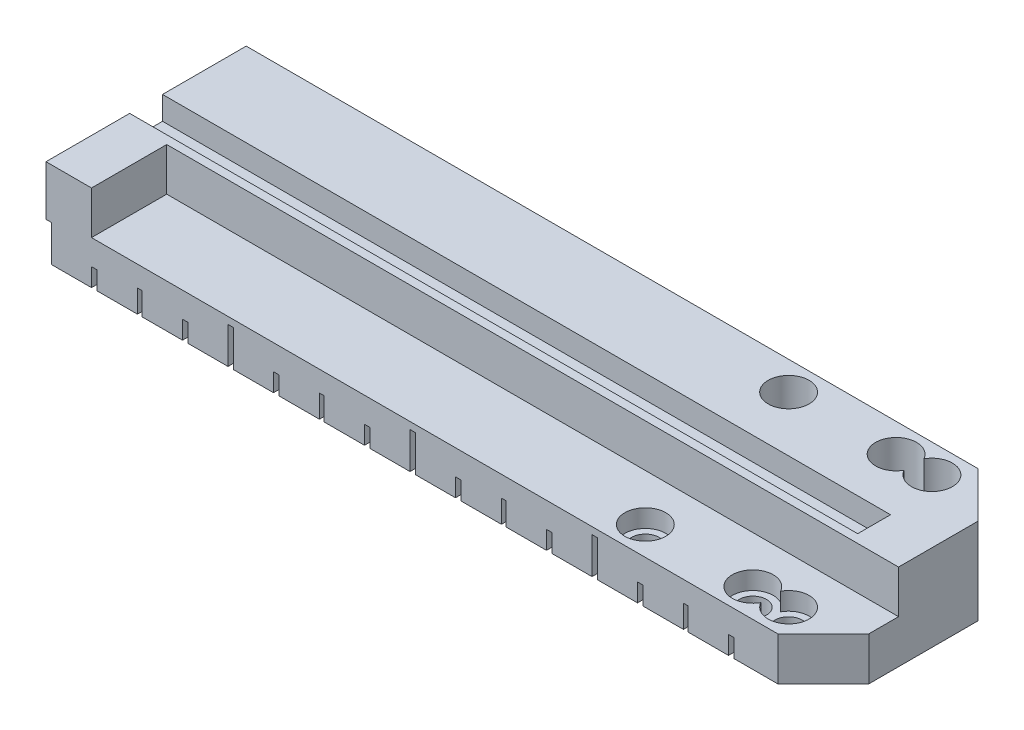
ISO-10303-21;
HEADER;
FILE_DESCRIPTION(('STEP AP214'),'2;1');
FILE_NAME('part.step','',(''),(''),'','','');
FILE_SCHEMA(('AUTOMOTIVE_DESIGN { 1 0 10303 214 1 1 1 1 }'));
ENDSEC;
DATA;
#1=APPLICATION_CONTEXT('core data for automotive mechanical design processes');
#2=APPLICATION_PROTOCOL_DEFINITION('international standard','automotive_design',2000,#1);
#3=PRODUCT_CONTEXT('',#1,'mechanical');
#4=PRODUCT('Part','Part','',(#3));
#5=PRODUCT_RELATED_PRODUCT_CATEGORY('part','',(#4));
#6=PRODUCT_DEFINITION_FORMATION('','',#4);
#7=PRODUCT_DEFINITION_CONTEXT('part definition',#1,'design');
#8=PRODUCT_DEFINITION('design','',#6,#7);
#9=PRODUCT_DEFINITION_SHAPE('','',#8);
#10=(LENGTH_UNIT() NAMED_UNIT(*) SI_UNIT(.MILLI.,.METRE.));
#11=(NAMED_UNIT(*) PLANE_ANGLE_UNIT() SI_UNIT($,.RADIAN.));
#12=(NAMED_UNIT(*) SI_UNIT($,.STERADIAN.) SOLID_ANGLE_UNIT());
#13=UNCERTAINTY_MEASURE_WITH_UNIT(LENGTH_MEASURE(1.E-05),#10,'distance_accuracy_value','');
#14=(GEOMETRIC_REPRESENTATION_CONTEXT(3) GLOBAL_UNCERTAINTY_ASSIGNED_CONTEXT((#13)) GLOBAL_UNIT_ASSIGNED_CONTEXT((#10,
#11,#12)) REPRESENTATION_CONTEXT('',''));
#15=CARTESIAN_POINT('',(0.,0.,0.));
#16=DIRECTION('',(0.,0.,1.));
#17=DIRECTION('',(1.,0.,0.));
#18=AXIS2_PLACEMENT_3D('',#15,#16,#17);
#19=CARTESIAN_POINT('',(0.,-8.08000000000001,0.));
#20=DIRECTION('',(0.,1.,0.));
#21=DIRECTION('',(0.,0.,1.));
#22=AXIS2_PLACEMENT_3D('',#19,#20,#21);
#23=PLANE('',#22);
#24=CARTESIAN_POINT('',(-98.1304,-8.08000000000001,10.));
#25=DIRECTION('',(0.,1.,0.));
#26=DIRECTION('',(0.,0.,1.));
#27=AXIS2_PLACEMENT_3D('',#24,#25,#26);
#28=CIRCLE('',#27,1.90500000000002);
#29=CARTESIAN_POINT('',(-98.1304,-8.08000000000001,11.905));
#30=VERTEX_POINT('',#29);
#31=EDGE_CURVE('E3898',#30,#30,#28,.T.);
#32=ORIENTED_EDGE('',*,*,#31,.T.);
#33=EDGE_LOOP('',(#32));
#34=FACE_BOUND('',#33,.T.);
#35=CARTESIAN_POINT('',(-98.1304,-8.08000000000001,-10.));
#36=DIRECTION('',(0.,1.,0.));
#37=DIRECTION('',(0.,0.,1.));
#38=AXIS2_PLACEMENT_3D('',#35,#36,#37);
#39=CIRCLE('',#38,1.90500000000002);
#40=CARTESIAN_POINT('',(-98.1304,-8.08000000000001,-8.09499999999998));
#41=VERTEX_POINT('',#40);
#42=EDGE_CURVE('E3886',#41,#41,#39,.T.);
#43=ORIENTED_EDGE('',*,*,#42,.T.);
#44=EDGE_LOOP('',(#43));
#45=FACE_BOUND('',#44,.T.);
#46=CARTESIAN_POINT('',(-83.1304,-8.08000000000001,-10.));
#47=DIRECTION('',(0.,-1.,0.));
#48=DIRECTION('',(0.,0.,-1.));
#49=AXIS2_PLACEMENT_3D('',#46,#47,#48);
#50=CIRCLE('',#49,1.90499999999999);
#51=CARTESIAN_POINT('',(-83.1304,-8.08000000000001,-11.905));
#52=VERTEX_POINT('',#51);
#53=EDGE_CURVE('E3883',#52,#52,#50,.T.);
#54=ORIENTED_EDGE('',*,*,#53,.F.);
#55=EDGE_LOOP('',(#54));
#56=FACE_BOUND('',#55,.T.);
#57=CARTESIAN_POINT('',(-83.1304,-8.08000000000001,10.));
#58=DIRECTION('',(0.,-1.,0.));
#59=DIRECTION('',(0.,0.,-1.));
#60=AXIS2_PLACEMENT_3D('',#57,#58,#59);
#61=CIRCLE('',#60,1.90499999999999);
#62=CARTESIAN_POINT('',(-83.1304,-8.08000000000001,8.09500000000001));
#63=VERTEX_POINT('',#62);
#64=EDGE_CURVE('E3877',#63,#63,#61,.T.);
#65=ORIENTED_EDGE('',*,*,#64,.F.);
#66=EDGE_LOOP('',(#65));
#67=FACE_BOUND('',#66,.T.);
#68=CARTESIAN_POINT('',(-78.1304,-8.08000000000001,10.));
#69=DIRECTION('',(0.,-1.,0.));
#70=DIRECTION('',(0.,0.,-1.));
#71=AXIS2_PLACEMENT_3D('',#68,#69,#70);
#72=CIRCLE('',#71,1.90499999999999);
#73=CARTESIAN_POINT('',(-78.1304,-8.08000000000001,8.09500000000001));
#74=VERTEX_POINT('',#73);
#75=EDGE_CURVE('E3864',#74,#74,#72,.T.);
#76=ORIENTED_EDGE('',*,*,#75,.F.);
#77=EDGE_LOOP('',(#76));
#78=FACE_BOUND('',#77,.T.);
#79=DIRECTION('',(0.,0.,-1.));
#80=VECTOR('',#79,1.);
#81=CARTESIAN_POINT('',(-69.3214002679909,-8.08000000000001,13.97));
#82=LINE('',#81,#80);
#83=CARTESIAN_POINT('',(-69.3214002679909,-8.08000000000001,7.61999999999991));
#84=VERTEX_POINT('',#83);
#85=CARTESIAN_POINT('',(-69.3214002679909,-8.08000000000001,-7.61999999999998));
#86=VERTEX_POINT('',#85);
#87=EDGE_CURVE('E1929',#84,#86,#82,.T.);
#88=ORIENTED_EDGE('',*,*,#87,.F.);
#89=DIRECTION('',(0.707106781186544,0.,-0.707106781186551));
#90=VECTOR('',#89,1.);
#91=CARTESIAN_POINT('',(-75.6714002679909,-8.08000000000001,13.97));
#92=LINE('',#91,#90);
#93=CARTESIAN_POINT('',(-75.6714002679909,-8.08000000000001,13.97));
#94=VERTEX_POINT('',#93);
#95=EDGE_CURVE('E1961',#84,#94,#92,.F.);
#96=ORIENTED_EDGE('',*,*,#95,.T.);
#97=DIRECTION('',(1.,0.,0.));
#98=VECTOR('',#97,1.);
#99=CARTESIAN_POINT('',(-177.8,-8.08000000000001,13.97));
#100=LINE('',#99,#98);
#101=CARTESIAN_POINT('',(-81.788,-8.08,13.97));
#102=VERTEX_POINT('',#101);
#103=EDGE_CURVE('E1925',#102,#94,#100,.T.);
#104=ORIENTED_EDGE('',*,*,#103,.F.);
#105=DIRECTION('',(0.,0.,1.));
#106=VECTOR('',#105,1.);
#107=CARTESIAN_POINT('',(-81.788,-8.08,13.208));
#108=LINE('',#107,#106);
#109=CARTESIAN_POINT('',(-81.788,-8.08,13.208));
#110=VERTEX_POINT('',#109);
#111=EDGE_CURVE('E1434',#110,#102,#108,.T.);
#112=ORIENTED_EDGE('',*,*,#111,.F.);
#113=DIRECTION('',(1.,0.,0.));
#114=VECTOR('',#113,1.);
#115=CARTESIAN_POINT('',(-82.55,-8.08000000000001,13.208));
#116=LINE('',#115,#114);
#117=CARTESIAN_POINT('',(-82.55,-8.08000000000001,13.208));
#118=VERTEX_POINT('',#117);
#119=EDGE_CURVE('E1422',#118,#110,#116,.T.);
#120=ORIENTED_EDGE('',*,*,#119,.F.);
#121=DIRECTION('',(0.,0.,1.));
#122=VECTOR('',#121,1.);
#123=CARTESIAN_POINT('',(-82.55,-8.08000000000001,13.208));
#124=LINE('',#123,#122);
#125=CARTESIAN_POINT('',(-82.55,-8.08000000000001,13.97));
#126=VERTEX_POINT('',#125);
#127=EDGE_CURVE('E1441',#118,#126,#124,.T.);
#128=ORIENTED_EDGE('',*,*,#127,.T.);
#129=CARTESIAN_POINT('',(-88.2015000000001,-8.08000000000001,13.97));
#130=VERTEX_POINT('',#129);
#131=EDGE_CURVE('E1977',#130,#126,#100,.T.);
#132=ORIENTED_EDGE('',*,*,#131,.F.);
#133=DIRECTION('',(0.,0.,1.));
#134=VECTOR('',#133,1.);
#135=CARTESIAN_POINT('',(-88.2015000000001,-8.08000000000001,13.208));
#136=LINE('',#135,#134);
#137=CARTESIAN_POINT('',(-88.2015000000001,-8.08000000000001,13.208));
#138=VERTEX_POINT('',#137);
#139=EDGE_CURVE('E1454',#138,#130,#136,.T.);
#140=ORIENTED_EDGE('',*,*,#139,.F.);
#141=DIRECTION('',(1.,0.,0.));
#142=VECTOR('',#141,1.);
#143=CARTESIAN_POINT('',(-88.8365000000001,-8.08000000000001,13.208));
#144=LINE('',#143,#142);
#145=CARTESIAN_POINT('',(-88.8365000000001,-8.08000000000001,13.208));
#146=VERTEX_POINT('',#145);
#147=EDGE_CURVE('E1466',#146,#138,#144,.T.);
#148=ORIENTED_EDGE('',*,*,#147,.F.);
#149=DIRECTION('',(0.,0.,-1.));
#150=VECTOR('',#149,1.);
#151=CARTESIAN_POINT('',(-88.8365000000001,-8.08000000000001,13.97));
#152=LINE('',#151,#150);
#153=CARTESIAN_POINT('',(-88.8365000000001,-8.08000000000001,13.97));
#154=VERTEX_POINT('',#153);
#155=EDGE_CURVE('E1444',#154,#146,#152,.T.);
#156=ORIENTED_EDGE('',*,*,#155,.F.);
#157=CARTESIAN_POINT('',(-94.488,-8.08000000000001,13.97));
#158=VERTEX_POINT('',#157);
#159=EDGE_CURVE('E2074',#158,#154,#100,.T.);
#160=ORIENTED_EDGE('',*,*,#159,.F.);
#161=DIRECTION('',(0.,0.,1.));
#162=VECTOR('',#161,1.);
#163=CARTESIAN_POINT('',(-94.488,-8.08000000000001,13.208));
#164=LINE('',#163,#162);
#165=CARTESIAN_POINT('',(-94.488,-8.08000000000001,13.208));
#166=VERTEX_POINT('',#165);
#167=EDGE_CURVE('E1483',#166,#158,#164,.T.);
#168=ORIENTED_EDGE('',*,*,#167,.F.);
#169=DIRECTION('',(1.,0.,0.));
#170=VECTOR('',#169,1.);
#171=CARTESIAN_POINT('',(-95.25,-8.08,13.208));
#172=LINE('',#171,#170);
#173=CARTESIAN_POINT('',(-95.25,-8.08,13.208));
#174=VERTEX_POINT('',#173);
#175=EDGE_CURVE('E1495',#174,#166,#172,.T.);
#176=ORIENTED_EDGE('',*,*,#175,.F.);
#177=DIRECTION('',(0.,0.,-1.));
#178=VECTOR('',#177,1.);
#179=CARTESIAN_POINT('',(-95.25,-8.08,13.97));
#180=LINE('',#179,#178);
#181=CARTESIAN_POINT('',(-95.25,-8.08000000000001,13.97));
#182=VERTEX_POINT('',#181);
#183=EDGE_CURVE('E1473',#182,#174,#180,.T.);
#184=ORIENTED_EDGE('',*,*,#183,.F.);
#185=CARTESIAN_POINT('',(-100.838,-8.08,13.97));
#186=VERTEX_POINT('',#185);
#187=EDGE_CURVE('E2070',#186,#182,#100,.T.);
#188=ORIENTED_EDGE('',*,*,#187,.F.);
#189=DIRECTION('',(0.,0.,1.));
#190=VECTOR('',#189,1.);
#191=CARTESIAN_POINT('',(-100.838,-8.08,13.208));
#192=LINE('',#191,#190);
#193=CARTESIAN_POINT('',(-100.838,-8.08,13.208));
#194=VERTEX_POINT('',#193);
#195=EDGE_CURVE('E1512',#194,#186,#192,.T.);
#196=ORIENTED_EDGE('',*,*,#195,.F.);
#197=DIRECTION('',(1.,0.,0.));
#198=VECTOR('',#197,1.);
#199=CARTESIAN_POINT('',(-101.6,-8.08,13.208));
#200=LINE('',#199,#198);
#201=CARTESIAN_POINT('',(-101.6,-8.08,13.208));
#202=VERTEX_POINT('',#201);
#203=EDGE_CURVE('E1524',#202,#194,#200,.T.);
#204=ORIENTED_EDGE('',*,*,#203,.F.);
#205=DIRECTION('',(0.,0.,-1.));
#206=VECTOR('',#205,1.);
#207=CARTESIAN_POINT('',(-101.6,-8.08,13.97));
#208=LINE('',#207,#206);
#209=CARTESIAN_POINT('',(-101.6,-8.08000000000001,13.97));
#210=VERTEX_POINT('',#209);
#211=EDGE_CURVE('E1502',#210,#202,#208,.T.);
#212=ORIENTED_EDGE('',*,*,#211,.F.);
#213=CARTESIAN_POINT('',(-107.188,-8.08,13.97));
#214=VERTEX_POINT('',#213);
#215=EDGE_CURVE('E2066',#214,#210,#100,.T.);
#216=ORIENTED_EDGE('',*,*,#215,.F.);
#217=DIRECTION('',(0.,0.,1.));
#218=VECTOR('',#217,1.);
#219=CARTESIAN_POINT('',(-107.188,-8.08,13.208));
#220=LINE('',#219,#218);
#221=CARTESIAN_POINT('',(-107.188,-8.08,13.208));
#222=VERTEX_POINT('',#221);
#223=EDGE_CURVE('E1541',#222,#214,#220,.T.);
#224=ORIENTED_EDGE('',*,*,#223,.F.);
#225=DIRECTION('',(1.,0.,0.));
#226=VECTOR('',#225,1.);
#227=CARTESIAN_POINT('',(-107.95,-8.08,13.208));
#228=LINE('',#227,#226);
#229=CARTESIAN_POINT('',(-107.95,-8.08,13.208));
#230=VERTEX_POINT('',#229);
#231=EDGE_CURVE('E1553',#230,#222,#228,.T.);
#232=ORIENTED_EDGE('',*,*,#231,.F.);
#233=DIRECTION('',(0.,0.,-1.));
#234=VECTOR('',#233,1.);
#235=CARTESIAN_POINT('',(-107.95,-8.08,13.97));
#236=LINE('',#235,#234);
#237=CARTESIAN_POINT('',(-107.95,-8.08000000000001,13.97));
#238=VERTEX_POINT('',#237);
#239=EDGE_CURVE('E1531',#238,#230,#236,.T.);
#240=ORIENTED_EDGE('',*,*,#239,.F.);
#241=CARTESIAN_POINT('',(-113.6015,-8.08,13.97));
#242=VERTEX_POINT('',#241);
#243=EDGE_CURVE('E2062',#242,#238,#100,.T.);
#244=ORIENTED_EDGE('',*,*,#243,.F.);
#245=DIRECTION('',(0.,0.,1.));
#246=VECTOR('',#245,1.);
#247=CARTESIAN_POINT('',(-113.6015,-8.08,13.208));
#248=LINE('',#247,#246);
#249=CARTESIAN_POINT('',(-113.6015,-8.08,13.208));
#250=VERTEX_POINT('',#249);
#251=EDGE_CURVE('E1570',#250,#242,#248,.T.);
#252=ORIENTED_EDGE('',*,*,#251,.F.);
#253=DIRECTION('',(1.,0.,0.));
#254=VECTOR('',#253,1.);
#255=CARTESIAN_POINT('',(-114.2365,-8.08,13.208));
#256=LINE('',#255,#254);
#257=CARTESIAN_POINT('',(-114.2365,-8.08,13.208));
#258=VERTEX_POINT('',#257);
#259=EDGE_CURVE('E1582',#258,#250,#256,.T.);
#260=ORIENTED_EDGE('',*,*,#259,.F.);
#261=DIRECTION('',(0.,0.,-1.));
#262=VECTOR('',#261,1.);
#263=CARTESIAN_POINT('',(-114.2365,-8.08,13.97));
#264=LINE('',#263,#262);
#265=CARTESIAN_POINT('',(-114.2365,-8.08000000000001,13.97));
#266=VERTEX_POINT('',#265);
#267=EDGE_CURVE('E1560',#266,#258,#264,.T.);
#268=ORIENTED_EDGE('',*,*,#267,.F.);
#269=CARTESIAN_POINT('',(-119.888,-8.08,13.97));
#270=VERTEX_POINT('',#269);
#271=EDGE_CURVE('E2058',#270,#266,#100,.T.);
#272=ORIENTED_EDGE('',*,*,#271,.F.);
#273=DIRECTION('',(0.,0.,1.));
#274=VECTOR('',#273,1.);
#275=CARTESIAN_POINT('',(-119.888,-8.08,13.208));
#276=LINE('',#275,#274);
#277=CARTESIAN_POINT('',(-119.888,-8.08,13.208));
#278=VERTEX_POINT('',#277);
#279=EDGE_CURVE('E1599',#278,#270,#276,.T.);
#280=ORIENTED_EDGE('',*,*,#279,.F.);
#281=DIRECTION('',(1.,0.,0.));
#282=VECTOR('',#281,1.);
#283=CARTESIAN_POINT('',(-120.65,-8.08,13.208));
#284=LINE('',#283,#282);
#285=CARTESIAN_POINT('',(-120.65,-8.08,13.208));
#286=VERTEX_POINT('',#285);
#287=EDGE_CURVE('E1611',#286,#278,#284,.T.);
#288=ORIENTED_EDGE('',*,*,#287,.F.);
#289=DIRECTION('',(0.,0.,-1.));
#290=VECTOR('',#289,1.);
#291=CARTESIAN_POINT('',(-120.65,-8.08,13.97));
#292=LINE('',#291,#290);
#293=CARTESIAN_POINT('',(-120.65,-8.08000000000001,13.97));
#294=VERTEX_POINT('',#293);
#295=EDGE_CURVE('E1589',#294,#286,#292,.T.);
#296=ORIENTED_EDGE('',*,*,#295,.F.);
#297=CARTESIAN_POINT('',(-126.238,-8.08,13.97));
#298=VERTEX_POINT('',#297);
#299=EDGE_CURVE('E2054',#298,#294,#100,.T.);
#300=ORIENTED_EDGE('',*,*,#299,.F.);
#301=DIRECTION('',(0.,0.,1.));
#302=VECTOR('',#301,1.);
#303=CARTESIAN_POINT('',(-126.238,-8.08,13.208));
#304=LINE('',#303,#302);
#305=CARTESIAN_POINT('',(-126.238,-8.08,13.208));
#306=VERTEX_POINT('',#305);
#307=EDGE_CURVE('E1628',#306,#298,#304,.T.);
#308=ORIENTED_EDGE('',*,*,#307,.F.);
#309=DIRECTION('',(1.,0.,0.));
#310=VECTOR('',#309,1.);
#311=CARTESIAN_POINT('',(-127.,-8.08,13.208));
#312=LINE('',#311,#310);
#313=CARTESIAN_POINT('',(-127.,-8.08,13.208));
#314=VERTEX_POINT('',#313);
#315=EDGE_CURVE('E1640',#314,#306,#312,.T.);
#316=ORIENTED_EDGE('',*,*,#315,.F.);
#317=DIRECTION('',(0.,0.,-1.));
#318=VECTOR('',#317,1.);
#319=CARTESIAN_POINT('',(-127.,-8.08,13.97));
#320=LINE('',#319,#318);
#321=CARTESIAN_POINT('',(-127.,-8.08000000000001,13.97));
#322=VERTEX_POINT('',#321);
#323=EDGE_CURVE('E1618',#322,#314,#320,.T.);
#324=ORIENTED_EDGE('',*,*,#323,.F.);
#325=CARTESIAN_POINT('',(-132.588,-8.08,13.97));
#326=VERTEX_POINT('',#325);
#327=EDGE_CURVE('E2050',#326,#322,#100,.T.);
#328=ORIENTED_EDGE('',*,*,#327,.F.);
#329=DIRECTION('',(0.,0.,1.));
#330=VECTOR('',#329,1.);
#331=CARTESIAN_POINT('',(-132.588,-8.08,13.208));
#332=LINE('',#331,#330);
#333=CARTESIAN_POINT('',(-132.588,-8.08,13.208));
#334=VERTEX_POINT('',#333);
#335=EDGE_CURVE('E1657',#334,#326,#332,.T.);
#336=ORIENTED_EDGE('',*,*,#335,.F.);
#337=DIRECTION('',(1.,0.,0.));
#338=VECTOR('',#337,1.);
#339=CARTESIAN_POINT('',(-133.35,-8.08,13.208));
#340=LINE('',#339,#338);
#341=CARTESIAN_POINT('',(-133.35,-8.08,13.208));
#342=VERTEX_POINT('',#341);
#343=EDGE_CURVE('E1669',#342,#334,#340,.T.);
#344=ORIENTED_EDGE('',*,*,#343,.F.);
#345=DIRECTION('',(0.,0.,-1.));
#346=VECTOR('',#345,1.);
#347=CARTESIAN_POINT('',(-133.35,-8.08,13.97));
#348=LINE('',#347,#346);
#349=CARTESIAN_POINT('',(-133.35,-8.08000000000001,13.97));
#350=VERTEX_POINT('',#349);
#351=EDGE_CURVE('E1647',#350,#342,#348,.T.);
#352=ORIENTED_EDGE('',*,*,#351,.F.);
#353=CARTESIAN_POINT('',(-139.0015,-8.08,13.97));
#354=VERTEX_POINT('',#353);
#355=EDGE_CURVE('E2046',#354,#350,#100,.T.);
#356=ORIENTED_EDGE('',*,*,#355,.F.);
#357=DIRECTION('',(0.,0.,1.));
#358=VECTOR('',#357,1.);
#359=CARTESIAN_POINT('',(-139.0015,-8.08,13.208));
#360=LINE('',#359,#358);
#361=CARTESIAN_POINT('',(-139.0015,-8.08,13.208));
#362=VERTEX_POINT('',#361);
#363=EDGE_CURVE('E1686',#362,#354,#360,.T.);
#364=ORIENTED_EDGE('',*,*,#363,.F.);
#365=DIRECTION('',(1.,0.,0.));
#366=VECTOR('',#365,1.);
#367=CARTESIAN_POINT('',(-139.6365,-8.08,13.208));
#368=LINE('',#367,#366);
#369=CARTESIAN_POINT('',(-139.6365,-8.08,13.208));
#370=VERTEX_POINT('',#369);
#371=EDGE_CURVE('E1698',#370,#362,#368,.T.);
#372=ORIENTED_EDGE('',*,*,#371,.F.);
#373=DIRECTION('',(0.,0.,-1.));
#374=VECTOR('',#373,1.);
#375=CARTESIAN_POINT('',(-139.6365,-8.08,13.97));
#376=LINE('',#375,#374);
#377=CARTESIAN_POINT('',(-139.6365,-8.08000000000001,13.97));
#378=VERTEX_POINT('',#377);
#379=EDGE_CURVE('E1676',#378,#370,#376,.T.);
#380=ORIENTED_EDGE('',*,*,#379,.F.);
#381=CARTESIAN_POINT('',(-145.288,-8.08,13.97));
#382=VERTEX_POINT('',#381);
#383=EDGE_CURVE('E2042',#382,#378,#100,.T.);
#384=ORIENTED_EDGE('',*,*,#383,.F.);
#385=DIRECTION('',(0.,0.,1.));
#386=VECTOR('',#385,1.);
#387=CARTESIAN_POINT('',(-145.288,-8.08,13.208));
#388=LINE('',#387,#386);
#389=CARTESIAN_POINT('',(-145.288,-8.08,13.208));
#390=VERTEX_POINT('',#389);
#391=EDGE_CURVE('E1715',#390,#382,#388,.T.);
#392=ORIENTED_EDGE('',*,*,#391,.F.);
#393=DIRECTION('',(1.,0.,0.));
#394=VECTOR('',#393,1.);
#395=CARTESIAN_POINT('',(-146.05,-8.08,13.208));
#396=LINE('',#395,#394);
#397=CARTESIAN_POINT('',(-146.05,-8.08,13.208));
#398=VERTEX_POINT('',#397);
#399=EDGE_CURVE('E1727',#398,#390,#396,.T.);
#400=ORIENTED_EDGE('',*,*,#399,.F.);
#401=DIRECTION('',(0.,0.,-1.));
#402=VECTOR('',#401,1.);
#403=CARTESIAN_POINT('',(-146.05,-8.08,13.97));
#404=LINE('',#403,#402);
#405=CARTESIAN_POINT('',(-146.05,-8.08000000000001,13.97));
#406=VERTEX_POINT('',#405);
#407=EDGE_CURVE('E1705',#406,#398,#404,.T.);
#408=ORIENTED_EDGE('',*,*,#407,.F.);
#409=CARTESIAN_POINT('',(-151.638,-8.08,13.97));
#410=VERTEX_POINT('',#409);
#411=EDGE_CURVE('E2038',#410,#406,#100,.T.);
#412=ORIENTED_EDGE('',*,*,#411,.F.);
#413=DIRECTION('',(0.,0.,1.));
#414=VECTOR('',#413,1.);
#415=CARTESIAN_POINT('',(-151.638,-8.08,13.208));
#416=LINE('',#415,#414);
#417=CARTESIAN_POINT('',(-151.638,-8.08,13.208));
#418=VERTEX_POINT('',#417);
#419=EDGE_CURVE('E1744',#418,#410,#416,.T.);
#420=ORIENTED_EDGE('',*,*,#419,.F.);
#421=DIRECTION('',(1.,0.,0.));
#422=VECTOR('',#421,1.);
#423=CARTESIAN_POINT('',(-152.4,-8.08,13.208));
#424=LINE('',#423,#422);
#425=CARTESIAN_POINT('',(-152.4,-8.08,13.208));
#426=VERTEX_POINT('',#425);
#427=EDGE_CURVE('E1756',#426,#418,#424,.T.);
#428=ORIENTED_EDGE('',*,*,#427,.F.);
#429=DIRECTION('',(0.,0.,-1.));
#430=VECTOR('',#429,1.);
#431=CARTESIAN_POINT('',(-152.4,-8.08,13.97));
#432=LINE('',#431,#430);
#433=CARTESIAN_POINT('',(-152.4,-8.08000000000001,13.97));
#434=VERTEX_POINT('',#433);
#435=EDGE_CURVE('E1734',#434,#426,#432,.T.);
#436=ORIENTED_EDGE('',*,*,#435,.F.);
#437=CARTESIAN_POINT('',(-157.988,-8.08,13.97));
#438=VERTEX_POINT('',#437);
#439=EDGE_CURVE('E2034',#438,#434,#100,.T.);
#440=ORIENTED_EDGE('',*,*,#439,.F.);
#441=DIRECTION('',(0.,0.,1.));
#442=VECTOR('',#441,1.);
#443=CARTESIAN_POINT('',(-157.988,-8.08,13.208));
#444=LINE('',#443,#442);
#445=CARTESIAN_POINT('',(-157.988,-8.08,13.208));
#446=VERTEX_POINT('',#445);
#447=EDGE_CURVE('E1773',#446,#438,#444,.T.);
#448=ORIENTED_EDGE('',*,*,#447,.F.);
#449=DIRECTION('',(1.,0.,0.));
#450=VECTOR('',#449,1.);
#451=CARTESIAN_POINT('',(-158.75,-8.08,13.208));
#452=LINE('',#451,#450);
#453=CARTESIAN_POINT('',(-158.75,-8.08,13.208));
#454=VERTEX_POINT('',#453);
#455=EDGE_CURVE('E1785',#454,#446,#452,.T.);
#456=ORIENTED_EDGE('',*,*,#455,.F.);
#457=DIRECTION('',(0.,0.,-1.));
#458=VECTOR('',#457,1.);
#459=CARTESIAN_POINT('',(-158.75,-8.08,13.97));
#460=LINE('',#459,#458);
#461=CARTESIAN_POINT('',(-158.75,-8.08000000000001,13.97));
#462=VERTEX_POINT('',#461);
#463=EDGE_CURVE('E1763',#462,#454,#460,.T.);
#464=ORIENTED_EDGE('',*,*,#463,.F.);
#465=CARTESIAN_POINT('',(-164.4015,-8.08,13.97));
#466=VERTEX_POINT('',#465);
#467=EDGE_CURVE('E2032',#466,#462,#100,.T.);
#468=ORIENTED_EDGE('',*,*,#467,.F.);
#469=DIRECTION('',(0.,0.,1.));
#470=VECTOR('',#469,1.);
#471=CARTESIAN_POINT('',(-164.4015,-8.08,13.208));
#472=LINE('',#471,#470);
#473=CARTESIAN_POINT('',(-164.4015,-8.08,13.208));
#474=VERTEX_POINT('',#473);
#475=EDGE_CURVE('E1802',#474,#466,#472,.T.);
#476=ORIENTED_EDGE('',*,*,#475,.F.);
#477=DIRECTION('',(1.,0.,0.));
#478=VECTOR('',#477,1.);
#479=CARTESIAN_POINT('',(-165.0365,-8.08,13.208));
#480=LINE('',#479,#478);
#481=CARTESIAN_POINT('',(-165.0365,-8.08,13.208));
#482=VERTEX_POINT('',#481);
#483=EDGE_CURVE('E1814',#482,#474,#480,.T.);
#484=ORIENTED_EDGE('',*,*,#483,.F.);
#485=DIRECTION('',(0.,0.,-1.));
#486=VECTOR('',#485,1.);
#487=CARTESIAN_POINT('',(-165.0365,-8.08,13.97));
#488=LINE('',#487,#486);
#489=CARTESIAN_POINT('',(-165.0365,-8.08000000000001,13.97));
#490=VERTEX_POINT('',#489);
#491=EDGE_CURVE('E1792',#490,#482,#488,.T.);
#492=ORIENTED_EDGE('',*,*,#491,.F.);
#493=CARTESIAN_POINT('',(-170.688,-8.08,13.97));
#494=VERTEX_POINT('',#493);
#495=EDGE_CURVE('E1930',#494,#490,#100,.T.);
#496=ORIENTED_EDGE('',*,*,#495,.F.);
#497=DIRECTION('',(0.,0.,1.));
#498=VECTOR('',#497,1.);
#499=CARTESIAN_POINT('',(-170.688,-8.08,13.208));
#500=LINE('',#499,#498);
#501=CARTESIAN_POINT('',(-170.688,-8.08,13.208));
#502=VERTEX_POINT('',#501);
#503=EDGE_CURVE('E1831',#502,#494,#500,.T.);
#504=ORIENTED_EDGE('',*,*,#503,.F.);
#505=DIRECTION('',(1.,0.,0.));
#506=VECTOR('',#505,1.);
#507=CARTESIAN_POINT('',(-171.45,-8.08,13.208));
#508=LINE('',#507,#506);
#509=CARTESIAN_POINT('',(-171.45,-8.08,13.208));
#510=VERTEX_POINT('',#509);
#511=EDGE_CURVE('E1843',#510,#502,#508,.T.);
#512=ORIENTED_EDGE('',*,*,#511,.F.);
#513=DIRECTION('',(0.,0.,-1.));
#514=VECTOR('',#513,1.);
#515=CARTESIAN_POINT('',(-171.45,-8.08,13.97));
#516=LINE('',#515,#514);
#517=CARTESIAN_POINT('',(-171.45,-8.08000000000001,13.97));
#518=VERTEX_POINT('',#517);
#519=EDGE_CURVE('E1821',#518,#510,#516,.T.);
#520=ORIENTED_EDGE('',*,*,#519,.F.);
#521=CARTESIAN_POINT('',(-177.038,-8.08,13.97));
#522=VERTEX_POINT('',#521);
#523=EDGE_CURVE('E1926',#522,#518,#100,.T.);
#524=ORIENTED_EDGE('',*,*,#523,.F.);
#525=DIRECTION('',(0.,0.,1.));
#526=VECTOR('',#525,1.);
#527=CARTESIAN_POINT('',(-177.038,-8.08,13.208));
#528=LINE('',#527,#526);
#529=CARTESIAN_POINT('',(-177.038,-8.08,13.208));
#530=VERTEX_POINT('',#529);
#531=EDGE_CURVE('E1869',#530,#522,#528,.T.);
#532=ORIENTED_EDGE('',*,*,#531,.F.);
#533=DIRECTION('',(1.,0.,0.));
#534=VECTOR('',#533,1.);
#535=CARTESIAN_POINT('',(-177.8,-8.08,13.208));
#536=LINE('',#535,#534);
#537=CARTESIAN_POINT('',(-177.8,-8.08000000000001,13.208));
#538=VERTEX_POINT('',#537);
#539=EDGE_CURVE('E1859',#538,#530,#536,.T.);
#540=ORIENTED_EDGE('',*,*,#539,.F.);
#541=DIRECTION('',(0.,0.,1.));
#542=VECTOR('',#541,1.);
#543=CARTESIAN_POINT('',(-177.8,-8.08000000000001,-13.97));
#544=LINE('',#543,#542);
#545=CARTESIAN_POINT('',(-177.8,-8.08,-13.208));
#546=VERTEX_POINT('',#545);
#547=EDGE_CURVE('E1921',#546,#538,#544,.T.);
#548=ORIENTED_EDGE('',*,*,#547,.F.);
#549=DIRECTION('',(-1.,0.,0.));
#550=VECTOR('',#549,1.);
#551=CARTESIAN_POINT('',(-177.038,-8.08,-13.208));
#552=LINE('',#551,#550);
#553=CARTESIAN_POINT('',(-177.038,-8.08,-13.208));
#554=VERTEX_POINT('',#553);
#555=EDGE_CURVE('E967',#554,#546,#552,.T.);
#556=ORIENTED_EDGE('',*,*,#555,.F.);
#557=DIRECTION('',(0.,0.,1.));
#558=VECTOR('',#557,1.);
#559=CARTESIAN_POINT('',(-177.038,-8.08,-13.97));
#560=LINE('',#559,#558);
#561=CARTESIAN_POINT('',(-177.038,-8.08000000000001,-13.97));
#562=VERTEX_POINT('',#561);
#563=EDGE_CURVE('E957',#562,#554,#560,.T.);
#564=ORIENTED_EDGE('',*,*,#563,.F.);
#565=DIRECTION('',(-1.,0.,0.));
#566=VECTOR('',#565,1.);
#567=CARTESIAN_POINT('',(-69.3214002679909,-8.08000000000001,-13.97));
#568=LINE('',#567,#566);
#569=CARTESIAN_POINT('',(-171.45,-8.08,-13.97));
#570=VERTEX_POINT('',#569);
#571=EDGE_CURVE('E1923',#570,#562,#568,.T.);
#572=ORIENTED_EDGE('',*,*,#571,.F.);
#573=DIRECTION('',(0.,0.,-1.));
#574=VECTOR('',#573,1.);
#575=CARTESIAN_POINT('',(-171.45,-8.08,-13.208));
#576=LINE('',#575,#574);
#577=CARTESIAN_POINT('',(-171.45,-8.08,-13.208));
#578=VERTEX_POINT('',#577);
#579=EDGE_CURVE('E990',#578,#570,#576,.T.);
#580=ORIENTED_EDGE('',*,*,#579,.F.);
#581=DIRECTION('',(-1.,0.,0.));
#582=VECTOR('',#581,1.);
#583=CARTESIAN_POINT('',(-170.688,-8.08,-13.208));
#584=LINE('',#583,#582);
#585=CARTESIAN_POINT('',(-170.688,-8.08,-13.208));
#586=VERTEX_POINT('',#585);
#587=EDGE_CURVE('E1002',#586,#578,#584,.T.);
#588=ORIENTED_EDGE('',*,*,#587,.F.);
#589=DIRECTION('',(0.,0.,1.));
#590=VECTOR('',#589,1.);
#591=CARTESIAN_POINT('',(-170.688,-8.08,-13.97));
#592=LINE('',#591,#590);
#593=CARTESIAN_POINT('',(-170.688,-8.08000000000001,-13.97));
#594=VERTEX_POINT('',#593);
#595=EDGE_CURVE('E982',#594,#586,#592,.T.);
#596=ORIENTED_EDGE('',*,*,#595,.F.);
#597=CARTESIAN_POINT('',(-165.0365,-8.08,-13.97));
#598=VERTEX_POINT('',#597);
#599=EDGE_CURVE('E2485',#598,#594,#568,.T.);
#600=ORIENTED_EDGE('',*,*,#599,.F.);
#601=DIRECTION('',(0.,0.,-1.));
#602=VECTOR('',#601,1.);
#603=CARTESIAN_POINT('',(-165.0365,-8.08,-13.208));
#604=LINE('',#603,#602);
#605=CARTESIAN_POINT('',(-165.0365,-8.08,-13.208));
#606=VERTEX_POINT('',#605);
#607=EDGE_CURVE('E1019',#606,#598,#604,.T.);
#608=ORIENTED_EDGE('',*,*,#607,.F.);
#609=DIRECTION('',(-1.,0.,0.));
#610=VECTOR('',#609,1.);
#611=CARTESIAN_POINT('',(-164.4015,-8.08,-13.208));
#612=LINE('',#611,#610);
#613=CARTESIAN_POINT('',(-164.4015,-8.08,-13.208));
#614=VERTEX_POINT('',#613);
#615=EDGE_CURVE('E1031',#614,#606,#612,.T.);
#616=ORIENTED_EDGE('',*,*,#615,.F.);
#617=DIRECTION('',(0.,0.,1.));
#618=VECTOR('',#617,1.);
#619=CARTESIAN_POINT('',(-164.4015,-8.08,-13.97));
#620=LINE('',#619,#618);
#621=CARTESIAN_POINT('',(-164.4015,-8.08000000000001,-13.97));
#622=VERTEX_POINT('',#621);
#623=EDGE_CURVE('E1009',#622,#614,#620,.T.);
#624=ORIENTED_EDGE('',*,*,#623,.F.);
#625=CARTESIAN_POINT('',(-158.75,-8.08,-13.97));
#626=VERTEX_POINT('',#625);
#627=EDGE_CURVE('E2487',#626,#622,#568,.T.);
#628=ORIENTED_EDGE('',*,*,#627,.F.);
#629=DIRECTION('',(0.,0.,-1.));
#630=VECTOR('',#629,1.);
#631=CARTESIAN_POINT('',(-158.75,-8.08,-13.208));
#632=LINE('',#631,#630);
#633=CARTESIAN_POINT('',(-158.75,-8.08,-13.208));
#634=VERTEX_POINT('',#633);
#635=EDGE_CURVE('E1048',#634,#626,#632,.T.);
#636=ORIENTED_EDGE('',*,*,#635,.F.);
#637=DIRECTION('',(-1.,0.,0.));
#638=VECTOR('',#637,1.);
#639=CARTESIAN_POINT('',(-157.988,-8.08,-13.208));
#640=LINE('',#639,#638);
#641=CARTESIAN_POINT('',(-157.988,-8.08,-13.208));
#642=VERTEX_POINT('',#641);
#643=EDGE_CURVE('E1060',#642,#634,#640,.T.);
#644=ORIENTED_EDGE('',*,*,#643,.F.);
#645=DIRECTION('',(0.,0.,1.));
#646=VECTOR('',#645,1.);
#647=CARTESIAN_POINT('',(-157.988,-8.08,-13.97));
#648=LINE('',#647,#646);
#649=CARTESIAN_POINT('',(-157.988,-8.08000000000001,-13.97));
#650=VERTEX_POINT('',#649);
#651=EDGE_CURVE('E1038',#650,#642,#648,.T.);
#652=ORIENTED_EDGE('',*,*,#651,.F.);
#653=CARTESIAN_POINT('',(-152.4,-8.08,-13.97));
#654=VERTEX_POINT('',#653);
#655=EDGE_CURVE('E2491',#654,#650,#568,.T.);
#656=ORIENTED_EDGE('',*,*,#655,.F.);
#657=DIRECTION('',(0.,0.,-1.));
#658=VECTOR('',#657,1.);
#659=CARTESIAN_POINT('',(-152.4,-8.08,-13.208));
#660=LINE('',#659,#658);
#661=CARTESIAN_POINT('',(-152.4,-8.08,-13.208));
#662=VERTEX_POINT('',#661);
#663=EDGE_CURVE('E1077',#662,#654,#660,.T.);
#664=ORIENTED_EDGE('',*,*,#663,.F.);
#665=DIRECTION('',(-1.,0.,0.));
#666=VECTOR('',#665,1.);
#667=CARTESIAN_POINT('',(-151.638,-8.08,-13.208));
#668=LINE('',#667,#666);
#669=CARTESIAN_POINT('',(-151.638,-8.08,-13.208));
#670=VERTEX_POINT('',#669);
#671=EDGE_CURVE('E1089',#670,#662,#668,.T.);
#672=ORIENTED_EDGE('',*,*,#671,.F.);
#673=DIRECTION('',(0.,0.,1.));
#674=VECTOR('',#673,1.);
#675=CARTESIAN_POINT('',(-151.638,-8.08,-13.97));
#676=LINE('',#675,#674);
#677=CARTESIAN_POINT('',(-151.638,-8.08000000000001,-13.97));
#678=VERTEX_POINT('',#677);
#679=EDGE_CURVE('E1067',#678,#670,#676,.T.);
#680=ORIENTED_EDGE('',*,*,#679,.F.);
#681=CARTESIAN_POINT('',(-146.05,-8.08,-13.97));
#682=VERTEX_POINT('',#681);
#683=EDGE_CURVE('E2495',#682,#678,#568,.T.);
#684=ORIENTED_EDGE('',*,*,#683,.F.);
#685=DIRECTION('',(0.,0.,-1.));
#686=VECTOR('',#685,1.);
#687=CARTESIAN_POINT('',(-146.05,-8.08,-13.208));
#688=LINE('',#687,#686);
#689=CARTESIAN_POINT('',(-146.05,-8.08,-13.208));
#690=VERTEX_POINT('',#689);
#691=EDGE_CURVE('E1106',#690,#682,#688,.T.);
#692=ORIENTED_EDGE('',*,*,#691,.F.);
#693=DIRECTION('',(-1.,0.,0.));
#694=VECTOR('',#693,1.);
#695=CARTESIAN_POINT('',(-145.288,-8.08,-13.208));
#696=LINE('',#695,#694);
#697=CARTESIAN_POINT('',(-145.288,-8.08,-13.208));
#698=VERTEX_POINT('',#697);
#699=EDGE_CURVE('E1118',#698,#690,#696,.T.);
#700=ORIENTED_EDGE('',*,*,#699,.F.);
#701=DIRECTION('',(0.,0.,1.));
#702=VECTOR('',#701,1.);
#703=CARTESIAN_POINT('',(-145.288,-8.08,-13.97));
#704=LINE('',#703,#702);
#705=CARTESIAN_POINT('',(-145.288,-8.08000000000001,-13.97));
#706=VERTEX_POINT('',#705);
#707=EDGE_CURVE('E1096',#706,#698,#704,.T.);
#708=ORIENTED_EDGE('',*,*,#707,.F.);
#709=CARTESIAN_POINT('',(-139.6365,-8.08,-13.97));
#710=VERTEX_POINT('',#709);
#711=EDGE_CURVE('E2499',#710,#706,#568,.T.);
#712=ORIENTED_EDGE('',*,*,#711,.F.);
#713=DIRECTION('',(0.,0.,-1.));
#714=VECTOR('',#713,1.);
#715=CARTESIAN_POINT('',(-139.6365,-8.08,-13.208));
#716=LINE('',#715,#714);
#717=CARTESIAN_POINT('',(-139.6365,-8.08,-13.208));
#718=VERTEX_POINT('',#717);
#719=EDGE_CURVE('E1135',#718,#710,#716,.T.);
#720=ORIENTED_EDGE('',*,*,#719,.F.);
#721=DIRECTION('',(-1.,0.,0.));
#722=VECTOR('',#721,1.);
#723=CARTESIAN_POINT('',(-139.0015,-8.08,-13.208));
#724=LINE('',#723,#722);
#725=CARTESIAN_POINT('',(-139.0015,-8.08,-13.208));
#726=VERTEX_POINT('',#725);
#727=EDGE_CURVE('E1147',#726,#718,#724,.T.);
#728=ORIENTED_EDGE('',*,*,#727,.F.);
#729=DIRECTION('',(0.,0.,1.));
#730=VECTOR('',#729,1.);
#731=CARTESIAN_POINT('',(-139.0015,-8.08,-13.97));
#732=LINE('',#731,#730);
#733=CARTESIAN_POINT('',(-139.0015,-8.08000000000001,-13.97));
#734=VERTEX_POINT('',#733);
#735=EDGE_CURVE('E1125',#734,#726,#732,.T.);
#736=ORIENTED_EDGE('',*,*,#735,.F.);
#737=CARTESIAN_POINT('',(-133.35,-8.08,-13.97));
#738=VERTEX_POINT('',#737);
#739=EDGE_CURVE('E2503',#738,#734,#568,.T.);
#740=ORIENTED_EDGE('',*,*,#739,.F.);
#741=DIRECTION('',(0.,0.,-1.));
#742=VECTOR('',#741,1.);
#743=CARTESIAN_POINT('',(-133.35,-8.08,-13.208));
#744=LINE('',#743,#742);
#745=CARTESIAN_POINT('',(-133.35,-8.08,-13.208));
#746=VERTEX_POINT('',#745);
#747=EDGE_CURVE('E1164',#746,#738,#744,.T.);
#748=ORIENTED_EDGE('',*,*,#747,.F.);
#749=DIRECTION('',(-1.,0.,0.));
#750=VECTOR('',#749,1.);
#751=CARTESIAN_POINT('',(-132.588,-8.08,-13.208));
#752=LINE('',#751,#750);
#753=CARTESIAN_POINT('',(-132.588,-8.08,-13.208));
#754=VERTEX_POINT('',#753);
#755=EDGE_CURVE('E1176',#754,#746,#752,.T.);
#756=ORIENTED_EDGE('',*,*,#755,.F.);
#757=DIRECTION('',(0.,0.,1.));
#758=VECTOR('',#757,1.);
#759=CARTESIAN_POINT('',(-132.588,-8.08,-13.97));
#760=LINE('',#759,#758);
#761=CARTESIAN_POINT('',(-132.588,-8.08000000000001,-13.97));
#762=VERTEX_POINT('',#761);
#763=EDGE_CURVE('E1154',#762,#754,#760,.T.);
#764=ORIENTED_EDGE('',*,*,#763,.F.);
#765=CARTESIAN_POINT('',(-127.,-8.08,-13.97));
#766=VERTEX_POINT('',#765);
#767=EDGE_CURVE('E2507',#766,#762,#568,.T.);
#768=ORIENTED_EDGE('',*,*,#767,.F.);
#769=DIRECTION('',(0.,0.,-1.));
#770=VECTOR('',#769,1.);
#771=CARTESIAN_POINT('',(-127.,-8.08,-13.208));
#772=LINE('',#771,#770);
#773=CARTESIAN_POINT('',(-127.,-8.08,-13.208));
#774=VERTEX_POINT('',#773);
#775=EDGE_CURVE('E1193',#774,#766,#772,.T.);
#776=ORIENTED_EDGE('',*,*,#775,.F.);
#777=DIRECTION('',(-1.,0.,0.));
#778=VECTOR('',#777,1.);
#779=CARTESIAN_POINT('',(-126.238,-8.08,-13.208));
#780=LINE('',#779,#778);
#781=CARTESIAN_POINT('',(-126.238,-8.08,-13.208));
#782=VERTEX_POINT('',#781);
#783=EDGE_CURVE('E1205',#782,#774,#780,.T.);
#784=ORIENTED_EDGE('',*,*,#783,.F.);
#785=DIRECTION('',(0.,0.,1.));
#786=VECTOR('',#785,1.);
#787=CARTESIAN_POINT('',(-126.238,-8.08,-13.97));
#788=LINE('',#787,#786);
#789=CARTESIAN_POINT('',(-126.238,-8.08000000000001,-13.97));
#790=VERTEX_POINT('',#789);
#791=EDGE_CURVE('E1183',#790,#782,#788,.T.);
#792=ORIENTED_EDGE('',*,*,#791,.F.);
#793=CARTESIAN_POINT('',(-120.65,-8.08,-13.97));
#794=VERTEX_POINT('',#793);
#795=EDGE_CURVE('E2511',#794,#790,#568,.T.);
#796=ORIENTED_EDGE('',*,*,#795,.F.);
#797=DIRECTION('',(0.,0.,-1.));
#798=VECTOR('',#797,1.);
#799=CARTESIAN_POINT('',(-120.65,-8.08,-13.208));
#800=LINE('',#799,#798);
#801=CARTESIAN_POINT('',(-120.65,-8.08,-13.208));
#802=VERTEX_POINT('',#801);
#803=EDGE_CURVE('E1222',#802,#794,#800,.T.);
#804=ORIENTED_EDGE('',*,*,#803,.F.);
#805=DIRECTION('',(-1.,0.,0.));
#806=VECTOR('',#805,1.);
#807=CARTESIAN_POINT('',(-119.888,-8.08,-13.208));
#808=LINE('',#807,#806);
#809=CARTESIAN_POINT('',(-119.888,-8.08,-13.208));
#810=VERTEX_POINT('',#809);
#811=EDGE_CURVE('E1234',#810,#802,#808,.T.);
#812=ORIENTED_EDGE('',*,*,#811,.F.);
#813=DIRECTION('',(0.,0.,1.));
#814=VECTOR('',#813,1.);
#815=CARTESIAN_POINT('',(-119.888,-8.08,-13.97));
#816=LINE('',#815,#814);
#817=CARTESIAN_POINT('',(-119.888,-8.08000000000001,-13.97));
#818=VERTEX_POINT('',#817);
#819=EDGE_CURVE('E1212',#818,#810,#816,.T.);
#820=ORIENTED_EDGE('',*,*,#819,.F.);
#821=CARTESIAN_POINT('',(-114.2365,-8.08,-13.97));
#822=VERTEX_POINT('',#821);
#823=EDGE_CURVE('E2515',#822,#818,#568,.T.);
#824=ORIENTED_EDGE('',*,*,#823,.F.);
#825=DIRECTION('',(0.,0.,-1.));
#826=VECTOR('',#825,1.);
#827=CARTESIAN_POINT('',(-114.2365,-8.08,-13.208));
#828=LINE('',#827,#826);
#829=CARTESIAN_POINT('',(-114.2365,-8.08,-13.208));
#830=VERTEX_POINT('',#829);
#831=EDGE_CURVE('E1251',#830,#822,#828,.T.);
#832=ORIENTED_EDGE('',*,*,#831,.F.);
#833=DIRECTION('',(-1.,0.,0.));
#834=VECTOR('',#833,1.);
#835=CARTESIAN_POINT('',(-113.6015,-8.08,-13.208));
#836=LINE('',#835,#834);
#837=CARTESIAN_POINT('',(-113.6015,-8.08,-13.208));
#838=VERTEX_POINT('',#837);
#839=EDGE_CURVE('E1263',#838,#830,#836,.T.);
#840=ORIENTED_EDGE('',*,*,#839,.F.);
#841=DIRECTION('',(0.,0.,1.));
#842=VECTOR('',#841,1.);
#843=CARTESIAN_POINT('',(-113.6015,-8.08,-13.97));
#844=LINE('',#843,#842);
#845=CARTESIAN_POINT('',(-113.6015,-8.08000000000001,-13.97));
#846=VERTEX_POINT('',#845);
#847=EDGE_CURVE('E1241',#846,#838,#844,.T.);
#848=ORIENTED_EDGE('',*,*,#847,.F.);
#849=CARTESIAN_POINT('',(-107.95,-8.08,-13.97));
#850=VERTEX_POINT('',#849);
#851=EDGE_CURVE('E2519',#850,#846,#568,.T.);
#852=ORIENTED_EDGE('',*,*,#851,.F.);
#853=DIRECTION('',(0.,0.,-1.));
#854=VECTOR('',#853,1.);
#855=CARTESIAN_POINT('',(-107.95,-8.08,-13.208));
#856=LINE('',#855,#854);
#857=CARTESIAN_POINT('',(-107.95,-8.08,-13.208));
#858=VERTEX_POINT('',#857);
#859=EDGE_CURVE('E1280',#858,#850,#856,.T.);
#860=ORIENTED_EDGE('',*,*,#859,.F.);
#861=DIRECTION('',(-1.,0.,0.));
#862=VECTOR('',#861,1.);
#863=CARTESIAN_POINT('',(-107.188,-8.08,-13.208));
#864=LINE('',#863,#862);
#865=CARTESIAN_POINT('',(-107.188,-8.08,-13.208));
#866=VERTEX_POINT('',#865);
#867=EDGE_CURVE('E1292',#866,#858,#864,.T.);
#868=ORIENTED_EDGE('',*,*,#867,.F.);
#869=DIRECTION('',(0.,0.,1.));
#870=VECTOR('',#869,1.);
#871=CARTESIAN_POINT('',(-107.188,-8.08,-13.97));
#872=LINE('',#871,#870);
#873=CARTESIAN_POINT('',(-107.188,-8.08000000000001,-13.97));
#874=VERTEX_POINT('',#873);
#875=EDGE_CURVE('E1270',#874,#866,#872,.T.);
#876=ORIENTED_EDGE('',*,*,#875,.F.);
#877=CARTESIAN_POINT('',(-101.6,-8.08,-13.97));
#878=VERTEX_POINT('',#877);
#879=EDGE_CURVE('E2523',#878,#874,#568,.T.);
#880=ORIENTED_EDGE('',*,*,#879,.F.);
#881=DIRECTION('',(0.,0.,-1.));
#882=VECTOR('',#881,1.);
#883=CARTESIAN_POINT('',(-101.6,-8.08,-13.208));
#884=LINE('',#883,#882);
#885=CARTESIAN_POINT('',(-101.6,-8.08,-13.208));
#886=VERTEX_POINT('',#885);
#887=EDGE_CURVE('E1309',#886,#878,#884,.T.);
#888=ORIENTED_EDGE('',*,*,#887,.F.);
#889=DIRECTION('',(-1.,0.,0.));
#890=VECTOR('',#889,1.);
#891=CARTESIAN_POINT('',(-100.838,-8.08,-13.208));
#892=LINE('',#891,#890);
#893=CARTESIAN_POINT('',(-100.838,-8.08,-13.208));
#894=VERTEX_POINT('',#893);
#895=EDGE_CURVE('E1321',#894,#886,#892,.T.);
#896=ORIENTED_EDGE('',*,*,#895,.F.);
#897=DIRECTION('',(0.,0.,1.));
#898=VECTOR('',#897,1.);
#899=CARTESIAN_POINT('',(-100.838,-8.08,-13.97));
#900=LINE('',#899,#898);
#901=CARTESIAN_POINT('',(-100.838,-8.08000000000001,-13.97));
#902=VERTEX_POINT('',#901);
#903=EDGE_CURVE('E1299',#902,#894,#900,.T.);
#904=ORIENTED_EDGE('',*,*,#903,.F.);
#905=CARTESIAN_POINT('',(-95.25,-8.08,-13.97));
#906=VERTEX_POINT('',#905);
#907=EDGE_CURVE('E2527',#906,#902,#568,.T.);
#908=ORIENTED_EDGE('',*,*,#907,.F.);
#909=DIRECTION('',(0.,0.,-1.));
#910=VECTOR('',#909,1.);
#911=CARTESIAN_POINT('',(-95.25,-8.08,-13.208));
#912=LINE('',#911,#910);
#913=CARTESIAN_POINT('',(-95.25,-8.08,-13.208));
#914=VERTEX_POINT('',#913);
#915=EDGE_CURVE('E1338',#914,#906,#912,.T.);
#916=ORIENTED_EDGE('',*,*,#915,.F.);
#917=DIRECTION('',(-1.,0.,0.));
#918=VECTOR('',#917,1.);
#919=CARTESIAN_POINT('',(-94.488,-8.08000000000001,-13.208));
#920=LINE('',#919,#918);
#921=CARTESIAN_POINT('',(-94.488,-8.08000000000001,-13.208));
#922=VERTEX_POINT('',#921);
#923=EDGE_CURVE('E1350',#922,#914,#920,.T.);
#924=ORIENTED_EDGE('',*,*,#923,.F.);
#925=DIRECTION('',(0.,0.,1.));
#926=VECTOR('',#925,1.);
#927=CARTESIAN_POINT('',(-94.488,-8.08000000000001,-13.97));
#928=LINE('',#927,#926);
#929=CARTESIAN_POINT('',(-94.488,-8.08000000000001,-13.97));
#930=VERTEX_POINT('',#929);
#931=EDGE_CURVE('E1328',#930,#922,#928,.T.);
#932=ORIENTED_EDGE('',*,*,#931,.F.);
#933=CARTESIAN_POINT('',(-88.8365000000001,-8.08000000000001,-13.97));
#934=VERTEX_POINT('',#933);
#935=EDGE_CURVE('E2531',#934,#930,#568,.T.);
#936=ORIENTED_EDGE('',*,*,#935,.F.);
#937=DIRECTION('',(0.,0.,-1.));
#938=VECTOR('',#937,1.);
#939=CARTESIAN_POINT('',(-88.8365000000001,-8.08000000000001,-13.208));
#940=LINE('',#939,#938);
#941=CARTESIAN_POINT('',(-88.8365000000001,-8.08000000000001,-13.208));
#942=VERTEX_POINT('',#941);
#943=EDGE_CURVE('E1367',#942,#934,#940,.T.);
#944=ORIENTED_EDGE('',*,*,#943,.F.);
#945=DIRECTION('',(-1.,0.,0.));
#946=VECTOR('',#945,1.);
#947=CARTESIAN_POINT('',(-88.2015000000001,-8.08000000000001,-13.208));
#948=LINE('',#947,#946);
#949=CARTESIAN_POINT('',(-88.2015000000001,-8.08000000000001,-13.208));
#950=VERTEX_POINT('',#949);
#951=EDGE_CURVE('E1379',#950,#942,#948,.T.);
#952=ORIENTED_EDGE('',*,*,#951,.F.);
#953=DIRECTION('',(0.,0.,1.));
#954=VECTOR('',#953,1.);
#955=CARTESIAN_POINT('',(-88.2015000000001,-8.08000000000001,-13.97));
#956=LINE('',#955,#954);
#957=CARTESIAN_POINT('',(-88.2015000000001,-8.08000000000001,-13.97));
#958=VERTEX_POINT('',#957);
#959=EDGE_CURVE('E1357',#958,#950,#956,.T.);
#960=ORIENTED_EDGE('',*,*,#959,.F.);
#961=CARTESIAN_POINT('',(-82.55,-8.08000000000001,-13.97));
#962=VERTEX_POINT('',#961);
#963=EDGE_CURVE('E1922',#962,#958,#568,.T.);
#964=ORIENTED_EDGE('',*,*,#963,.F.);
#965=DIRECTION('',(0.,0.,-1.));
#966=VECTOR('',#965,1.);
#967=CARTESIAN_POINT('',(-82.55,-8.08000000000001,-13.208));
#968=LINE('',#967,#966);
#969=CARTESIAN_POINT('',(-82.55,-8.08000000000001,-13.208));
#970=VERTEX_POINT('',#969);
#971=EDGE_CURVE('E1396',#970,#962,#968,.T.);
#972=ORIENTED_EDGE('',*,*,#971,.F.);
#973=DIRECTION('',(-1.,0.,0.));
#974=VECTOR('',#973,1.);
#975=CARTESIAN_POINT('',(-81.7880000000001,-8.08000000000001,-13.208));
#976=LINE('',#975,#974);
#977=CARTESIAN_POINT('',(-81.7880000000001,-8.08000000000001,-13.208));
#978=VERTEX_POINT('',#977);
#979=EDGE_CURVE('E1408',#978,#970,#976,.T.);
#980=ORIENTED_EDGE('',*,*,#979,.F.);
#981=DIRECTION('',(0.,0.,1.));
#982=VECTOR('',#981,1.);
#983=CARTESIAN_POINT('',(-81.7880000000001,-8.08000000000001,-13.97));
#984=LINE('',#983,#982);
#985=CARTESIAN_POINT('',(-81.7880000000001,-8.08000000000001,-13.97));
#986=VERTEX_POINT('',#985);
#987=EDGE_CURVE('E1386',#986,#978,#984,.T.);
#988=ORIENTED_EDGE('',*,*,#987,.F.);
#989=CARTESIAN_POINT('',(-75.6714002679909,-8.08000000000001,-13.97));
#990=VERTEX_POINT('',#989);
#991=EDGE_CURVE('E1919',#990,#986,#568,.T.);
#992=ORIENTED_EDGE('',*,*,#991,.F.);
#993=DIRECTION('',(-0.70710678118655,0.,-0.707106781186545));
#994=VECTOR('',#993,1.);
#995=CARTESIAN_POINT('',(-69.3214002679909,-8.08000000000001,-7.61999999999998));
#996=LINE('',#995,#994);
#997=EDGE_CURVE('E1959',#990,#86,#996,.F.);
#998=ORIENTED_EDGE('',*,*,#997,.T.);
#999=EDGE_LOOP('',(#88,#96,#104,#112,#120,#128,#132,#140,#148,#156,#160,#168,#176,#184,#188,
#196,#204,#212,#216,#224,#232,#240,#244,#252,#260,#268,#272,#280,#288,#296,#300,#308,#316,#324,
#328,#336,#344,#352,#356,#364,#372,#380,#384,#392,#400,#408,#412,#420,#428,#436,#440,#448,#456,
#464,#468,#476,#484,#492,#496,#504,#512,#520,#524,#532,#540,#548,#556,#564,#572,#580,#588,#596,
#600,#608,#616,#624,#628,#636,#644,#652,#656,#664,#672,#680,#684,#692,#700,#708,#712,#720,#728,
#736,#740,#748,#756,#764,#768,#776,#784,#792,#796,#804,#812,#820,#824,#832,#840,#848,#852,#860,
#868,#876,#880,#888,#896,#904,#908,#916,#924,#932,#936,#944,#952,#960,#964,#972,#980,#988,#992,#998));
#1000=FACE_BOUND('',#999,.T.);
#1001=CARTESIAN_POINT('',(-78.1304,-8.08000000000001,-10.));
#1002=DIRECTION('',(0.,-1.,0.));
#1003=DIRECTION('',(0.,0.,-1.));
#1004=AXIS2_PLACEMENT_3D('',#1001,#1002,#1003);
#1005=CIRCLE('',#1004,1.90499999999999);
#1006=CARTESIAN_POINT('',(-78.1304,-8.08000000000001,-11.905));
#1007=VERTEX_POINT('',#1006);
#1008=EDGE_CURVE('E3863',#1007,#1007,#1005,.T.);
#1009=ORIENTED_EDGE('',*,*,#1008,.F.);
#1010=EDGE_LOOP('',(#1009));
#1011=FACE_BOUND('',#1010,.T.);
#1012=ADVANCED_FACE('F35',(#34,#45,#56,#67,#78,#1000,#1011),#23,.F.);
#1013=CARTESIAN_POINT('',(-69.3214002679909,-8.08000000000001,-13.97));
#1014=DIRECTION('',(0.,0.,-1.));
#1015=DIRECTION('',(-1.,0.,0.));
#1016=AXIS2_PLACEMENT_3D('',#1013,#1014,#1015);
#1017=PLANE('',#1016);
#1018=DIRECTION('',(-1.,0.,0.));
#1019=VECTOR('',#1018,1.);
#1020=CARTESIAN_POINT('',(-69.3214002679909,3.97086666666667,-13.97));
#1021=LINE('',#1020,#1019);
#1022=CARTESIAN_POINT('',(-75.6714002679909,3.97086666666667,-13.97));
#1023=VERTEX_POINT('',#1022);
#1024=CARTESIAN_POINT('',(-177.8,3.97086666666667,-13.97));
#1025=VERTEX_POINT('',#1024);
#1026=EDGE_CURVE('E1915',#1023,#1025,#1021,.T.);
#1027=ORIENTED_EDGE('',*,*,#1026,.F.);
#1028=DIRECTION('',(0.,-1.,0.));
#1029=VECTOR('',#1028,1.);
#1030=CARTESIAN_POINT('',(-75.6714002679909,-8.08000000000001,-13.97));
#1031=LINE('',#1030,#1029);
#1032=EDGE_CURVE('E11',#1023,#990,#1031,.T.);
#1033=ORIENTED_EDGE('',*,*,#1032,.T.);
#1034=ORIENTED_EDGE('',*,*,#991,.T.);
#1035=DIRECTION('',(0.,-1.,0.));
#1036=VECTOR('',#1035,1.);
#1037=CARTESIAN_POINT('',(-81.7880000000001,-5.54000000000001,-13.97));
#1038=LINE('',#1037,#1036);
#1039=CARTESIAN_POINT('',(-81.7880000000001,-5.54000000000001,-13.97));
#1040=VERTEX_POINT('',#1039);
#1041=EDGE_CURVE('E1405',#1040,#986,#1038,.T.);
#1042=ORIENTED_EDGE('',*,*,#1041,.F.);
#1043=DIRECTION('',(1.,0.,0.));
#1044=VECTOR('',#1043,1.);
#1045=CARTESIAN_POINT('',(-82.55,-5.54000000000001,-13.97));
#1046=LINE('',#1045,#1044);
#1047=CARTESIAN_POINT('',(-82.55,-5.54000000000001,-13.97));
#1048=VERTEX_POINT('',#1047);
#1049=EDGE_CURVE('E1392',#1048,#1040,#1046,.T.);
#1050=ORIENTED_EDGE('',*,*,#1049,.F.);
#1051=DIRECTION('',(0.,-1.,0.));
#1052=VECTOR('',#1051,1.);
#1053=CARTESIAN_POINT('',(-82.55,-5.54000000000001,-13.97));
#1054=LINE('',#1053,#1052);
#1055=EDGE_CURVE('E1412',#1048,#962,#1054,.T.);
#1056=ORIENTED_EDGE('',*,*,#1055,.T.);
#1057=ORIENTED_EDGE('',*,*,#963,.T.);
#1058=DIRECTION('',(0.,-1.,0.));
#1059=VECTOR('',#1058,1.);
#1060=CARTESIAN_POINT('',(-88.2015000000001,-4.90500000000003,-13.97));
#1061=LINE('',#1060,#1059);
#1062=CARTESIAN_POINT('',(-88.2015000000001,-4.90500000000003,-13.97));
#1063=VERTEX_POINT('',#1062);
#1064=EDGE_CURVE('E1376',#1063,#958,#1061,.T.);
#1065=ORIENTED_EDGE('',*,*,#1064,.F.);
#1066=DIRECTION('',(1.,0.,0.));
#1067=VECTOR('',#1066,1.);
#1068=CARTESIAN_POINT('',(-88.8365000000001,-4.90500000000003,-13.97));
#1069=LINE('',#1068,#1067);
#1070=CARTESIAN_POINT('',(-88.8365000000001,-4.90500000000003,-13.97));
#1071=VERTEX_POINT('',#1070);
#1072=EDGE_CURVE('E1363',#1071,#1063,#1069,.T.);
#1073=ORIENTED_EDGE('',*,*,#1072,.F.);
#1074=DIRECTION('',(0.,-1.,0.));
#1075=VECTOR('',#1074,1.);
#1076=CARTESIAN_POINT('',(-88.8365000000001,-4.90500000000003,-13.97));
#1077=LINE('',#1076,#1075);
#1078=EDGE_CURVE('E1383',#1071,#934,#1077,.T.);
#1079=ORIENTED_EDGE('',*,*,#1078,.T.);
#1080=ORIENTED_EDGE('',*,*,#935,.T.);
#1081=DIRECTION('',(0.,-1.,0.));
#1082=VECTOR('',#1081,1.);
#1083=CARTESIAN_POINT('',(-94.488,-5.54000000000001,-13.97));
#1084=LINE('',#1083,#1082);
#1085=CARTESIAN_POINT('',(-94.488,-5.54000000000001,-13.97));
#1086=VERTEX_POINT('',#1085);
#1087=EDGE_CURVE('E1347',#1086,#930,#1084,.T.);
#1088=ORIENTED_EDGE('',*,*,#1087,.F.);
#1089=DIRECTION('',(1.,0.,0.));
#1090=VECTOR('',#1089,1.);
#1091=CARTESIAN_POINT('',(-95.25,-5.54,-13.97));
#1092=LINE('',#1091,#1090);
#1093=CARTESIAN_POINT('',(-95.25,-5.54,-13.97));
#1094=VERTEX_POINT('',#1093);
#1095=EDGE_CURVE('E1334',#1094,#1086,#1092,.T.);
#1096=ORIENTED_EDGE('',*,*,#1095,.F.);
#1097=DIRECTION('',(0.,-1.,0.));
#1098=VECTOR('',#1097,1.);
#1099=CARTESIAN_POINT('',(-95.25,-5.54,-13.97));
#1100=LINE('',#1099,#1098);
#1101=EDGE_CURVE('E1354',#1094,#906,#1100,.T.);
#1102=ORIENTED_EDGE('',*,*,#1101,.T.);
#1103=ORIENTED_EDGE('',*,*,#907,.T.);
#1104=DIRECTION('',(0.,-1.,0.));
#1105=VECTOR('',#1104,1.);
#1106=CARTESIAN_POINT('',(-100.838,-3.00000000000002,-13.97));
#1107=LINE('',#1106,#1105);
#1108=CARTESIAN_POINT('',(-100.838,-3.00000000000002,-13.97));
#1109=VERTEX_POINT('',#1108);
#1110=EDGE_CURVE('E1318',#1109,#902,#1107,.T.);
#1111=ORIENTED_EDGE('',*,*,#1110,.F.);
#1112=DIRECTION('',(1.,0.,0.));
#1113=VECTOR('',#1112,1.);
#1114=CARTESIAN_POINT('',(-101.6,-3.00000000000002,-13.97));
#1115=LINE('',#1114,#1113);
#1116=CARTESIAN_POINT('',(-101.6,-3.00000000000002,-13.97));
#1117=VERTEX_POINT('',#1116);
#1118=EDGE_CURVE('E1305',#1117,#1109,#1115,.T.);
#1119=ORIENTED_EDGE('',*,*,#1118,.F.);
#1120=DIRECTION('',(0.,-1.,0.));
#1121=VECTOR('',#1120,1.);
#1122=CARTESIAN_POINT('',(-101.6,-3.00000000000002,-13.97));
#1123=LINE('',#1122,#1121);
#1124=EDGE_CURVE('E1325',#1117,#878,#1123,.T.);
#1125=ORIENTED_EDGE('',*,*,#1124,.T.);
#1126=ORIENTED_EDGE('',*,*,#879,.T.);
#1127=DIRECTION('',(0.,-1.,0.));
#1128=VECTOR('',#1127,1.);
#1129=CARTESIAN_POINT('',(-107.188,-5.54,-13.97));
#1130=LINE('',#1129,#1128);
#1131=CARTESIAN_POINT('',(-107.188,-5.54,-13.97));
#1132=VERTEX_POINT('',#1131);
#1133=EDGE_CURVE('E1289',#1132,#874,#1130,.T.);
#1134=ORIENTED_EDGE('',*,*,#1133,.F.);
#1135=DIRECTION('',(1.,0.,0.));
#1136=VECTOR('',#1135,1.);
#1137=CARTESIAN_POINT('',(-107.95,-5.54,-13.97));
#1138=LINE('',#1137,#1136);
#1139=CARTESIAN_POINT('',(-107.95,-5.54,-13.97));
#1140=VERTEX_POINT('',#1139);
#1141=EDGE_CURVE('E1276',#1140,#1132,#1138,.T.);
#1142=ORIENTED_EDGE('',*,*,#1141,.F.);
#1143=DIRECTION('',(0.,-1.,0.));
#1144=VECTOR('',#1143,1.);
#1145=CARTESIAN_POINT('',(-107.95,-5.54,-13.97));
#1146=LINE('',#1145,#1144);
#1147=EDGE_CURVE('E1296',#1140,#850,#1146,.T.);
#1148=ORIENTED_EDGE('',*,*,#1147,.T.);
#1149=ORIENTED_EDGE('',*,*,#851,.T.);
#1150=DIRECTION('',(0.,-1.,0.));
#1151=VECTOR('',#1150,1.);
#1152=CARTESIAN_POINT('',(-113.6015,-4.90500000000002,-13.97));
#1153=LINE('',#1152,#1151);
#1154=CARTESIAN_POINT('',(-113.6015,-4.90500000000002,-13.97));
#1155=VERTEX_POINT('',#1154);
#1156=EDGE_CURVE('E1260',#1155,#846,#1153,.T.);
#1157=ORIENTED_EDGE('',*,*,#1156,.F.);
#1158=DIRECTION('',(1.,0.,0.));
#1159=VECTOR('',#1158,1.);
#1160=CARTESIAN_POINT('',(-114.2365,-4.90500000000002,-13.97));
#1161=LINE('',#1160,#1159);
#1162=CARTESIAN_POINT('',(-114.2365,-4.90500000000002,-13.97));
#1163=VERTEX_POINT('',#1162);
#1164=EDGE_CURVE('E1247',#1163,#1155,#1161,.T.);
#1165=ORIENTED_EDGE('',*,*,#1164,.F.);
#1166=DIRECTION('',(0.,-1.,0.));
#1167=VECTOR('',#1166,1.);
#1168=CARTESIAN_POINT('',(-114.2365,-4.90500000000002,-13.97));
#1169=LINE('',#1168,#1167);
#1170=EDGE_CURVE('E1267',#1163,#822,#1169,.T.);
#1171=ORIENTED_EDGE('',*,*,#1170,.T.);
#1172=ORIENTED_EDGE('',*,*,#823,.T.);
#1173=DIRECTION('',(0.,-1.,0.));
#1174=VECTOR('',#1173,1.);
#1175=CARTESIAN_POINT('',(-119.888,-5.54,-13.97));
#1176=LINE('',#1175,#1174);
#1177=CARTESIAN_POINT('',(-119.888,-5.54,-13.97));
#1178=VERTEX_POINT('',#1177);
#1179=EDGE_CURVE('E1231',#1178,#818,#1176,.T.);
#1180=ORIENTED_EDGE('',*,*,#1179,.F.);
#1181=DIRECTION('',(1.,0.,0.));
#1182=VECTOR('',#1181,1.);
#1183=CARTESIAN_POINT('',(-120.65,-5.54,-13.97));
#1184=LINE('',#1183,#1182);
#1185=CARTESIAN_POINT('',(-120.65,-5.54,-13.97));
#1186=VERTEX_POINT('',#1185);
#1187=EDGE_CURVE('E1218',#1186,#1178,#1184,.T.);
#1188=ORIENTED_EDGE('',*,*,#1187,.F.);
#1189=DIRECTION('',(0.,-1.,0.));
#1190=VECTOR('',#1189,1.);
#1191=CARTESIAN_POINT('',(-120.65,-5.54,-13.97));
#1192=LINE('',#1191,#1190);
#1193=EDGE_CURVE('E1238',#1186,#794,#1192,.T.);
#1194=ORIENTED_EDGE('',*,*,#1193,.T.);
#1195=ORIENTED_EDGE('',*,*,#795,.T.);
#1196=DIRECTION('',(0.,-1.,0.));
#1197=VECTOR('',#1196,1.);
#1198=CARTESIAN_POINT('',(-126.238,-3.00000000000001,-13.97));
#1199=LINE('',#1198,#1197);
#1200=CARTESIAN_POINT('',(-126.238,-3.00000000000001,-13.97));
#1201=VERTEX_POINT('',#1200);
#1202=EDGE_CURVE('E1202',#1201,#790,#1199,.T.);
#1203=ORIENTED_EDGE('',*,*,#1202,.F.);
#1204=DIRECTION('',(1.,0.,0.));
#1205=VECTOR('',#1204,1.);
#1206=CARTESIAN_POINT('',(-127.,-3.00000000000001,-13.97));
#1207=LINE('',#1206,#1205);
#1208=CARTESIAN_POINT('',(-127.,-3.00000000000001,-13.97));
#1209=VERTEX_POINT('',#1208);
#1210=EDGE_CURVE('E1189',#1209,#1201,#1207,.T.);
#1211=ORIENTED_EDGE('',*,*,#1210,.F.);
#1212=DIRECTION('',(0.,-1.,0.));
#1213=VECTOR('',#1212,1.);
#1214=CARTESIAN_POINT('',(-127.,-3.00000000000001,-13.97));
#1215=LINE('',#1214,#1213);
#1216=EDGE_CURVE('E1209',#1209,#766,#1215,.T.);
#1217=ORIENTED_EDGE('',*,*,#1216,.T.);
#1218=ORIENTED_EDGE('',*,*,#767,.T.);
#1219=DIRECTION('',(0.,-1.,0.));
#1220=VECTOR('',#1219,1.);
#1221=CARTESIAN_POINT('',(-132.588,-5.54,-13.97));
#1222=LINE('',#1221,#1220);
#1223=CARTESIAN_POINT('',(-132.588,-5.54,-13.97));
#1224=VERTEX_POINT('',#1223);
#1225=EDGE_CURVE('E1173',#1224,#762,#1222,.T.);
#1226=ORIENTED_EDGE('',*,*,#1225,.F.);
#1227=DIRECTION('',(1.,0.,0.));
#1228=VECTOR('',#1227,1.);
#1229=CARTESIAN_POINT('',(-133.35,-5.54,-13.97));
#1230=LINE('',#1229,#1228);
#1231=CARTESIAN_POINT('',(-133.35,-5.54,-13.97));
#1232=VERTEX_POINT('',#1231);
#1233=EDGE_CURVE('E1160',#1232,#1224,#1230,.T.);
#1234=ORIENTED_EDGE('',*,*,#1233,.F.);
#1235=DIRECTION('',(0.,-1.,0.));
#1236=VECTOR('',#1235,1.);
#1237=CARTESIAN_POINT('',(-133.35,-5.54,-13.97));
#1238=LINE('',#1237,#1236);
#1239=EDGE_CURVE('E1180',#1232,#738,#1238,.T.);
#1240=ORIENTED_EDGE('',*,*,#1239,.T.);
#1241=ORIENTED_EDGE('',*,*,#739,.T.);
#1242=DIRECTION('',(0.,-1.,0.));
#1243=VECTOR('',#1242,1.);
#1244=CARTESIAN_POINT('',(-139.0015,-4.90500000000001,-13.97));
#1245=LINE('',#1244,#1243);
#1246=CARTESIAN_POINT('',(-139.0015,-4.90500000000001,-13.97));
#1247=VERTEX_POINT('',#1246);
#1248=EDGE_CURVE('E1144',#1247,#734,#1245,.T.);
#1249=ORIENTED_EDGE('',*,*,#1248,.F.);
#1250=DIRECTION('',(1.,0.,0.));
#1251=VECTOR('',#1250,1.);
#1252=CARTESIAN_POINT('',(-139.6365,-4.90500000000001,-13.97));
#1253=LINE('',#1252,#1251);
#1254=CARTESIAN_POINT('',(-139.6365,-4.90500000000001,-13.97));
#1255=VERTEX_POINT('',#1254);
#1256=EDGE_CURVE('E1131',#1255,#1247,#1253,.T.);
#1257=ORIENTED_EDGE('',*,*,#1256,.F.);
#1258=DIRECTION('',(0.,-1.,0.));
#1259=VECTOR('',#1258,1.);
#1260=CARTESIAN_POINT('',(-139.6365,-4.90500000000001,-13.97));
#1261=LINE('',#1260,#1259);
#1262=EDGE_CURVE('E1151',#1255,#710,#1261,.T.);
#1263=ORIENTED_EDGE('',*,*,#1262,.T.);
#1264=ORIENTED_EDGE('',*,*,#711,.T.);
#1265=DIRECTION('',(0.,-1.,0.));
#1266=VECTOR('',#1265,1.);
#1267=CARTESIAN_POINT('',(-145.288,-5.54,-13.97));
#1268=LINE('',#1267,#1266);
#1269=CARTESIAN_POINT('',(-145.288,-5.54,-13.97));
#1270=VERTEX_POINT('',#1269);
#1271=EDGE_CURVE('E1115',#1270,#706,#1268,.T.);
#1272=ORIENTED_EDGE('',*,*,#1271,.F.);
#1273=DIRECTION('',(1.,0.,0.));
#1274=VECTOR('',#1273,1.);
#1275=CARTESIAN_POINT('',(-146.05,-5.54,-13.97));
#1276=LINE('',#1275,#1274);
#1277=CARTESIAN_POINT('',(-146.05,-5.54,-13.97));
#1278=VERTEX_POINT('',#1277);
#1279=EDGE_CURVE('E1102',#1278,#1270,#1276,.T.);
#1280=ORIENTED_EDGE('',*,*,#1279,.F.);
#1281=DIRECTION('',(0.,-1.,0.));
#1282=VECTOR('',#1281,1.);
#1283=CARTESIAN_POINT('',(-146.05,-5.54,-13.97));
#1284=LINE('',#1283,#1282);
#1285=EDGE_CURVE('E1122',#1278,#682,#1284,.T.);
#1286=ORIENTED_EDGE('',*,*,#1285,.T.);
#1287=ORIENTED_EDGE('',*,*,#683,.T.);
#1288=DIRECTION('',(0.,-1.,0.));
#1289=VECTOR('',#1288,1.);
#1290=CARTESIAN_POINT('',(-151.638,-3.00000000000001,-13.97));
#1291=LINE('',#1290,#1289);
#1292=CARTESIAN_POINT('',(-151.638,-3.00000000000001,-13.97));
#1293=VERTEX_POINT('',#1292);
#1294=EDGE_CURVE('E1086',#1293,#678,#1291,.T.);
#1295=ORIENTED_EDGE('',*,*,#1294,.F.);
#1296=DIRECTION('',(1.,0.,0.));
#1297=VECTOR('',#1296,1.);
#1298=CARTESIAN_POINT('',(-152.4,-3.00000000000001,-13.97));
#1299=LINE('',#1298,#1297);
#1300=CARTESIAN_POINT('',(-152.4,-3.00000000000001,-13.97));
#1301=VERTEX_POINT('',#1300);
#1302=EDGE_CURVE('E1073',#1301,#1293,#1299,.T.);
#1303=ORIENTED_EDGE('',*,*,#1302,.F.);
#1304=DIRECTION('',(0.,-1.,0.));
#1305=VECTOR('',#1304,1.);
#1306=CARTESIAN_POINT('',(-152.4,-3.00000000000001,-13.97));
#1307=LINE('',#1306,#1305);
#1308=EDGE_CURVE('E1093',#1301,#654,#1307,.T.);
#1309=ORIENTED_EDGE('',*,*,#1308,.T.);
#1310=ORIENTED_EDGE('',*,*,#655,.T.);
#1311=DIRECTION('',(0.,-1.,0.));
#1312=VECTOR('',#1311,1.);
#1313=CARTESIAN_POINT('',(-157.988,-5.54,-13.97));
#1314=LINE('',#1313,#1312);
#1315=CARTESIAN_POINT('',(-157.988,-5.54,-13.97));
#1316=VERTEX_POINT('',#1315);
#1317=EDGE_CURVE('E1057',#1316,#650,#1314,.T.);
#1318=ORIENTED_EDGE('',*,*,#1317,.F.);
#1319=DIRECTION('',(1.,0.,0.));
#1320=VECTOR('',#1319,1.);
#1321=CARTESIAN_POINT('',(-158.75,-5.54,-13.97));
#1322=LINE('',#1321,#1320);
#1323=CARTESIAN_POINT('',(-158.75,-5.54,-13.97));
#1324=VERTEX_POINT('',#1323);
#1325=EDGE_CURVE('E1044',#1324,#1316,#1322,.T.);
#1326=ORIENTED_EDGE('',*,*,#1325,.F.);
#1327=DIRECTION('',(0.,-1.,0.));
#1328=VECTOR('',#1327,1.);
#1329=CARTESIAN_POINT('',(-158.75,-5.54,-13.97));
#1330=LINE('',#1329,#1328);
#1331=EDGE_CURVE('E1064',#1324,#626,#1330,.T.);
#1332=ORIENTED_EDGE('',*,*,#1331,.T.);
#1333=ORIENTED_EDGE('',*,*,#627,.T.);
#1334=DIRECTION('',(0.,-1.,0.));
#1335=VECTOR('',#1334,1.);
#1336=CARTESIAN_POINT('',(-164.4015,-4.905,-13.97));
#1337=LINE('',#1336,#1335);
#1338=CARTESIAN_POINT('',(-164.4015,-4.905,-13.97));
#1339=VERTEX_POINT('',#1338);
#1340=EDGE_CURVE('E1028',#1339,#622,#1337,.T.);
#1341=ORIENTED_EDGE('',*,*,#1340,.F.);
#1342=DIRECTION('',(1.,0.,0.));
#1343=VECTOR('',#1342,1.);
#1344=CARTESIAN_POINT('',(-165.0365,-4.905,-13.97));
#1345=LINE('',#1344,#1343);
#1346=CARTESIAN_POINT('',(-165.0365,-4.905,-13.97));
#1347=VERTEX_POINT('',#1346);
#1348=EDGE_CURVE('E1015',#1347,#1339,#1345,.T.);
#1349=ORIENTED_EDGE('',*,*,#1348,.F.);
#1350=DIRECTION('',(0.,-1.,0.));
#1351=VECTOR('',#1350,1.);
#1352=CARTESIAN_POINT('',(-165.0365,-4.905,-13.97));
#1353=LINE('',#1352,#1351);
#1354=EDGE_CURVE('E1035',#1347,#598,#1353,.T.);
#1355=ORIENTED_EDGE('',*,*,#1354,.T.);
#1356=ORIENTED_EDGE('',*,*,#599,.T.);
#1357=DIRECTION('',(0.,-1.,0.));
#1358=VECTOR('',#1357,1.);
#1359=CARTESIAN_POINT('',(-170.688,-5.54,-13.97));
#1360=LINE('',#1359,#1358);
#1361=CARTESIAN_POINT('',(-170.688,-5.54,-13.97));
#1362=VERTEX_POINT('',#1361);
#1363=EDGE_CURVE('E999',#1362,#594,#1360,.T.);
#1364=ORIENTED_EDGE('',*,*,#1363,.F.);
#1365=DIRECTION('',(1.,0.,0.));
#1366=VECTOR('',#1365,1.);
#1367=CARTESIAN_POINT('',(-171.45,-5.54,-13.97));
#1368=LINE('',#1367,#1366);
#1369=CARTESIAN_POINT('',(-171.45,-5.54,-13.97));
#1370=VERTEX_POINT('',#1369);
#1371=EDGE_CURVE('E986',#1370,#1362,#1368,.T.);
#1372=ORIENTED_EDGE('',*,*,#1371,.F.);
#1373=DIRECTION('',(0.,-1.,0.));
#1374=VECTOR('',#1373,1.);
#1375=CARTESIAN_POINT('',(-171.45,-5.54,-13.97));
#1376=LINE('',#1375,#1374);
#1377=EDGE_CURVE('E1006',#1370,#570,#1376,.T.);
#1378=ORIENTED_EDGE('',*,*,#1377,.T.);
#1379=ORIENTED_EDGE('',*,*,#571,.T.);
#1380=DIRECTION('',(0.,-1.,0.));
#1381=VECTOR('',#1380,1.);
#1382=CARTESIAN_POINT('',(-177.038,-3.,-13.97));
#1383=LINE('',#1382,#1381);
#1384=CARTESIAN_POINT('',(-177.038,-3.,-13.97));
#1385=VERTEX_POINT('',#1384);
#1386=EDGE_CURVE('E975',#1385,#562,#1383,.T.);
#1387=ORIENTED_EDGE('',*,*,#1386,.F.);
#1388=DIRECTION('',(1.,0.,0.));
#1389=VECTOR('',#1388,1.);
#1390=CARTESIAN_POINT('',(-177.8,-3.,-13.97));
#1391=LINE('',#1390,#1389);
#1392=CARTESIAN_POINT('',(-177.8,-3.,-13.97));
#1393=VERTEX_POINT('',#1392);
#1394=EDGE_CURVE('E963',#1393,#1385,#1391,.T.);
#1395=ORIENTED_EDGE('',*,*,#1394,.F.);
#1396=DIRECTION('',(0.,1.,0.));
#1397=VECTOR('',#1396,1.);
#1398=CARTESIAN_POINT('',(-177.8,-8.08000000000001,-13.97));
#1399=LINE('',#1398,#1397);
#1400=EDGE_CURVE('E1933',#1393,#1025,#1399,.T.);
#1401=ORIENTED_EDGE('',*,*,#1400,.T.);
#1402=EDGE_LOOP('',(#1027,#1033,#1034,#1042,#1050,#1056,#1057,#1065,#1073,#1079,#1080,#1088,
#1096,#1102,#1103,#1111,#1119,#1125,#1126,#1134,#1142,#1148,#1149,#1157,#1165,#1171,#1172,#1180,
#1188,#1194,#1195,#1203,#1211,#1217,#1218,#1226,#1234,#1240,#1241,#1249,#1257,#1263,#1264,#1272,
#1280,#1286,#1287,#1295,#1303,#1309,#1310,#1318,#1326,#1332,#1333,#1341,#1349,#1355,#1356,#1364,
#1372,#1378,#1379,#1387,#1395,#1401));
#1403=FACE_BOUND('',#1402,.T.);
#1404=ADVANCED_FACE('F2112',(#1403),#1017,.T.);
#1405=CARTESIAN_POINT('',(-69.3214002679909,-8.08000000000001,13.97));
#1406=DIRECTION('',(1.,0.,0.));
#1407=DIRECTION('',(0.,0.,-1.));
#1408=AXIS2_PLACEMENT_3D('',#1405,#1406,#1407);
#1409=PLANE('',#1408);
#1410=DIRECTION('',(0.,0.,-1.));
#1411=VECTOR('',#1410,1.);
#1412=CARTESIAN_POINT('',(-69.3214002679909,-2.02913333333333,13.97));
#1413=LINE('',#1412,#1411);
#1414=CARTESIAN_POINT('',(-69.3214002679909,-2.02913333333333,7.61999999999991));
#1415=VERTEX_POINT('',#1414);
#1416=CARTESIAN_POINT('',(-69.3214002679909,-2.02913333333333,3.47000000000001));
#1417=VERTEX_POINT('',#1416);
#1418=EDGE_CURVE('E1896',#1415,#1417,#1413,.T.);
#1419=ORIENTED_EDGE('',*,*,#1418,.F.);
#1420=DIRECTION('',(0.,-1.,0.));
#1421=VECTOR('',#1420,1.);
#1422=CARTESIAN_POINT('',(-69.3214002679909,-8.08000000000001,7.61999999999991));
#1423=LINE('',#1422,#1421);
#1424=EDGE_CURVE('E1957',#1415,#84,#1423,.T.);
#1425=ORIENTED_EDGE('',*,*,#1424,.T.);
#1426=ORIENTED_EDGE('',*,*,#87,.T.);
#1427=DIRECTION('',(0.,1.,0.));
#1428=VECTOR('',#1427,1.);
#1429=CARTESIAN_POINT('',(-69.3214002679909,-8.08000000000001,-7.61999999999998));
#1430=LINE('',#1429,#1428);
#1431=CARTESIAN_POINT('',(-69.3214002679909,3.97086666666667,-7.61999999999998));
#1432=VERTEX_POINT('',#1431);
#1433=EDGE_CURVE('E1954',#86,#1432,#1430,.T.);
#1434=ORIENTED_EDGE('',*,*,#1433,.T.);
#1435=DIRECTION('',(0.,0.,-1.));
#1436=VECTOR('',#1435,1.);
#1437=CARTESIAN_POINT('',(-69.3214002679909,3.97086666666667,13.97));
#1438=LINE('',#1437,#1436);
#1439=CARTESIAN_POINT('',(-69.3214002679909,3.97086666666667,3.47000000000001));
#1440=VERTEX_POINT('',#1439);
#1441=EDGE_CURVE('E1942',#1440,#1432,#1438,.T.);
#1442=ORIENTED_EDGE('',*,*,#1441,.F.);
#1443=DIRECTION('',(0.,1.,0.));
#1444=VECTOR('',#1443,1.);
#1445=CARTESIAN_POINT('',(-69.3214002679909,-2.02913333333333,3.47000000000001));
#1446=LINE('',#1445,#1444);
#1447=EDGE_CURVE('E1908',#1417,#1440,#1446,.T.);
#1448=ORIENTED_EDGE('',*,*,#1447,.F.);
#1449=EDGE_LOOP('',(#1419,#1425,#1426,#1434,#1442,#1448));
#1450=FACE_BOUND('',#1449,.T.);
#1451=ADVANCED_FACE('F1985',(#1450),#1409,.T.);
#1452=CARTESIAN_POINT('',(-177.8,-8.08000000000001,13.97));
#1453=DIRECTION('',(0.,0.,1.));
#1454=DIRECTION('',(1.,0.,0.));
#1455=AXIS2_PLACEMENT_3D('',#1452,#1453,#1454);
#1456=PLANE('',#1455);
#1457=ORIENTED_EDGE('',*,*,#103,.T.);
#1458=DIRECTION('',(0.,1.,0.));
#1459=VECTOR('',#1458,1.);
#1460=CARTESIAN_POINT('',(-75.6714002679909,-8.08000000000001,13.97));
#1461=LINE('',#1460,#1459);
#1462=CARTESIAN_POINT('',(-75.6714002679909,-2.02913333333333,13.97));
#1463=VERTEX_POINT('',#1462);
#1464=EDGE_CURVE('E1947',#94,#1463,#1461,.T.);
#1465=ORIENTED_EDGE('',*,*,#1464,.T.);
#1466=DIRECTION('',(1.,0.,0.));
#1467=VECTOR('',#1466,1.);
#1468=CARTESIAN_POINT('',(-171.45,-2.02913333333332,13.97));
#1469=LINE('',#1468,#1467);
#1470=CARTESIAN_POINT('',(-171.45,-2.02913333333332,13.97));
#1471=VERTEX_POINT('',#1470);
#1472=EDGE_CURVE('E1905',#1471,#1463,#1469,.T.);
#1473=ORIENTED_EDGE('',*,*,#1472,.F.);
#1474=DIRECTION('',(0.,1.,0.));
#1475=VECTOR('',#1474,1.);
#1476=CARTESIAN_POINT('',(-171.45,-2.02913333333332,13.97));
#1477=LINE('',#1476,#1475);
#1478=CARTESIAN_POINT('',(-171.45,3.97086666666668,13.97));
#1479=VERTEX_POINT('',#1478);
#1480=EDGE_CURVE('E1912',#1471,#1479,#1477,.T.);
#1481=ORIENTED_EDGE('',*,*,#1480,.T.);
#1482=DIRECTION('',(1.,0.,0.));
#1483=VECTOR('',#1482,1.);
#1484=CARTESIAN_POINT('',(-177.8,3.97086666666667,13.97));
#1485=LINE('',#1484,#1483);
#1486=CARTESIAN_POINT('',(-177.8,3.97086666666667,13.97));
#1487=VERTEX_POINT('',#1486);
#1488=EDGE_CURVE('E1939',#1487,#1479,#1485,.T.);
#1489=ORIENTED_EDGE('',*,*,#1488,.F.);
#1490=DIRECTION('',(0.,1.,0.));
#1491=VECTOR('',#1490,1.);
#1492=CARTESIAN_POINT('',(-177.8,-8.08000000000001,13.97));
#1493=LINE('',#1492,#1491);
#1494=CARTESIAN_POINT('',(-177.8,-3.,13.97));
#1495=VERTEX_POINT('',#1494);
#1496=EDGE_CURVE('E1944',#1495,#1487,#1493,.T.);
#1497=ORIENTED_EDGE('',*,*,#1496,.F.);
#1498=DIRECTION('',(-1.,0.,0.));
#1499=VECTOR('',#1498,1.);
#1500=CARTESIAN_POINT('',(-177.038,-3.,13.97));
#1501=LINE('',#1500,#1499);
#1502=CARTESIAN_POINT('',(-177.038,-3.,13.97));
#1503=VERTEX_POINT('',#1502);
#1504=EDGE_CURVE('E1860',#1503,#1495,#1501,.T.);
#1505=ORIENTED_EDGE('',*,*,#1504,.F.);
#1506=DIRECTION('',(0.,1.,0.));
#1507=VECTOR('',#1506,1.);
#1508=CARTESIAN_POINT('',(-177.038,-8.08,13.97));
#1509=LINE('',#1508,#1507);
#1510=EDGE_CURVE('E1850',#522,#1503,#1509,.T.);
#1511=ORIENTED_EDGE('',*,*,#1510,.F.);
#1512=ORIENTED_EDGE('',*,*,#523,.T.);
#1513=DIRECTION('',(0.,-1.,0.));
#1514=VECTOR('',#1513,1.);
#1515=CARTESIAN_POINT('',(-171.45,-5.54,13.97));
#1516=LINE('',#1515,#1514);
#1517=CARTESIAN_POINT('',(-171.45,-5.54,13.97));
#1518=VERTEX_POINT('',#1517);
#1519=EDGE_CURVE('E1840',#1518,#518,#1516,.T.);
#1520=ORIENTED_EDGE('',*,*,#1519,.F.);
#1521=DIRECTION('',(-1.,0.,0.));
#1522=VECTOR('',#1521,1.);
#1523=CARTESIAN_POINT('',(-170.688,-5.54,13.97));
#1524=LINE('',#1523,#1522);
#1525=CARTESIAN_POINT('',(-170.688,-5.54,13.97));
#1526=VERTEX_POINT('',#1525);
#1527=EDGE_CURVE('E1827',#1526,#1518,#1524,.T.);
#1528=ORIENTED_EDGE('',*,*,#1527,.F.);
#1529=DIRECTION('',(0.,-1.,0.));
#1530=VECTOR('',#1529,1.);
#1531=CARTESIAN_POINT('',(-170.688,-5.54,13.97));
#1532=LINE('',#1531,#1530);
#1533=EDGE_CURVE('E1847',#1526,#494,#1532,.T.);
#1534=ORIENTED_EDGE('',*,*,#1533,.T.);
#1535=ORIENTED_EDGE('',*,*,#495,.T.);
#1536=DIRECTION('',(0.,-1.,0.));
#1537=VECTOR('',#1536,1.);
#1538=CARTESIAN_POINT('',(-165.0365,-4.905,13.97));
#1539=LINE('',#1538,#1537);
#1540=CARTESIAN_POINT('',(-165.0365,-4.905,13.97));
#1541=VERTEX_POINT('',#1540);
#1542=EDGE_CURVE('E1811',#1541,#490,#1539,.T.);
#1543=ORIENTED_EDGE('',*,*,#1542,.F.);
#1544=DIRECTION('',(-1.,0.,0.));
#1545=VECTOR('',#1544,1.);
#1546=CARTESIAN_POINT('',(-164.4015,-4.905,13.97));
#1547=LINE('',#1546,#1545);
#1548=CARTESIAN_POINT('',(-164.4015,-4.905,13.97));
#1549=VERTEX_POINT('',#1548);
#1550=EDGE_CURVE('E1798',#1549,#1541,#1547,.T.);
#1551=ORIENTED_EDGE('',*,*,#1550,.F.);
#1552=DIRECTION('',(0.,-1.,0.));
#1553=VECTOR('',#1552,1.);
#1554=CARTESIAN_POINT('',(-164.4015,-4.905,13.97));
#1555=LINE('',#1554,#1553);
#1556=EDGE_CURVE('E1818',#1549,#466,#1555,.T.);
#1557=ORIENTED_EDGE('',*,*,#1556,.T.);
#1558=ORIENTED_EDGE('',*,*,#467,.T.);
#1559=DIRECTION('',(0.,-1.,0.));
#1560=VECTOR('',#1559,1.);
#1561=CARTESIAN_POINT('',(-158.75,-5.54,13.97));
#1562=LINE('',#1561,#1560);
#1563=CARTESIAN_POINT('',(-158.75,-5.54,13.97));
#1564=VERTEX_POINT('',#1563);
#1565=EDGE_CURVE('E1782',#1564,#462,#1562,.T.);
#1566=ORIENTED_EDGE('',*,*,#1565,.F.);
#1567=DIRECTION('',(-1.,0.,0.));
#1568=VECTOR('',#1567,1.);
#1569=CARTESIAN_POINT('',(-157.988,-5.54,13.97));
#1570=LINE('',#1569,#1568);
#1571=CARTESIAN_POINT('',(-157.988,-5.54,13.97));
#1572=VERTEX_POINT('',#1571);
#1573=EDGE_CURVE('E1769',#1572,#1564,#1570,.T.);
#1574=ORIENTED_EDGE('',*,*,#1573,.F.);
#1575=DIRECTION('',(0.,-1.,0.));
#1576=VECTOR('',#1575,1.);
#1577=CARTESIAN_POINT('',(-157.988,-5.54,13.97));
#1578=LINE('',#1577,#1576);
#1579=EDGE_CURVE('E1789',#1572,#438,#1578,.T.);
#1580=ORIENTED_EDGE('',*,*,#1579,.T.);
#1581=ORIENTED_EDGE('',*,*,#439,.T.);
#1582=DIRECTION('',(0.,-1.,0.));
#1583=VECTOR('',#1582,1.);
#1584=CARTESIAN_POINT('',(-152.4,-3.00000000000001,13.97));
#1585=LINE('',#1584,#1583);
#1586=CARTESIAN_POINT('',(-152.4,-3.00000000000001,13.97));
#1587=VERTEX_POINT('',#1586);
#1588=EDGE_CURVE('E1753',#1587,#434,#1585,.T.);
#1589=ORIENTED_EDGE('',*,*,#1588,.F.);
#1590=DIRECTION('',(-1.,0.,0.));
#1591=VECTOR('',#1590,1.);
#1592=CARTESIAN_POINT('',(-151.638,-3.00000000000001,13.97));
#1593=LINE('',#1592,#1591);
#1594=CARTESIAN_POINT('',(-151.638,-3.00000000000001,13.97));
#1595=VERTEX_POINT('',#1594);
#1596=EDGE_CURVE('E1740',#1595,#1587,#1593,.T.);
#1597=ORIENTED_EDGE('',*,*,#1596,.F.);
#1598=DIRECTION('',(0.,-1.,0.));
#1599=VECTOR('',#1598,1.);
#1600=CARTESIAN_POINT('',(-151.638,-3.00000000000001,13.97));
#1601=LINE('',#1600,#1599);
#1602=EDGE_CURVE('E1760',#1595,#410,#1601,.T.);
#1603=ORIENTED_EDGE('',*,*,#1602,.T.);
#1604=ORIENTED_EDGE('',*,*,#411,.T.);
#1605=DIRECTION('',(0.,-1.,0.));
#1606=VECTOR('',#1605,1.);
#1607=CARTESIAN_POINT('',(-146.05,-5.54,13.97));
#1608=LINE('',#1607,#1606);
#1609=CARTESIAN_POINT('',(-146.05,-5.54,13.97));
#1610=VERTEX_POINT('',#1609);
#1611=EDGE_CURVE('E1724',#1610,#406,#1608,.T.);
#1612=ORIENTED_EDGE('',*,*,#1611,.F.);
#1613=DIRECTION('',(-1.,0.,0.));
#1614=VECTOR('',#1613,1.);
#1615=CARTESIAN_POINT('',(-145.288,-5.54,13.97));
#1616=LINE('',#1615,#1614);
#1617=CARTESIAN_POINT('',(-145.288,-5.54,13.97));
#1618=VERTEX_POINT('',#1617);
#1619=EDGE_CURVE('E1711',#1618,#1610,#1616,.T.);
#1620=ORIENTED_EDGE('',*,*,#1619,.F.);
#1621=DIRECTION('',(0.,-1.,0.));
#1622=VECTOR('',#1621,1.);
#1623=CARTESIAN_POINT('',(-145.288,-5.54,13.97));
#1624=LINE('',#1623,#1622);
#1625=EDGE_CURVE('E1731',#1618,#382,#1624,.T.);
#1626=ORIENTED_EDGE('',*,*,#1625,.T.);
#1627=ORIENTED_EDGE('',*,*,#383,.T.);
#1628=DIRECTION('',(0.,-1.,0.));
#1629=VECTOR('',#1628,1.);
#1630=CARTESIAN_POINT('',(-139.6365,-4.90500000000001,13.97));
#1631=LINE('',#1630,#1629);
#1632=CARTESIAN_POINT('',(-139.6365,-4.90500000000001,13.97));
#1633=VERTEX_POINT('',#1632);
#1634=EDGE_CURVE('E1695',#1633,#378,#1631,.T.);
#1635=ORIENTED_EDGE('',*,*,#1634,.F.);
#1636=DIRECTION('',(-1.,0.,0.));
#1637=VECTOR('',#1636,1.);
#1638=CARTESIAN_POINT('',(-139.0015,-4.90500000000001,13.97));
#1639=LINE('',#1638,#1637);
#1640=CARTESIAN_POINT('',(-139.0015,-4.90500000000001,13.97));
#1641=VERTEX_POINT('',#1640);
#1642=EDGE_CURVE('E1682',#1641,#1633,#1639,.T.);
#1643=ORIENTED_EDGE('',*,*,#1642,.F.);
#1644=DIRECTION('',(0.,-1.,0.));
#1645=VECTOR('',#1644,1.);
#1646=CARTESIAN_POINT('',(-139.0015,-4.90500000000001,13.97));
#1647=LINE('',#1646,#1645);
#1648=EDGE_CURVE('E1702',#1641,#354,#1647,.T.);
#1649=ORIENTED_EDGE('',*,*,#1648,.T.);
#1650=ORIENTED_EDGE('',*,*,#355,.T.);
#1651=DIRECTION('',(0.,-1.,0.));
#1652=VECTOR('',#1651,1.);
#1653=CARTESIAN_POINT('',(-133.35,-5.54,13.97));
#1654=LINE('',#1653,#1652);
#1655=CARTESIAN_POINT('',(-133.35,-5.54,13.97));
#1656=VERTEX_POINT('',#1655);
#1657=EDGE_CURVE('E1666',#1656,#350,#1654,.T.);
#1658=ORIENTED_EDGE('',*,*,#1657,.F.);
#1659=DIRECTION('',(-1.,0.,0.));
#1660=VECTOR('',#1659,1.);
#1661=CARTESIAN_POINT('',(-132.588,-5.54,13.97));
#1662=LINE('',#1661,#1660);
#1663=CARTESIAN_POINT('',(-132.588,-5.54,13.97));
#1664=VERTEX_POINT('',#1663);
#1665=EDGE_CURVE('E1653',#1664,#1656,#1662,.T.);
#1666=ORIENTED_EDGE('',*,*,#1665,.F.);
#1667=DIRECTION('',(0.,-1.,0.));
#1668=VECTOR('',#1667,1.);
#1669=CARTESIAN_POINT('',(-132.588,-5.54,13.97));
#1670=LINE('',#1669,#1668);
#1671=EDGE_CURVE('E1673',#1664,#326,#1670,.T.);
#1672=ORIENTED_EDGE('',*,*,#1671,.T.);
#1673=ORIENTED_EDGE('',*,*,#327,.T.);
#1674=DIRECTION('',(0.,-1.,0.));
#1675=VECTOR('',#1674,1.);
#1676=CARTESIAN_POINT('',(-127.,-3.00000000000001,13.97));
#1677=LINE('',#1676,#1675);
#1678=CARTESIAN_POINT('',(-127.,-3.00000000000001,13.97));
#1679=VERTEX_POINT('',#1678);
#1680=EDGE_CURVE('E1637',#1679,#322,#1677,.T.);
#1681=ORIENTED_EDGE('',*,*,#1680,.F.);
#1682=DIRECTION('',(-1.,0.,0.));
#1683=VECTOR('',#1682,1.);
#1684=CARTESIAN_POINT('',(-126.238,-3.00000000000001,13.97));
#1685=LINE('',#1684,#1683);
#1686=CARTESIAN_POINT('',(-126.238,-3.00000000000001,13.97));
#1687=VERTEX_POINT('',#1686);
#1688=EDGE_CURVE('E1624',#1687,#1679,#1685,.T.);
#1689=ORIENTED_EDGE('',*,*,#1688,.F.);
#1690=DIRECTION('',(0.,-1.,0.));
#1691=VECTOR('',#1690,1.);
#1692=CARTESIAN_POINT('',(-126.238,-3.00000000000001,13.97));
#1693=LINE('',#1692,#1691);
#1694=EDGE_CURVE('E1644',#1687,#298,#1693,.T.);
#1695=ORIENTED_EDGE('',*,*,#1694,.T.);
#1696=ORIENTED_EDGE('',*,*,#299,.T.);
#1697=DIRECTION('',(0.,-1.,0.));
#1698=VECTOR('',#1697,1.);
#1699=CARTESIAN_POINT('',(-120.65,-5.54,13.97));
#1700=LINE('',#1699,#1698);
#1701=CARTESIAN_POINT('',(-120.65,-5.54,13.97));
#1702=VERTEX_POINT('',#1701);
#1703=EDGE_CURVE('E1608',#1702,#294,#1700,.T.);
#1704=ORIENTED_EDGE('',*,*,#1703,.F.);
#1705=DIRECTION('',(-1.,0.,0.));
#1706=VECTOR('',#1705,1.);
#1707=CARTESIAN_POINT('',(-119.888,-5.54,13.97));
#1708=LINE('',#1707,#1706);
#1709=CARTESIAN_POINT('',(-119.888,-5.54,13.97));
#1710=VERTEX_POINT('',#1709);
#1711=EDGE_CURVE('E1595',#1710,#1702,#1708,.T.);
#1712=ORIENTED_EDGE('',*,*,#1711,.F.);
#1713=DIRECTION('',(0.,-1.,0.));
#1714=VECTOR('',#1713,1.);
#1715=CARTESIAN_POINT('',(-119.888,-5.54,13.97));
#1716=LINE('',#1715,#1714);
#1717=EDGE_CURVE('E1615',#1710,#270,#1716,.T.);
#1718=ORIENTED_EDGE('',*,*,#1717,.T.);
#1719=ORIENTED_EDGE('',*,*,#271,.T.);
#1720=DIRECTION('',(0.,-1.,0.));
#1721=VECTOR('',#1720,1.);
#1722=CARTESIAN_POINT('',(-114.2365,-4.90500000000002,13.97));
#1723=LINE('',#1722,#1721);
#1724=CARTESIAN_POINT('',(-114.2365,-4.90500000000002,13.97));
#1725=VERTEX_POINT('',#1724);
#1726=EDGE_CURVE('E1579',#1725,#266,#1723,.T.);
#1727=ORIENTED_EDGE('',*,*,#1726,.F.);
#1728=DIRECTION('',(-1.,0.,0.));
#1729=VECTOR('',#1728,1.);
#1730=CARTESIAN_POINT('',(-113.6015,-4.90500000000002,13.97));
#1731=LINE('',#1730,#1729);
#1732=CARTESIAN_POINT('',(-113.6015,-4.90500000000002,13.97));
#1733=VERTEX_POINT('',#1732);
#1734=EDGE_CURVE('E1566',#1733,#1725,#1731,.T.);
#1735=ORIENTED_EDGE('',*,*,#1734,.F.);
#1736=DIRECTION('',(0.,-1.,0.));
#1737=VECTOR('',#1736,1.);
#1738=CARTESIAN_POINT('',(-113.6015,-4.90500000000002,13.97));
#1739=LINE('',#1738,#1737);
#1740=EDGE_CURVE('E1586',#1733,#242,#1739,.T.);
#1741=ORIENTED_EDGE('',*,*,#1740,.T.);
#1742=ORIENTED_EDGE('',*,*,#243,.T.);
#1743=DIRECTION('',(0.,-1.,0.));
#1744=VECTOR('',#1743,1.);
#1745=CARTESIAN_POINT('',(-107.95,-5.54,13.97));
#1746=LINE('',#1745,#1744);
#1747=CARTESIAN_POINT('',(-107.95,-5.54,13.97));
#1748=VERTEX_POINT('',#1747);
#1749=EDGE_CURVE('E1550',#1748,#238,#1746,.T.);
#1750=ORIENTED_EDGE('',*,*,#1749,.F.);
#1751=DIRECTION('',(-1.,0.,0.));
#1752=VECTOR('',#1751,1.);
#1753=CARTESIAN_POINT('',(-107.188,-5.54,13.97));
#1754=LINE('',#1753,#1752);
#1755=CARTESIAN_POINT('',(-107.188,-5.54,13.97));
#1756=VERTEX_POINT('',#1755);
#1757=EDGE_CURVE('E1537',#1756,#1748,#1754,.T.);
#1758=ORIENTED_EDGE('',*,*,#1757,.F.);
#1759=DIRECTION('',(0.,-1.,0.));
#1760=VECTOR('',#1759,1.);
#1761=CARTESIAN_POINT('',(-107.188,-5.54,13.97));
#1762=LINE('',#1761,#1760);
#1763=EDGE_CURVE('E1557',#1756,#214,#1762,.T.);
#1764=ORIENTED_EDGE('',*,*,#1763,.T.);
#1765=ORIENTED_EDGE('',*,*,#215,.T.);
#1766=DIRECTION('',(0.,-1.,0.));
#1767=VECTOR('',#1766,1.);
#1768=CARTESIAN_POINT('',(-101.6,-3.00000000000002,13.97));
#1769=LINE('',#1768,#1767);
#1770=CARTESIAN_POINT('',(-101.6,-3.00000000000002,13.97));
#1771=VERTEX_POINT('',#1770);
#1772=EDGE_CURVE('E1521',#1771,#210,#1769,.T.);
#1773=ORIENTED_EDGE('',*,*,#1772,.F.);
#1774=DIRECTION('',(-1.,0.,0.));
#1775=VECTOR('',#1774,1.);
#1776=CARTESIAN_POINT('',(-100.838,-3.00000000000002,13.97));
#1777=LINE('',#1776,#1775);
#1778=CARTESIAN_POINT('',(-100.838,-3.00000000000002,13.97));
#1779=VERTEX_POINT('',#1778);
#1780=EDGE_CURVE('E1508',#1779,#1771,#1777,.T.);
#1781=ORIENTED_EDGE('',*,*,#1780,.F.);
#1782=DIRECTION('',(0.,-1.,0.));
#1783=VECTOR('',#1782,1.);
#1784=CARTESIAN_POINT('',(-100.838,-3.00000000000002,13.97));
#1785=LINE('',#1784,#1783);
#1786=EDGE_CURVE('E1528',#1779,#186,#1785,.T.);
#1787=ORIENTED_EDGE('',*,*,#1786,.T.);
#1788=ORIENTED_EDGE('',*,*,#187,.T.);
#1789=DIRECTION('',(0.,-1.,0.));
#1790=VECTOR('',#1789,1.);
#1791=CARTESIAN_POINT('',(-95.25,-5.54,13.97));
#1792=LINE('',#1791,#1790);
#1793=CARTESIAN_POINT('',(-95.25,-5.54,13.97));
#1794=VERTEX_POINT('',#1793);
#1795=EDGE_CURVE('E1492',#1794,#182,#1792,.T.);
#1796=ORIENTED_EDGE('',*,*,#1795,.F.);
#1797=DIRECTION('',(-1.,0.,0.));
#1798=VECTOR('',#1797,1.);
#1799=CARTESIAN_POINT('',(-94.488,-5.54000000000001,13.97));
#1800=LINE('',#1799,#1798);
#1801=CARTESIAN_POINT('',(-94.488,-5.54000000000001,13.97));
#1802=VERTEX_POINT('',#1801);
#1803=EDGE_CURVE('E1479',#1802,#1794,#1800,.T.);
#1804=ORIENTED_EDGE('',*,*,#1803,.F.);
#1805=DIRECTION('',(0.,-1.,0.));
#1806=VECTOR('',#1805,1.);
#1807=CARTESIAN_POINT('',(-94.488,-5.54000000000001,13.97));
#1808=LINE('',#1807,#1806);
#1809=EDGE_CURVE('E1499',#1802,#158,#1808,.T.);
#1810=ORIENTED_EDGE('',*,*,#1809,.T.);
#1811=ORIENTED_EDGE('',*,*,#159,.T.);
#1812=DIRECTION('',(0.,-1.,0.));
#1813=VECTOR('',#1812,1.);
#1814=CARTESIAN_POINT('',(-88.8365000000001,-4.90500000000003,13.97));
#1815=LINE('',#1814,#1813);
#1816=CARTESIAN_POINT('',(-88.8365000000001,-4.90500000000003,13.97));
#1817=VERTEX_POINT('',#1816);
#1818=EDGE_CURVE('E1463',#1817,#154,#1815,.T.);
#1819=ORIENTED_EDGE('',*,*,#1818,.F.);
#1820=DIRECTION('',(-1.,0.,0.));
#1821=VECTOR('',#1820,1.);
#1822=CARTESIAN_POINT('',(-88.2015000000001,-4.90500000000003,13.97));
#1823=LINE('',#1822,#1821);
#1824=CARTESIAN_POINT('',(-88.2015000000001,-4.90500000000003,13.97));
#1825=VERTEX_POINT('',#1824);
#1826=EDGE_CURVE('E1450',#1825,#1817,#1823,.T.);
#1827=ORIENTED_EDGE('',*,*,#1826,.F.);
#1828=DIRECTION('',(0.,-1.,0.));
#1829=VECTOR('',#1828,1.);
#1830=CARTESIAN_POINT('',(-88.2015000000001,-4.90500000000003,13.97));
#1831=LINE('',#1830,#1829);
#1832=EDGE_CURVE('E1470',#1825,#130,#1831,.T.);
#1833=ORIENTED_EDGE('',*,*,#1832,.T.);
#1834=ORIENTED_EDGE('',*,*,#131,.T.);
#1835=DIRECTION('',(0.,-1.,0.));
#1836=VECTOR('',#1835,1.);
#1837=CARTESIAN_POINT('',(-82.55,-5.54000000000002,13.97));
#1838=LINE('',#1837,#1836);
#1839=CARTESIAN_POINT('',(-82.55,-5.54000000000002,13.97));
#1840=VERTEX_POINT('',#1839);
#1841=EDGE_CURVE('E1426',#1840,#126,#1838,.T.);
#1842=ORIENTED_EDGE('',*,*,#1841,.F.);
#1843=DIRECTION('',(-1.,0.,0.));
#1844=VECTOR('',#1843,1.);
#1845=CARTESIAN_POINT('',(-81.788,-5.54000000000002,13.97));
#1846=LINE('',#1845,#1844);
#1847=CARTESIAN_POINT('',(-81.788,-5.54000000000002,13.97));
#1848=VERTEX_POINT('',#1847);
#1849=EDGE_CURVE('E1437',#1848,#1840,#1846,.T.);
#1850=ORIENTED_EDGE('',*,*,#1849,.F.);
#1851=DIRECTION('',(0.,1.,0.));
#1852=VECTOR('',#1851,1.);
#1853=CARTESIAN_POINT('',(-81.788,-8.08,13.97));
#1854=LINE('',#1853,#1852);
#1855=EDGE_CURVE('E1415',#102,#1848,#1854,.T.);
#1856=ORIENTED_EDGE('',*,*,#1855,.F.);
#1857=EDGE_LOOP('',(#1457,#1465,#1473,#1481,#1489,#1497,#1505,#1511,#1512,#1520,#1528,#1534,
#1535,#1543,#1551,#1557,#1558,#1566,#1574,#1580,#1581,#1589,#1597,#1603,#1604,#1612,#1620,#1626,
#1627,#1635,#1643,#1649,#1650,#1658,#1666,#1672,#1673,#1681,#1689,#1695,#1696,#1704,#1712,#1718,
#1719,#1727,#1735,#1741,#1742,#1750,#1758,#1764,#1765,#1773,#1781,#1787,#1788,#1796,#1804,#1810,
#1811,#1819,#1827,#1833,#1834,#1842,#1850,#1856));
#1858=FACE_BOUND('',#1857,.T.);
#1859=ADVANCED_FACE('F1974',(#1858),#1456,.T.);
#1860=CARTESIAN_POINT('',(-177.8,-8.08000000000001,-13.97));
#1861=DIRECTION('',(-1.,0.,0.));
#1862=DIRECTION('',(0.,0.,1.));
#1863=AXIS2_PLACEMENT_3D('',#1860,#1861,#1862);
#1864=PLANE('',#1863);
#1865=DIRECTION('',(0.,1.,0.));
#1866=VECTOR('',#1865,1.);
#1867=CARTESIAN_POINT('',(-177.8,0.720866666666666,2.29250000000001));
#1868=LINE('',#1867,#1866);
#1869=CARTESIAN_POINT('',(-177.8,0.720866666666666,2.29250000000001));
#1870=VERTEX_POINT('',#1869);
#1871=CARTESIAN_POINT('',(-177.8,3.97086666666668,2.29250000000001));
#1872=VERTEX_POINT('',#1871);
#1873=EDGE_CURVE('E939',#1870,#1872,#1868,.T.);
#1874=ORIENTED_EDGE('',*,*,#1873,.F.);
#1875=DIRECTION('',(0.,0.,1.));
#1876=VECTOR('',#1875,1.);
#1877=CARTESIAN_POINT('',(-177.8,0.720866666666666,-2.2925));
#1878=LINE('',#1877,#1876);
#1879=CARTESIAN_POINT('',(-177.8,0.720866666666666,-2.2925));
#1880=VERTEX_POINT('',#1879);
#1881=EDGE_CURVE('E950',#1880,#1870,#1878,.T.);
#1882=ORIENTED_EDGE('',*,*,#1881,.F.);
#1883=DIRECTION('',(0.,-1.,0.));
#1884=VECTOR('',#1883,1.);
#1885=CARTESIAN_POINT('',(-177.8,3.97086666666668,-2.2925));
#1886=LINE('',#1885,#1884);
#1887=CARTESIAN_POINT('',(-177.8,3.97086666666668,-2.2925));
#1888=VERTEX_POINT('',#1887);
#1889=EDGE_CURVE('E933',#1888,#1880,#1886,.T.);
#1890=ORIENTED_EDGE('',*,*,#1889,.F.);
#1891=DIRECTION('',(0.,0.,1.));
#1892=VECTOR('',#1891,1.);
#1893=CARTESIAN_POINT('',(-177.8,3.97086666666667,-13.97));
#1894=LINE('',#1893,#1892);
#1895=EDGE_CURVE('E1936',#1025,#1888,#1894,.T.);
#1896=ORIENTED_EDGE('',*,*,#1895,.F.);
#1897=ORIENTED_EDGE('',*,*,#1400,.F.);
#1898=DIRECTION('',(0.,0.,-1.));
#1899=VECTOR('',#1898,1.);
#1900=CARTESIAN_POINT('',(-177.8,-3.,-13.208));
#1901=LINE('',#1900,#1899);
#1902=CARTESIAN_POINT('',(-177.8,-3.,-13.208));
#1903=VERTEX_POINT('',#1902);
#1904=EDGE_CURVE('E973',#1903,#1393,#1901,.T.);
#1905=ORIENTED_EDGE('',*,*,#1904,.F.);
#1906=DIRECTION('',(0.,-1.,0.));
#1907=VECTOR('',#1906,1.);
#1908=CARTESIAN_POINT('',(-177.8,-3.,-13.208));
#1909=LINE('',#1908,#1907);
#1910=EDGE_CURVE('E979',#1903,#546,#1909,.T.);
#1911=ORIENTED_EDGE('',*,*,#1910,.T.);
#1912=ORIENTED_EDGE('',*,*,#547,.T.);
#1913=DIRECTION('',(0.,-1.,0.));
#1914=VECTOR('',#1913,1.);
#1915=CARTESIAN_POINT('',(-177.8,-3.,13.208));
#1916=LINE('',#1915,#1914);
#1917=CARTESIAN_POINT('',(-177.8,-3.,13.208));
#1918=VERTEX_POINT('',#1917);
#1919=EDGE_CURVE('E1856',#1918,#538,#1916,.T.);
#1920=ORIENTED_EDGE('',*,*,#1919,.F.);
#1921=DIRECTION('',(0.,0.,1.));
#1922=VECTOR('',#1921,1.);
#1923=CARTESIAN_POINT('',(-177.8,-3.,13.208));
#1924=LINE('',#1923,#1922);
#1925=EDGE_CURVE('E1873',#1918,#1495,#1924,.T.);
#1926=ORIENTED_EDGE('',*,*,#1925,.T.);
#1927=ORIENTED_EDGE('',*,*,#1496,.T.);
#1928=EDGE_CURVE('E1935',#1872,#1487,#1894,.T.);
#1929=ORIENTED_EDGE('',*,*,#1928,.F.);
#1930=EDGE_LOOP('',(#1874,#1882,#1890,#1896,#1897,#1905,#1911,#1912,#1920,#1926,#1927,#1929));
#1931=FACE_BOUND('',#1930,.T.);
#1932=ADVANCED_FACE('F2002',(#1931),#1864,.T.);
#1933=CARTESIAN_POINT('',(0.,3.97086666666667,0.));
#1934=DIRECTION('',(0.,1.,0.));
#1935=DIRECTION('',(0.,0.,1.));
#1936=AXIS2_PLACEMENT_3D('',#1933,#1934,#1935);
#1937=PLANE('',#1936);
#1938=CARTESIAN_POINT('',(-98.1304,3.97086666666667,-10.));
#1939=DIRECTION('',(0.,1.,0.));
#1940=DIRECTION('',(0.,0.,1.));
#1941=AXIS2_PLACEMENT_3D('',#1938,#1939,#1940);
#1942=CIRCLE('',#1941,2.8575);
#1943=CARTESIAN_POINT('',(-98.1304,3.97086666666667,-7.1425));
#1944=VERTEX_POINT('',#1943);
#1945=EDGE_CURVE('E3895',#1944,#1944,#1942,.T.);
#1946=ORIENTED_EDGE('',*,*,#1945,.F.);
#1947=EDGE_LOOP('',(#1946));
#1948=FACE_BOUND('',#1947,.T.);
#1949=CARTESIAN_POINT('',(-83.1304,3.97086666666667,-10.));
#1950=DIRECTION('',(0.,1.,0.));
#1951=DIRECTION('',(-1.,0.,0.));
#1952=AXIS2_PLACEMENT_3D('',#1949,#1950,#1951);
#1953=CIRCLE('',#1952,2.8575);
#1954=CARTESIAN_POINT('',(-80.6304,3.97086666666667,-11.383945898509));
#1955=VERTEX_POINT('',#1954);
#1956=CARTESIAN_POINT('',(-80.6304,3.97086666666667,-8.61605410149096));
#1957=VERTEX_POINT('',#1956);
#1958=EDGE_CURVE('E914',#1955,#1957,#1953,.T.);
#1959=ORIENTED_EDGE('',*,*,#1958,.F.);
#1960=CARTESIAN_POINT('',(-78.1304,3.97086666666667,-10.));
#1961=DIRECTION('',(0.,1.,0.));
#1962=DIRECTION('',(-1.,0.,0.));
#1963=AXIS2_PLACEMENT_3D('',#1960,#1961,#1962);
#1964=CIRCLE('',#1963,2.8575);
#1965=EDGE_CURVE('E924',#1957,#1955,#1964,.T.);
#1966=ORIENTED_EDGE('',*,*,#1965,.F.);
#1967=EDGE_LOOP('',(#1959,#1966));
#1968=FACE_BOUND('',#1967,.T.);
#1969=ORIENTED_EDGE('',*,*,#1441,.T.);
#1970=DIRECTION('',(0.70710678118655,0.,0.707106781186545));
#1971=VECTOR('',#1970,1.);
#1972=CARTESIAN_POINT('',(-30.8507001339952,3.97086666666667,30.8507001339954));
#1973=LINE('',#1972,#1971);
#1974=EDGE_CURVE('E44',#1432,#1023,#1973,.F.);
#1975=ORIENTED_EDGE('',*,*,#1974,.T.);
#1976=ORIENTED_EDGE('',*,*,#1026,.T.);
#1977=ORIENTED_EDGE('',*,*,#1895,.T.);
#1978=DIRECTION('',(-1.,0.,0.));
#1979=VECTOR('',#1978,1.);
#1980=CARTESIAN_POINT('',(-76.2,3.97086666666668,-2.2925));
#1981=LINE('',#1980,#1979);
#1982=CARTESIAN_POINT('',(-76.2,3.97086666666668,-2.2925));
#1983=VERTEX_POINT('',#1982);
#1984=EDGE_CURVE('E947',#1983,#1888,#1981,.T.);
#1985=ORIENTED_EDGE('',*,*,#1984,.F.);
#1986=DIRECTION('',(0.,0.,-1.));
#1987=VECTOR('',#1986,1.);
#1988=CARTESIAN_POINT('',(-76.2,3.97086666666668,2.29250000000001));
#1989=LINE('',#1988,#1987);
#1990=CARTESIAN_POINT('',(-76.2,3.97086666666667,2.29250000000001));
#1991=VERTEX_POINT('',#1990);
#1992=EDGE_CURVE('E935',#1991,#1983,#1989,.T.);
#1993=ORIENTED_EDGE('',*,*,#1992,.F.);
#1994=DIRECTION('',(-1.,0.,0.));
#1995=VECTOR('',#1994,1.);
#1996=CARTESIAN_POINT('',(-76.2,3.97086666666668,2.29250000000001));
#1997=LINE('',#1996,#1995);
#1998=EDGE_CURVE('E954',#1991,#1872,#1997,.T.);
#1999=ORIENTED_EDGE('',*,*,#1998,.T.);
#2000=ORIENTED_EDGE('',*,*,#1928,.T.);
#2001=ORIENTED_EDGE('',*,*,#1488,.T.);
#2002=DIRECTION('',(0.,0.,1.));
#2003=VECTOR('',#2002,1.);
#2004=CARTESIAN_POINT('',(-171.45,3.97086666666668,3.47000000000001));
#2005=LINE('',#2004,#2003);
#2006=CARTESIAN_POINT('',(-171.45,3.97086666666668,3.47000000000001));
#2007=VERTEX_POINT('',#2006);
#2008=EDGE_CURVE('E1899',#2007,#1479,#2005,.T.);
#2009=ORIENTED_EDGE('',*,*,#2008,.F.);
#2010=DIRECTION('',(-1.,0.,0.));
#2011=VECTOR('',#2010,1.);
#2012=CARTESIAN_POINT('',(-69.3214002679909,3.97086666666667,3.47000000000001));
#2013=LINE('',#2012,#2011);
#2014=EDGE_CURVE('E1893',#1440,#2007,#2013,.T.);
#2015=ORIENTED_EDGE('',*,*,#2014,.F.);
#2016=EDGE_LOOP('',(#1969,#1975,#1976,#1977,#1985,#1993,#1999,#2000,#2001,#2009,#2015));
#2017=FACE_BOUND('',#2016,.T.);
#2018=ADVANCED_FACE('F1991',(#1948,#1968,#2017),#1937,.T.);
#2019=CARTESIAN_POINT('',(-171.45,-2.02913333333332,3.47000000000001));
#2020=DIRECTION('',(-1.,0.,0.));
#2021=DIRECTION('',(0.,-1.,0.));
#2022=AXIS2_PLACEMENT_3D('',#2019,#2020,#2021);
#2023=PLANE('',#2022);
#2024=ORIENTED_EDGE('',*,*,#2008,.T.);
#2025=ORIENTED_EDGE('',*,*,#1480,.F.);
#2026=DIRECTION('',(0.,0.,1.));
#2027=VECTOR('',#2026,1.);
#2028=CARTESIAN_POINT('',(-171.45,-2.02913333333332,3.47000000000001));
#2029=LINE('',#2028,#2027);
#2030=CARTESIAN_POINT('',(-171.45,-2.02913333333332,3.47000000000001));
#2031=VERTEX_POINT('',#2030);
#2032=EDGE_CURVE('E1902',#2031,#1471,#2029,.T.);
#2033=ORIENTED_EDGE('',*,*,#2032,.F.);
#2034=DIRECTION('',(0.,1.,0.));
#2035=VECTOR('',#2034,1.);
#2036=CARTESIAN_POINT('',(-171.45,-2.02913333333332,3.47000000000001));
#2037=LINE('',#2036,#2035);
#2038=EDGE_CURVE('E1916',#2031,#2007,#2037,.T.);
#2039=ORIENTED_EDGE('',*,*,#2038,.T.);
#2040=EDGE_LOOP('',(#2024,#2025,#2033,#2039));
#2041=FACE_BOUND('',#2040,.T.);
#2042=ADVANCED_FACE('F1994',(#2041),#2023,.F.);
#2043=CARTESIAN_POINT('',(-69.3214002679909,-2.02913333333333,3.47000000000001));
#2044=DIRECTION('',(0.,0.,-1.));
#2045=DIRECTION('',(-1.,0.,0.));
#2046=AXIS2_PLACEMENT_3D('',#2043,#2044,#2045);
#2047=PLANE('',#2046);
#2048=ORIENTED_EDGE('',*,*,#2014,.T.);
#2049=ORIENTED_EDGE('',*,*,#2038,.F.);
#2050=DIRECTION('',(-1.,0.,0.));
#2051=VECTOR('',#2050,1.);
#2052=CARTESIAN_POINT('',(-69.3214002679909,-2.02913333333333,3.47000000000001));
#2053=LINE('',#2052,#2051);
#2054=EDGE_CURVE('E1898',#1417,#2031,#2053,.T.);
#2055=ORIENTED_EDGE('',*,*,#2054,.F.);
#2056=ORIENTED_EDGE('',*,*,#1447,.T.);
#2057=EDGE_LOOP('',(#2048,#2049,#2055,#2056));
#2058=FACE_BOUND('',#2057,.T.);
#2059=ADVANCED_FACE('F1989',(#2058),#2047,.F.);
#2060=CARTESIAN_POINT('',(0.,-2.02913333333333,0.));
#2061=DIRECTION('',(0.,1.,0.));
#2062=DIRECTION('',(-1.,0.,0.));
#2063=AXIS2_PLACEMENT_3D('',#2060,#2061,#2062);
#2064=PLANE('',#2063);
#2065=CARTESIAN_POINT('',(-98.1304,-2.02913333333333,10.));
#2066=DIRECTION('',(0.,1.,0.));
#2067=DIRECTION('',(0.,0.,1.));
#2068=AXIS2_PLACEMENT_3D('',#2065,#2066,#2067);
#2069=CIRCLE('',#2068,2.8575);
#2070=CARTESIAN_POINT('',(-98.1304,-2.02913333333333,12.8575));
#2071=VERTEX_POINT('',#2070);
#2072=EDGE_CURVE('E3906',#2071,#2071,#2069,.T.);
#2073=ORIENTED_EDGE('',*,*,#2072,.F.);
#2074=EDGE_LOOP('',(#2073));
#2075=FACE_BOUND('',#2074,.T.);
#2076=CARTESIAN_POINT('',(-78.1304,-2.02913333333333,10.));
#2077=DIRECTION('',(0.,1.,0.));
#2078=DIRECTION('',(-1.,0.,0.));
#2079=AXIS2_PLACEMENT_3D('',#2076,#2077,#2078);
#2080=CIRCLE('',#2079,2.8575);
#2081=CARTESIAN_POINT('',(-80.6304,-2.02913333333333,11.383945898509));
#2082=VERTEX_POINT('',#2081);
#2083=CARTESIAN_POINT('',(-80.6304,-2.02913333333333,8.61605410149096));
#2084=VERTEX_POINT('',#2083);
#2085=EDGE_CURVE('E1876',#2082,#2084,#2080,.T.);
#2086=ORIENTED_EDGE('',*,*,#2085,.F.);
#2087=CARTESIAN_POINT('',(-83.1304,-2.02913333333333,10.));
#2088=DIRECTION('',(0.,1.,0.));
#2089=DIRECTION('',(-1.,0.,0.));
#2090=AXIS2_PLACEMENT_3D('',#2087,#2088,#2089);
#2091=CIRCLE('',#2090,2.8575);
#2092=EDGE_CURVE('E1884',#2084,#2082,#2091,.T.);
#2093=ORIENTED_EDGE('',*,*,#2092,.F.);
#2094=EDGE_LOOP('',(#2086,#2093));
#2095=FACE_BOUND('',#2094,.T.);
#2096=ORIENTED_EDGE('',*,*,#1472,.T.);
#2097=DIRECTION('',(-0.707106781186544,0.,0.707106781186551));
#2098=VECTOR('',#2097,1.);
#2099=CARTESIAN_POINT('',(-30.8507001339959,-2.02913333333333,-30.8507001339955));
#2100=LINE('',#2099,#2098);
#2101=EDGE_CURVE('E1952',#1463,#1415,#2100,.F.);
#2102=ORIENTED_EDGE('',*,*,#2101,.T.);
#2103=ORIENTED_EDGE('',*,*,#1418,.T.);
#2104=ORIENTED_EDGE('',*,*,#2054,.T.);
#2105=ORIENTED_EDGE('',*,*,#2032,.T.);
#2106=EDGE_LOOP('',(#2096,#2102,#2103,#2104,#2105));
#2107=FACE_BOUND('',#2106,.T.);
#2108=ADVANCED_FACE('F1981',(#2075,#2095,#2107),#2064,.T.);
#2109=CARTESIAN_POINT('',(-78.1304,-4.52913333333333,10.));
#2110=DIRECTION('',(0.,1.,0.));
#2111=DIRECTION('',(-1.,0.,0.));
#2112=AXIS2_PLACEMENT_3D('',#2109,#2110,#2111);
#2113=CYLINDRICAL_SURFACE('',#2112,2.8575);
#2114=ORIENTED_EDGE('',*,*,#2085,.T.);
#2115=DIRECTION('',(0.,1.,0.));
#2116=VECTOR('',#2115,1.);
#2117=CARTESIAN_POINT('',(-80.6304,-4.52913333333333,8.61605410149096));
#2118=LINE('',#2117,#2116);
#2119=CARTESIAN_POINT('',(-80.6304,-4.52913333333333,8.61605410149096));
#2120=VERTEX_POINT('',#2119);
#2121=EDGE_CURVE('E1887',#2120,#2084,#2118,.T.);
#2122=ORIENTED_EDGE('',*,*,#2121,.F.);
#2123=CARTESIAN_POINT('',(-78.1304,-4.52913333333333,10.));
#2124=DIRECTION('',(0.,1.,0.));
#2125=DIRECTION('',(-1.,0.,0.));
#2126=AXIS2_PLACEMENT_3D('',#2123,#2124,#2125);
#2127=CIRCLE('',#2126,2.8575);
#2128=CARTESIAN_POINT('',(-80.6304,-4.52913333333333,11.383945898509));
#2129=VERTEX_POINT('',#2128);
#2130=EDGE_CURVE('E1880',#2129,#2120,#2127,.T.);
#2131=ORIENTED_EDGE('',*,*,#2130,.F.);
#2132=DIRECTION('',(0.,1.,0.));
#2133=VECTOR('',#2132,1.);
#2134=CARTESIAN_POINT('',(-80.6304,-4.52913333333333,11.383945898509));
#2135=LINE('',#2134,#2133);
#2136=EDGE_CURVE('E1891',#2129,#2082,#2135,.T.);
#2137=ORIENTED_EDGE('',*,*,#2136,.T.);
#2138=EDGE_LOOP('',(#2114,#2122,#2131,#2137));
#2139=FACE_BOUND('',#2138,.T.);
#2140=ADVANCED_FACE('F2973',(#2139),#2113,.F.);
#2141=CARTESIAN_POINT('',(-83.1304,-4.52913333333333,10.));
#2142=DIRECTION('',(0.,1.,0.));
#2143=DIRECTION('',(-1.,0.,0.));
#2144=AXIS2_PLACEMENT_3D('',#2141,#2142,#2143);
#2145=CYLINDRICAL_SURFACE('',#2144,2.8575);
#2146=ORIENTED_EDGE('',*,*,#2092,.T.);
#2147=ORIENTED_EDGE('',*,*,#2136,.F.);
#2148=CARTESIAN_POINT('',(-83.1304,-4.52913333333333,10.));
#2149=DIRECTION('',(0.,1.,0.));
#2150=DIRECTION('',(-1.,0.,0.));
#2151=AXIS2_PLACEMENT_3D('',#2148,#2149,#2150);
#2152=CIRCLE('',#2151,2.8575);
#2153=EDGE_CURVE('E1883',#2120,#2129,#2152,.T.);
#2154=ORIENTED_EDGE('',*,*,#2153,.F.);
#2155=ORIENTED_EDGE('',*,*,#2121,.T.);
#2156=EDGE_LOOP('',(#2146,#2147,#2154,#2155));
#2157=FACE_BOUND('',#2156,.T.);
#2158=ADVANCED_FACE('F2997',(#2157),#2145,.F.);
#2159=CARTESIAN_POINT('',(-80.6304,-4.52913333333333,10.));
#2160=DIRECTION('',(0.,1.,0.));
#2161=DIRECTION('',(-1.,0.,0.));
#2162=AXIS2_PLACEMENT_3D('',#2159,#2160,#2161);
#2163=PLANE('',#2162);
#2164=CARTESIAN_POINT('',(-83.1304,-4.52913333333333,10.));
#2165=DIRECTION('',(0.,1.,0.));
#2166=DIRECTION('',(-1.,0.,0.));
#2167=AXIS2_PLACEMENT_3D('',#2164,#2165,#2166);
#2168=CIRCLE('',#2167,1.90499999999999);
#2169=CARTESIAN_POINT('',(-85.0354,-4.52913333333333,10.));
#2170=VERTEX_POINT('',#2169);
#2171=EDGE_CURVE('E3853',#2170,#2170,#2168,.T.);
#2172=ORIENTED_EDGE('',*,*,#2171,.F.);
#2173=EDGE_LOOP('',(#2172));
#2174=FACE_BOUND('',#2173,.T.);
#2175=CARTESIAN_POINT('',(-78.1304,-4.52913333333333,10.));
#2176=DIRECTION('',(0.,1.,0.));
#2177=DIRECTION('',(-1.,0.,0.));
#2178=AXIS2_PLACEMENT_3D('',#2175,#2176,#2177);
#2179=CIRCLE('',#2178,1.90499999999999);
#2180=CARTESIAN_POINT('',(-80.0354,-4.52913333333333,10.));
#2181=VERTEX_POINT('',#2180);
#2182=EDGE_CURVE('E3857',#2181,#2181,#2179,.T.);
#2183=ORIENTED_EDGE('',*,*,#2182,.F.);
#2184=EDGE_LOOP('',(#2183));
#2185=FACE_BOUND('',#2184,.T.);
#2186=ORIENTED_EDGE('',*,*,#2130,.T.);
#2187=ORIENTED_EDGE('',*,*,#2153,.T.);
#2188=EDGE_LOOP('',(#2186,#2187));
#2189=FACE_BOUND('',#2188,.T.);
#2190=ADVANCED_FACE('F3004',(#2174,#2185,#2189),#2163,.T.);
#2191=CARTESIAN_POINT('',(-177.038,-3.,13.208));
#2192=DIRECTION('',(0.,1.,0.));
#2193=DIRECTION('',(0.,0.,1.));
#2194=AXIS2_PLACEMENT_3D('',#2191,#2192,#2193);
#2195=PLANE('',#2194);
#2196=ORIENTED_EDGE('',*,*,#1504,.T.);
#2197=ORIENTED_EDGE('',*,*,#1925,.F.);
#2198=DIRECTION('',(-1.,0.,0.));
#2199=VECTOR('',#2198,1.);
#2200=CARTESIAN_POINT('',(-177.038,-3.,13.208));
#2201=LINE('',#2200,#2199);
#2202=CARTESIAN_POINT('',(-177.038,-3.,13.208));
#2203=VERTEX_POINT('',#2202);
#2204=EDGE_CURVE('E1866',#2203,#1918,#2201,.T.);
#2205=ORIENTED_EDGE('',*,*,#2204,.F.);
#2206=DIRECTION('',(0.,0.,1.));
#2207=VECTOR('',#2206,1.);
#2208=CARTESIAN_POINT('',(-177.038,-3.,13.208));
#2209=LINE('',#2208,#2207);
#2210=EDGE_CURVE('E1877',#2203,#1503,#2209,.T.);
#2211=ORIENTED_EDGE('',*,*,#2210,.T.);
#2212=EDGE_LOOP('',(#2196,#2197,#2205,#2211));
#2213=FACE_BOUND('',#2212,.T.);
#2214=ADVANCED_FACE('F2006',(#2213),#2195,.F.);
#2215=CARTESIAN_POINT('',(-177.038,-8.08,13.208));
#2216=DIRECTION('',(1.,0.,0.));
#2217=DIRECTION('',(0.,1.,0.));
#2218=AXIS2_PLACEMENT_3D('',#2215,#2216,#2217);
#2219=PLANE('',#2218);
#2220=ORIENTED_EDGE('',*,*,#1510,.T.);
#2221=ORIENTED_EDGE('',*,*,#2210,.F.);
#2222=DIRECTION('',(0.,1.,0.));
#2223=VECTOR('',#2222,1.);
#2224=CARTESIAN_POINT('',(-177.038,-8.08,13.208));
#2225=LINE('',#2224,#2223);
#2226=EDGE_CURVE('E1863',#530,#2203,#2225,.T.);
#2227=ORIENTED_EDGE('',*,*,#2226,.F.);
#2228=ORIENTED_EDGE('',*,*,#531,.T.);
#2229=EDGE_LOOP('',(#2220,#2221,#2227,#2228));
#2230=FACE_BOUND('',#2229,.T.);
#2231=ADVANCED_FACE('F2012',(#2230),#2219,.F.);
#2232=CARTESIAN_POINT('',(0.,0.,13.208));
#2233=DIRECTION('',(0.,0.,1.));
#2234=DIRECTION('',(1.,0.,0.));
#2235=AXIS2_PLACEMENT_3D('',#2232,#2233,#2234);
#2236=PLANE('',#2235);
#2237=ORIENTED_EDGE('',*,*,#1919,.T.);
#2238=ORIENTED_EDGE('',*,*,#539,.T.);
#2239=ORIENTED_EDGE('',*,*,#2226,.T.);
#2240=ORIENTED_EDGE('',*,*,#2204,.T.);
#2241=EDGE_LOOP('',(#2237,#2238,#2239,#2240));
#2242=FACE_BOUND('',#2241,.T.);
#2243=ADVANCED_FACE('F2008',(#2242),#2236,.T.);
#2244=CARTESIAN_POINT('',(-170.688,-5.54,13.208));
#2245=DIRECTION('',(1.,0.,0.));
#2246=DIRECTION('',(0.,0.,-1.));
#2247=AXIS2_PLACEMENT_3D('',#2244,#2245,#2246);
#2248=PLANE('',#2247);
#2249=ORIENTED_EDGE('',*,*,#503,.T.);
#2250=ORIENTED_EDGE('',*,*,#1533,.F.);
#2251=DIRECTION('',(0.,0.,1.));
#2252=VECTOR('',#2251,1.);
#2253=CARTESIAN_POINT('',(-170.688,-5.54,13.208));
#2254=LINE('',#2253,#2252);
#2255=CARTESIAN_POINT('',(-170.688,-5.54,13.208));
#2256=VERTEX_POINT('',#2255);
#2257=EDGE_CURVE('E1837',#2256,#1526,#2254,.T.);
#2258=ORIENTED_EDGE('',*,*,#2257,.F.);
#2259=DIRECTION('',(0.,-1.,0.));
#2260=VECTOR('',#2259,1.);
#2261=CARTESIAN_POINT('',(-170.688,-5.54,13.208));
#2262=LINE('',#2261,#2260);
#2263=EDGE_CURVE('E1851',#2256,#502,#2262,.T.);
#2264=ORIENTED_EDGE('',*,*,#2263,.T.);
#2265=EDGE_LOOP('',(#2249,#2250,#2258,#2264));
#2266=FACE_BOUND('',#2265,.T.);
#2267=ADVANCED_FACE('F2028',(#2266),#2248,.F.);
#2268=CARTESIAN_POINT('',(-171.45,-5.54,13.208));
#2269=DIRECTION('',(0.,0.,-1.));
#2270=DIRECTION('',(-1.,0.,0.));
#2271=AXIS2_PLACEMENT_3D('',#2268,#2269,#2270);
#2272=PLANE('',#2271);
#2273=ORIENTED_EDGE('',*,*,#511,.T.);
#2274=ORIENTED_EDGE('',*,*,#2263,.F.);
#2275=DIRECTION('',(1.,0.,0.));
#2276=VECTOR('',#2275,1.);
#2277=CARTESIAN_POINT('',(-171.45,-5.54,13.208));
#2278=LINE('',#2277,#2276);
#2279=CARTESIAN_POINT('',(-171.45,-5.54,13.208));
#2280=VERTEX_POINT('',#2279);
#2281=EDGE_CURVE('E1834',#2280,#2256,#2278,.T.);
#2282=ORIENTED_EDGE('',*,*,#2281,.F.);
#2283=DIRECTION('',(0.,-1.,0.));
#2284=VECTOR('',#2283,1.);
#2285=CARTESIAN_POINT('',(-171.45,-5.54,13.208));
#2286=LINE('',#2285,#2284);
#2287=EDGE_CURVE('E1853',#2280,#510,#2286,.T.);
#2288=ORIENTED_EDGE('',*,*,#2287,.T.);
#2289=EDGE_LOOP('',(#2273,#2274,#2282,#2288));
#2290=FACE_BOUND('',#2289,.T.);
#2291=ADVANCED_FACE('F3036',(#2290),#2272,.F.);
#2292=CARTESIAN_POINT('',(-171.45,-5.54,13.97));
#2293=DIRECTION('',(-1.,0.,0.));
#2294=DIRECTION('',(0.,-1.,0.));
#2295=AXIS2_PLACEMENT_3D('',#2292,#2293,#2294);
#2296=PLANE('',#2295);
#2297=ORIENTED_EDGE('',*,*,#519,.T.);
#2298=ORIENTED_EDGE('',*,*,#2287,.F.);
#2299=DIRECTION('',(0.,0.,-1.));
#2300=VECTOR('',#2299,1.);
#2301=CARTESIAN_POINT('',(-171.45,-5.54,13.97));
#2302=LINE('',#2301,#2300);
#2303=EDGE_CURVE('E1830',#1518,#2280,#2302,.T.);
#2304=ORIENTED_EDGE('',*,*,#2303,.F.);
#2305=ORIENTED_EDGE('',*,*,#1519,.T.);
#2306=EDGE_LOOP('',(#2297,#2298,#2304,#2305));
#2307=FACE_BOUND('',#2306,.T.);
#2308=ADVANCED_FACE('F2019',(#2307),#2296,.F.);
#2309=CARTESIAN_POINT('',(0.,-5.54,0.));
#2310=DIRECTION('',(0.,-1.,0.));
#2311=DIRECTION('',(0.,0.,-1.));
#2312=AXIS2_PLACEMENT_3D('',#2309,#2310,#2311);
#2313=PLANE('',#2312);
#2314=ORIENTED_EDGE('',*,*,#1527,.T.);
#2315=ORIENTED_EDGE('',*,*,#2303,.T.);
#2316=ORIENTED_EDGE('',*,*,#2281,.T.);
#2317=ORIENTED_EDGE('',*,*,#2257,.T.);
#2318=EDGE_LOOP('',(#2314,#2315,#2316,#2317));
#2319=FACE_BOUND('',#2318,.T.);
#2320=ADVANCED_FACE('F2025',(#2319),#2313,.T.);
#2321=CARTESIAN_POINT('',(-164.4015,-4.905,13.208));
#2322=DIRECTION('',(1.,0.,0.));
#2323=DIRECTION('',(0.,1.,0.));
#2324=AXIS2_PLACEMENT_3D('',#2321,#2322,#2323);
#2325=PLANE('',#2324);
#2326=ORIENTED_EDGE('',*,*,#475,.T.);
#2327=ORIENTED_EDGE('',*,*,#1556,.F.);
#2328=DIRECTION('',(0.,0.,1.));
#2329=VECTOR('',#2328,1.);
#2330=CARTESIAN_POINT('',(-164.4015,-4.905,13.208));
#2331=LINE('',#2330,#2329);
#2332=CARTESIAN_POINT('',(-164.4015,-4.905,13.208));
#2333=VERTEX_POINT('',#2332);
#2334=EDGE_CURVE('E1808',#2333,#1549,#2331,.T.);
#2335=ORIENTED_EDGE('',*,*,#2334,.F.);
#2336=DIRECTION('',(0.,-1.,0.));
#2337=VECTOR('',#2336,1.);
#2338=CARTESIAN_POINT('',(-164.4015,-4.905,13.208));
#2339=LINE('',#2338,#2337);
#2340=EDGE_CURVE('E1822',#2333,#474,#2339,.T.);
#2341=ORIENTED_EDGE('',*,*,#2340,.T.);
#2342=EDGE_LOOP('',(#2326,#2327,#2335,#2341));
#2343=FACE_BOUND('',#2342,.T.);
#2344=ADVANCED_FACE('F3056',(#2343),#2325,.F.);
#2345=CARTESIAN_POINT('',(-165.0365,-4.905,13.208));
#2346=DIRECTION('',(0.,0.,-1.));
#2347=DIRECTION('',(-1.,0.,0.));
#2348=AXIS2_PLACEMENT_3D('',#2345,#2346,#2347);
#2349=PLANE('',#2348);
#2350=ORIENTED_EDGE('',*,*,#483,.T.);
#2351=ORIENTED_EDGE('',*,*,#2340,.F.);
#2352=DIRECTION('',(1.,0.,0.));
#2353=VECTOR('',#2352,1.);
#2354=CARTESIAN_POINT('',(-165.0365,-4.905,13.208));
#2355=LINE('',#2354,#2353);
#2356=CARTESIAN_POINT('',(-165.0365,-4.905,13.208));
#2357=VERTEX_POINT('',#2356);
#2358=EDGE_CURVE('E1805',#2357,#2333,#2355,.T.);
#2359=ORIENTED_EDGE('',*,*,#2358,.F.);
#2360=DIRECTION('',(0.,-1.,0.));
#2361=VECTOR('',#2360,1.);
#2362=CARTESIAN_POINT('',(-165.0365,-4.905,13.208));
#2363=LINE('',#2362,#2361);
#2364=EDGE_CURVE('E1824',#2357,#482,#2363,.T.);
#2365=ORIENTED_EDGE('',*,*,#2364,.T.);
#2366=EDGE_LOOP('',(#2350,#2351,#2359,#2365));
#2367=FACE_BOUND('',#2366,.T.);
#2368=ADVANCED_FACE('F3063',(#2367),#2349,.F.);
#2369=CARTESIAN_POINT('',(-165.0365,-4.905,13.97));
#2370=DIRECTION('',(-1.,0.,0.));
#2371=DIRECTION('',(0.,-1.,0.));
#2372=AXIS2_PLACEMENT_3D('',#2369,#2370,#2371);
#2373=PLANE('',#2372);
#2374=ORIENTED_EDGE('',*,*,#491,.T.);
#2375=ORIENTED_EDGE('',*,*,#2364,.F.);
#2376=DIRECTION('',(0.,0.,-1.));
#2377=VECTOR('',#2376,1.);
#2378=CARTESIAN_POINT('',(-165.0365,-4.905,13.97));
#2379=LINE('',#2378,#2377);
#2380=EDGE_CURVE('E1801',#1541,#2357,#2379,.T.);
#2381=ORIENTED_EDGE('',*,*,#2380,.F.);
#2382=ORIENTED_EDGE('',*,*,#1542,.T.);
#2383=EDGE_LOOP('',(#2374,#2375,#2381,#2382));
#2384=FACE_BOUND('',#2383,.T.);
#2385=ADVANCED_FACE('F3071',(#2384),#2373,.F.);
#2386=CARTESIAN_POINT('',(0.,-4.905,0.));
#2387=DIRECTION('',(0.,-1.,0.));
#2388=DIRECTION('',(0.,0.,-1.));
#2389=AXIS2_PLACEMENT_3D('',#2386,#2387,#2388);
#2390=PLANE('',#2389);
#2391=ORIENTED_EDGE('',*,*,#1550,.T.);
#2392=ORIENTED_EDGE('',*,*,#2380,.T.);
#2393=ORIENTED_EDGE('',*,*,#2358,.T.);
#2394=ORIENTED_EDGE('',*,*,#2334,.T.);
#2395=EDGE_LOOP('',(#2391,#2392,#2393,#2394));
#2396=FACE_BOUND('',#2395,.T.);
#2397=ADVANCED_FACE('F3079',(#2396),#2390,.T.);
#2398=CARTESIAN_POINT('',(-157.988,-5.54,13.208));
#2399=DIRECTION('',(1.,0.,0.));
#2400=DIRECTION('',(0.,0.,-1.));
#2401=AXIS2_PLACEMENT_3D('',#2398,#2399,#2400);
#2402=PLANE('',#2401);
#2403=ORIENTED_EDGE('',*,*,#447,.T.);
#2404=ORIENTED_EDGE('',*,*,#1579,.F.);
#2405=DIRECTION('',(0.,0.,1.));
#2406=VECTOR('',#2405,1.);
#2407=CARTESIAN_POINT('',(-157.988,-5.54,13.208));
#2408=LINE('',#2407,#2406);
#2409=CARTESIAN_POINT('',(-157.988,-5.54,13.208));
#2410=VERTEX_POINT('',#2409);
#2411=EDGE_CURVE('E1779',#2410,#1572,#2408,.T.);
#2412=ORIENTED_EDGE('',*,*,#2411,.F.);
#2413=DIRECTION('',(0.,-1.,0.));
#2414=VECTOR('',#2413,1.);
#2415=CARTESIAN_POINT('',(-157.988,-5.54,13.208));
#2416=LINE('',#2415,#2414);
#2417=EDGE_CURVE('E1793',#2410,#446,#2416,.T.);
#2418=ORIENTED_EDGE('',*,*,#2417,.T.);
#2419=EDGE_LOOP('',(#2403,#2404,#2412,#2418));
#2420=FACE_BOUND('',#2419,.T.);
#2421=ADVANCED_FACE('F3087',(#2420),#2402,.F.);
#2422=CARTESIAN_POINT('',(-158.75,-5.54,13.208));
#2423=DIRECTION('',(0.,0.,-1.));
#2424=DIRECTION('',(-1.,0.,0.));
#2425=AXIS2_PLACEMENT_3D('',#2422,#2423,#2424);
#2426=PLANE('',#2425);
#2427=ORIENTED_EDGE('',*,*,#455,.T.);
#2428=ORIENTED_EDGE('',*,*,#2417,.F.);
#2429=DIRECTION('',(1.,0.,0.));
#2430=VECTOR('',#2429,1.);
#2431=CARTESIAN_POINT('',(-158.75,-5.54,13.208));
#2432=LINE('',#2431,#2430);
#2433=CARTESIAN_POINT('',(-158.75,-5.54,13.208));
#2434=VERTEX_POINT('',#2433);
#2435=EDGE_CURVE('E1776',#2434,#2410,#2432,.T.);
#2436=ORIENTED_EDGE('',*,*,#2435,.F.);
#2437=DIRECTION('',(0.,-1.,0.));
#2438=VECTOR('',#2437,1.);
#2439=CARTESIAN_POINT('',(-158.75,-5.54,13.208));
#2440=LINE('',#2439,#2438);
#2441=EDGE_CURVE('E1795',#2434,#454,#2440,.T.);
#2442=ORIENTED_EDGE('',*,*,#2441,.T.);
#2443=EDGE_LOOP('',(#2427,#2428,#2436,#2442));
#2444=FACE_BOUND('',#2443,.T.);
#2445=ADVANCED_FACE('F3095',(#2444),#2426,.F.);
#2446=CARTESIAN_POINT('',(-158.75,-5.54,13.97));
#2447=DIRECTION('',(-1.,0.,0.));
#2448=DIRECTION('',(0.,-1.,0.));
#2449=AXIS2_PLACEMENT_3D('',#2446,#2447,#2448);
#2450=PLANE('',#2449);
#2451=ORIENTED_EDGE('',*,*,#463,.T.);
#2452=ORIENTED_EDGE('',*,*,#2441,.F.);
#2453=DIRECTION('',(0.,0.,-1.));
#2454=VECTOR('',#2453,1.);
#2455=CARTESIAN_POINT('',(-158.75,-5.54,13.97));
#2456=LINE('',#2455,#2454);
#2457=EDGE_CURVE('E1772',#1564,#2434,#2456,.T.);
#2458=ORIENTED_EDGE('',*,*,#2457,.F.);
#2459=ORIENTED_EDGE('',*,*,#1565,.T.);
#2460=EDGE_LOOP('',(#2451,#2452,#2458,#2459));
#2461=FACE_BOUND('',#2460,.T.);
#2462=ADVANCED_FACE('F3103',(#2461),#2450,.F.);
#2463=CARTESIAN_POINT('',(0.,-5.54,0.));
#2464=DIRECTION('',(0.,-1.,0.));
#2465=DIRECTION('',(0.,0.,-1.));
#2466=AXIS2_PLACEMENT_3D('',#2463,#2464,#2465);
#2467=PLANE('',#2466);
#2468=ORIENTED_EDGE('',*,*,#1573,.T.);
#2469=ORIENTED_EDGE('',*,*,#2457,.T.);
#2470=ORIENTED_EDGE('',*,*,#2435,.T.);
#2471=ORIENTED_EDGE('',*,*,#2411,.T.);
#2472=EDGE_LOOP('',(#2468,#2469,#2470,#2471));
#2473=FACE_BOUND('',#2472,.T.);
#2474=ADVANCED_FACE('F3111',(#2473),#2467,.T.);
#2475=CARTESIAN_POINT('',(-151.638,-3.00000000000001,13.208));
#2476=DIRECTION('',(1.,0.,0.));
#2477=DIRECTION('',(0.,0.,-1.));
#2478=AXIS2_PLACEMENT_3D('',#2475,#2476,#2477);
#2479=PLANE('',#2478);
#2480=ORIENTED_EDGE('',*,*,#419,.T.);
#2481=ORIENTED_EDGE('',*,*,#1602,.F.);
#2482=DIRECTION('',(0.,0.,1.));
#2483=VECTOR('',#2482,1.);
#2484=CARTESIAN_POINT('',(-151.638,-3.00000000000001,13.208));
#2485=LINE('',#2484,#2483);
#2486=CARTESIAN_POINT('',(-151.638,-3.00000000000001,13.208));
#2487=VERTEX_POINT('',#2486);
#2488=EDGE_CURVE('E1750',#2487,#1595,#2485,.T.);
#2489=ORIENTED_EDGE('',*,*,#2488,.F.);
#2490=DIRECTION('',(0.,-1.,0.));
#2491=VECTOR('',#2490,1.);
#2492=CARTESIAN_POINT('',(-151.638,-3.00000000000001,13.208));
#2493=LINE('',#2492,#2491);
#2494=EDGE_CURVE('E1764',#2487,#418,#2493,.T.);
#2495=ORIENTED_EDGE('',*,*,#2494,.T.);
#2496=EDGE_LOOP('',(#2480,#2481,#2489,#2495));
#2497=FACE_BOUND('',#2496,.T.);
#2498=ADVANCED_FACE('F3119',(#2497),#2479,.F.);
#2499=CARTESIAN_POINT('',(-152.4,-3.00000000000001,13.208));
#2500=DIRECTION('',(0.,0.,-1.));
#2501=DIRECTION('',(-1.,0.,0.));
#2502=AXIS2_PLACEMENT_3D('',#2499,#2500,#2501);
#2503=PLANE('',#2502);
#2504=ORIENTED_EDGE('',*,*,#427,.T.);
#2505=ORIENTED_EDGE('',*,*,#2494,.F.);
#2506=DIRECTION('',(1.,0.,0.));
#2507=VECTOR('',#2506,1.);
#2508=CARTESIAN_POINT('',(-152.4,-3.00000000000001,13.208));
#2509=LINE('',#2508,#2507);
#2510=CARTESIAN_POINT('',(-152.4,-3.00000000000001,13.208));
#2511=VERTEX_POINT('',#2510);
#2512=EDGE_CURVE('E1747',#2511,#2487,#2509,.T.);
#2513=ORIENTED_EDGE('',*,*,#2512,.F.);
#2514=DIRECTION('',(0.,-1.,0.));
#2515=VECTOR('',#2514,1.);
#2516=CARTESIAN_POINT('',(-152.4,-3.00000000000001,13.208));
#2517=LINE('',#2516,#2515);
#2518=EDGE_CURVE('E1766',#2511,#426,#2517,.T.);
#2519=ORIENTED_EDGE('',*,*,#2518,.T.);
#2520=EDGE_LOOP('',(#2504,#2505,#2513,#2519));
#2521=FACE_BOUND('',#2520,.T.);
#2522=ADVANCED_FACE('F3127',(#2521),#2503,.F.);
#2523=CARTESIAN_POINT('',(-152.4,-3.00000000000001,13.97));
#2524=DIRECTION('',(-1.,0.,0.));
#2525=DIRECTION('',(0.,-1.,0.));
#2526=AXIS2_PLACEMENT_3D('',#2523,#2524,#2525);
#2527=PLANE('',#2526);
#2528=ORIENTED_EDGE('',*,*,#435,.T.);
#2529=ORIENTED_EDGE('',*,*,#2518,.F.);
#2530=DIRECTION('',(0.,0.,-1.));
#2531=VECTOR('',#2530,1.);
#2532=CARTESIAN_POINT('',(-152.4,-3.00000000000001,13.97));
#2533=LINE('',#2532,#2531);
#2534=EDGE_CURVE('E1743',#1587,#2511,#2533,.T.);
#2535=ORIENTED_EDGE('',*,*,#2534,.F.);
#2536=ORIENTED_EDGE('',*,*,#1588,.T.);
#2537=EDGE_LOOP('',(#2528,#2529,#2535,#2536));
#2538=FACE_BOUND('',#2537,.T.);
#2539=ADVANCED_FACE('F3135',(#2538),#2527,.F.);
#2540=CARTESIAN_POINT('',(0.,-3.00000000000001,0.));
#2541=DIRECTION('',(0.,-1.,0.));
#2542=DIRECTION('',(0.,0.,-1.));
#2543=AXIS2_PLACEMENT_3D('',#2540,#2541,#2542);
#2544=PLANE('',#2543);
#2545=ORIENTED_EDGE('',*,*,#1596,.T.);
#2546=ORIENTED_EDGE('',*,*,#2534,.T.);
#2547=ORIENTED_EDGE('',*,*,#2512,.T.);
#2548=ORIENTED_EDGE('',*,*,#2488,.T.);
#2549=EDGE_LOOP('',(#2545,#2546,#2547,#2548));
#2550=FACE_BOUND('',#2549,.T.);
#2551=ADVANCED_FACE('F3143',(#2550),#2544,.T.);
#2552=CARTESIAN_POINT('',(-145.288,-5.54,13.208));
#2553=DIRECTION('',(1.,0.,0.));
#2554=DIRECTION('',(0.,1.,0.));
#2555=AXIS2_PLACEMENT_3D('',#2552,#2553,#2554);
#2556=PLANE('',#2555);
#2557=ORIENTED_EDGE('',*,*,#391,.T.);
#2558=ORIENTED_EDGE('',*,*,#1625,.F.);
#2559=DIRECTION('',(0.,0.,1.));
#2560=VECTOR('',#2559,1.);
#2561=CARTESIAN_POINT('',(-145.288,-5.54,13.208));
#2562=LINE('',#2561,#2560);
#2563=CARTESIAN_POINT('',(-145.288,-5.54,13.208));
#2564=VERTEX_POINT('',#2563);
#2565=EDGE_CURVE('E1721',#2564,#1618,#2562,.T.);
#2566=ORIENTED_EDGE('',*,*,#2565,.F.);
#2567=DIRECTION('',(0.,-1.,0.));
#2568=VECTOR('',#2567,1.);
#2569=CARTESIAN_POINT('',(-145.288,-5.54,13.208));
#2570=LINE('',#2569,#2568);
#2571=EDGE_CURVE('E1735',#2564,#390,#2570,.T.);
#2572=ORIENTED_EDGE('',*,*,#2571,.T.);
#2573=EDGE_LOOP('',(#2557,#2558,#2566,#2572));
#2574=FACE_BOUND('',#2573,.T.);
#2575=ADVANCED_FACE('F3151',(#2574),#2556,.F.);
#2576=CARTESIAN_POINT('',(-146.05,-5.54,13.208));
#2577=DIRECTION('',(0.,0.,-1.));
#2578=DIRECTION('',(-1.,0.,0.));
#2579=AXIS2_PLACEMENT_3D('',#2576,#2577,#2578);
#2580=PLANE('',#2579);
#2581=ORIENTED_EDGE('',*,*,#399,.T.);
#2582=ORIENTED_EDGE('',*,*,#2571,.F.);
#2583=DIRECTION('',(1.,0.,0.));
#2584=VECTOR('',#2583,1.);
#2585=CARTESIAN_POINT('',(-146.05,-5.54,13.208));
#2586=LINE('',#2585,#2584);
#2587=CARTESIAN_POINT('',(-146.05,-5.54,13.208));
#2588=VERTEX_POINT('',#2587);
#2589=EDGE_CURVE('E1718',#2588,#2564,#2586,.T.);
#2590=ORIENTED_EDGE('',*,*,#2589,.F.);
#2591=DIRECTION('',(0.,-1.,0.));
#2592=VECTOR('',#2591,1.);
#2593=CARTESIAN_POINT('',(-146.05,-5.54,13.208));
#2594=LINE('',#2593,#2592);
#2595=EDGE_CURVE('E1737',#2588,#398,#2594,.T.);
#2596=ORIENTED_EDGE('',*,*,#2595,.T.);
#2597=EDGE_LOOP('',(#2581,#2582,#2590,#2596));
#2598=FACE_BOUND('',#2597,.T.);
#2599=ADVANCED_FACE('F3159',(#2598),#2580,.F.);
#2600=CARTESIAN_POINT('',(-146.05,-5.54,13.97));
#2601=DIRECTION('',(-1.,0.,0.));
#2602=DIRECTION('',(0.,-1.,0.));
#2603=AXIS2_PLACEMENT_3D('',#2600,#2601,#2602);
#2604=PLANE('',#2603);
#2605=ORIENTED_EDGE('',*,*,#407,.T.);
#2606=ORIENTED_EDGE('',*,*,#2595,.F.);
#2607=DIRECTION('',(0.,0.,-1.));
#2608=VECTOR('',#2607,1.);
#2609=CARTESIAN_POINT('',(-146.05,-5.54,13.97));
#2610=LINE('',#2609,#2608);
#2611=EDGE_CURVE('E1714',#1610,#2588,#2610,.T.);
#2612=ORIENTED_EDGE('',*,*,#2611,.F.);
#2613=ORIENTED_EDGE('',*,*,#1611,.T.);
#2614=EDGE_LOOP('',(#2605,#2606,#2612,#2613));
#2615=FACE_BOUND('',#2614,.T.);
#2616=ADVANCED_FACE('F3167',(#2615),#2604,.F.);
#2617=CARTESIAN_POINT('',(0.,-5.54,0.));
#2618=DIRECTION('',(0.,-1.,0.));
#2619=DIRECTION('',(0.,0.,-1.));
#2620=AXIS2_PLACEMENT_3D('',#2617,#2618,#2619);
#2621=PLANE('',#2620);
#2622=ORIENTED_EDGE('',*,*,#1619,.T.);
#2623=ORIENTED_EDGE('',*,*,#2611,.T.);
#2624=ORIENTED_EDGE('',*,*,#2589,.T.);
#2625=ORIENTED_EDGE('',*,*,#2565,.T.);
#2626=EDGE_LOOP('',(#2622,#2623,#2624,#2625));
#2627=FACE_BOUND('',#2626,.T.);
#2628=ADVANCED_FACE('F3175',(#2627),#2621,.T.);
#2629=CARTESIAN_POINT('',(-139.0015,-4.90500000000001,13.208));
#2630=DIRECTION('',(1.,0.,0.));
#2631=DIRECTION('',(0.,1.,0.));
#2632=AXIS2_PLACEMENT_3D('',#2629,#2630,#2631);
#2633=PLANE('',#2632);
#2634=ORIENTED_EDGE('',*,*,#363,.T.);
#2635=ORIENTED_EDGE('',*,*,#1648,.F.);
#2636=DIRECTION('',(0.,0.,1.));
#2637=VECTOR('',#2636,1.);
#2638=CARTESIAN_POINT('',(-139.0015,-4.90500000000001,13.208));
#2639=LINE('',#2638,#2637);
#2640=CARTESIAN_POINT('',(-139.0015,-4.90500000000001,13.208));
#2641=VERTEX_POINT('',#2640);
#2642=EDGE_CURVE('E1692',#2641,#1641,#2639,.T.);
#2643=ORIENTED_EDGE('',*,*,#2642,.F.);
#2644=DIRECTION('',(0.,-1.,0.));
#2645=VECTOR('',#2644,1.);
#2646=CARTESIAN_POINT('',(-139.0015,-4.90500000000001,13.208));
#2647=LINE('',#2646,#2645);
#2648=EDGE_CURVE('E1706',#2641,#362,#2647,.T.);
#2649=ORIENTED_EDGE('',*,*,#2648,.T.);
#2650=EDGE_LOOP('',(#2634,#2635,#2643,#2649));
#2651=FACE_BOUND('',#2650,.T.);
#2652=ADVANCED_FACE('F3183',(#2651),#2633,.F.);
#2653=CARTESIAN_POINT('',(-139.6365,-4.90500000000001,13.208));
#2654=DIRECTION('',(0.,0.,-1.));
#2655=DIRECTION('',(-1.,0.,0.));
#2656=AXIS2_PLACEMENT_3D('',#2653,#2654,#2655);
#2657=PLANE('',#2656);
#2658=ORIENTED_EDGE('',*,*,#371,.T.);
#2659=ORIENTED_EDGE('',*,*,#2648,.F.);
#2660=DIRECTION('',(1.,0.,0.));
#2661=VECTOR('',#2660,1.);
#2662=CARTESIAN_POINT('',(-139.6365,-4.90500000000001,13.208));
#2663=LINE('',#2662,#2661);
#2664=CARTESIAN_POINT('',(-139.6365,-4.90500000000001,13.208));
#2665=VERTEX_POINT('',#2664);
#2666=EDGE_CURVE('E1689',#2665,#2641,#2663,.T.);
#2667=ORIENTED_EDGE('',*,*,#2666,.F.);
#2668=DIRECTION('',(0.,-1.,0.));
#2669=VECTOR('',#2668,1.);
#2670=CARTESIAN_POINT('',(-139.6365,-4.90500000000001,13.208));
#2671=LINE('',#2670,#2669);
#2672=EDGE_CURVE('E1708',#2665,#370,#2671,.T.);
#2673=ORIENTED_EDGE('',*,*,#2672,.T.);
#2674=EDGE_LOOP('',(#2658,#2659,#2667,#2673));
#2675=FACE_BOUND('',#2674,.T.);
#2676=ADVANCED_FACE('F3191',(#2675),#2657,.F.);
#2677=CARTESIAN_POINT('',(-139.6365,-4.90500000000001,13.97));
#2678=DIRECTION('',(-1.,0.,0.));
#2679=DIRECTION('',(0.,-1.,0.));
#2680=AXIS2_PLACEMENT_3D('',#2677,#2678,#2679);
#2681=PLANE('',#2680);
#2682=ORIENTED_EDGE('',*,*,#379,.T.);
#2683=ORIENTED_EDGE('',*,*,#2672,.F.);
#2684=DIRECTION('',(0.,0.,-1.));
#2685=VECTOR('',#2684,1.);
#2686=CARTESIAN_POINT('',(-139.6365,-4.90500000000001,13.97));
#2687=LINE('',#2686,#2685);
#2688=EDGE_CURVE('E1685',#1633,#2665,#2687,.T.);
#2689=ORIENTED_EDGE('',*,*,#2688,.F.);
#2690=ORIENTED_EDGE('',*,*,#1634,.T.);
#2691=EDGE_LOOP('',(#2682,#2683,#2689,#2690));
#2692=FACE_BOUND('',#2691,.T.);
#2693=ADVANCED_FACE('F3199',(#2692),#2681,.F.);
#2694=CARTESIAN_POINT('',(0.,-4.90500000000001,0.));
#2695=DIRECTION('',(0.,-1.,0.));
#2696=DIRECTION('',(0.,0.,-1.));
#2697=AXIS2_PLACEMENT_3D('',#2694,#2695,#2696);
#2698=PLANE('',#2697);
#2699=ORIENTED_EDGE('',*,*,#1642,.T.);
#2700=ORIENTED_EDGE('',*,*,#2688,.T.);
#2701=ORIENTED_EDGE('',*,*,#2666,.T.);
#2702=ORIENTED_EDGE('',*,*,#2642,.T.);
#2703=EDGE_LOOP('',(#2699,#2700,#2701,#2702));
#2704=FACE_BOUND('',#2703,.T.);
#2705=ADVANCED_FACE('F3207',(#2704),#2698,.T.);
#2706=CARTESIAN_POINT('',(-132.588,-5.54,13.208));
#2707=DIRECTION('',(1.,0.,0.));
#2708=DIRECTION('',(0.,1.,0.));
#2709=AXIS2_PLACEMENT_3D('',#2706,#2707,#2708);
#2710=PLANE('',#2709);
#2711=ORIENTED_EDGE('',*,*,#335,.T.);
#2712=ORIENTED_EDGE('',*,*,#1671,.F.);
#2713=DIRECTION('',(0.,0.,1.));
#2714=VECTOR('',#2713,1.);
#2715=CARTESIAN_POINT('',(-132.588,-5.54,13.208));
#2716=LINE('',#2715,#2714);
#2717=CARTESIAN_POINT('',(-132.588,-5.54,13.208));
#2718=VERTEX_POINT('',#2717);
#2719=EDGE_CURVE('E1663',#2718,#1664,#2716,.T.);
#2720=ORIENTED_EDGE('',*,*,#2719,.F.);
#2721=DIRECTION('',(0.,-1.,0.));
#2722=VECTOR('',#2721,1.);
#2723=CARTESIAN_POINT('',(-132.588,-5.54,13.208));
#2724=LINE('',#2723,#2722);
#2725=EDGE_CURVE('E1677',#2718,#334,#2724,.T.);
#2726=ORIENTED_EDGE('',*,*,#2725,.T.);
#2727=EDGE_LOOP('',(#2711,#2712,#2720,#2726));
#2728=FACE_BOUND('',#2727,.T.);
#2729=ADVANCED_FACE('F3215',(#2728),#2710,.F.);
#2730=CARTESIAN_POINT('',(-133.35,-5.54,13.208));
#2731=DIRECTION('',(0.,0.,-1.));
#2732=DIRECTION('',(-1.,0.,0.));
#2733=AXIS2_PLACEMENT_3D('',#2730,#2731,#2732);
#2734=PLANE('',#2733);
#2735=ORIENTED_EDGE('',*,*,#343,.T.);
#2736=ORIENTED_EDGE('',*,*,#2725,.F.);
#2737=DIRECTION('',(1.,0.,0.));
#2738=VECTOR('',#2737,1.);
#2739=CARTESIAN_POINT('',(-133.35,-5.54,13.208));
#2740=LINE('',#2739,#2738);
#2741=CARTESIAN_POINT('',(-133.35,-5.54,13.208));
#2742=VERTEX_POINT('',#2741);
#2743=EDGE_CURVE('E1660',#2742,#2718,#2740,.T.);
#2744=ORIENTED_EDGE('',*,*,#2743,.F.);
#2745=DIRECTION('',(0.,-1.,0.));
#2746=VECTOR('',#2745,1.);
#2747=CARTESIAN_POINT('',(-133.35,-5.54,13.208));
#2748=LINE('',#2747,#2746);
#2749=EDGE_CURVE('E1679',#2742,#342,#2748,.T.);
#2750=ORIENTED_EDGE('',*,*,#2749,.T.);
#2751=EDGE_LOOP('',(#2735,#2736,#2744,#2750));
#2752=FACE_BOUND('',#2751,.T.);
#2753=ADVANCED_FACE('F3223',(#2752),#2734,.F.);
#2754=CARTESIAN_POINT('',(-133.35,-5.54,13.97));
#2755=DIRECTION('',(-1.,0.,0.));
#2756=DIRECTION('',(0.,-1.,0.));
#2757=AXIS2_PLACEMENT_3D('',#2754,#2755,#2756);
#2758=PLANE('',#2757);
#2759=ORIENTED_EDGE('',*,*,#351,.T.);
#2760=ORIENTED_EDGE('',*,*,#2749,.F.);
#2761=DIRECTION('',(0.,0.,-1.));
#2762=VECTOR('',#2761,1.);
#2763=CARTESIAN_POINT('',(-133.35,-5.54,13.97));
#2764=LINE('',#2763,#2762);
#2765=EDGE_CURVE('E1656',#1656,#2742,#2764,.T.);
#2766=ORIENTED_EDGE('',*,*,#2765,.F.);
#2767=ORIENTED_EDGE('',*,*,#1657,.T.);
#2768=EDGE_LOOP('',(#2759,#2760,#2766,#2767));
#2769=FACE_BOUND('',#2768,.T.);
#2770=ADVANCED_FACE('F3231',(#2769),#2758,.F.);
#2771=CARTESIAN_POINT('',(0.,-5.54,0.));
#2772=DIRECTION('',(0.,-1.,0.));
#2773=DIRECTION('',(0.,0.,-1.));
#2774=AXIS2_PLACEMENT_3D('',#2771,#2772,#2773);
#2775=PLANE('',#2774);
#2776=ORIENTED_EDGE('',*,*,#1665,.T.);
#2777=ORIENTED_EDGE('',*,*,#2765,.T.);
#2778=ORIENTED_EDGE('',*,*,#2743,.T.);
#2779=ORIENTED_EDGE('',*,*,#2719,.T.);
#2780=EDGE_LOOP('',(#2776,#2777,#2778,#2779));
#2781=FACE_BOUND('',#2780,.T.);
#2782=ADVANCED_FACE('F3239',(#2781),#2775,.T.);
#2783=CARTESIAN_POINT('',(-126.238,-3.00000000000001,13.208));
#2784=DIRECTION('',(1.,0.,0.));
#2785=DIRECTION('',(0.,0.,-1.));
#2786=AXIS2_PLACEMENT_3D('',#2783,#2784,#2785);
#2787=PLANE('',#2786);
#2788=ORIENTED_EDGE('',*,*,#307,.T.);
#2789=ORIENTED_EDGE('',*,*,#1694,.F.);
#2790=DIRECTION('',(0.,0.,1.));
#2791=VECTOR('',#2790,1.);
#2792=CARTESIAN_POINT('',(-126.238,-3.00000000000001,13.208));
#2793=LINE('',#2792,#2791);
#2794=CARTESIAN_POINT('',(-126.238,-3.00000000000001,13.208));
#2795=VERTEX_POINT('',#2794);
#2796=EDGE_CURVE('E1634',#2795,#1687,#2793,.T.);
#2797=ORIENTED_EDGE('',*,*,#2796,.F.);
#2798=DIRECTION('',(0.,-1.,0.));
#2799=VECTOR('',#2798,1.);
#2800=CARTESIAN_POINT('',(-126.238,-3.00000000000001,13.208));
#2801=LINE('',#2800,#2799);
#2802=EDGE_CURVE('E1648',#2795,#306,#2801,.T.);
#2803=ORIENTED_EDGE('',*,*,#2802,.T.);
#2804=EDGE_LOOP('',(#2788,#2789,#2797,#2803));
#2805=FACE_BOUND('',#2804,.T.);
#2806=ADVANCED_FACE('F3247',(#2805),#2787,.F.);
#2807=CARTESIAN_POINT('',(-127.,-3.00000000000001,13.208));
#2808=DIRECTION('',(0.,0.,-1.));
#2809=DIRECTION('',(-1.,0.,0.));
#2810=AXIS2_PLACEMENT_3D('',#2807,#2808,#2809);
#2811=PLANE('',#2810);
#2812=ORIENTED_EDGE('',*,*,#315,.T.);
#2813=ORIENTED_EDGE('',*,*,#2802,.F.);
#2814=DIRECTION('',(1.,0.,0.));
#2815=VECTOR('',#2814,1.);
#2816=CARTESIAN_POINT('',(-127.,-3.00000000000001,13.208));
#2817=LINE('',#2816,#2815);
#2818=CARTESIAN_POINT('',(-127.,-3.00000000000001,13.208));
#2819=VERTEX_POINT('',#2818);
#2820=EDGE_CURVE('E1631',#2819,#2795,#2817,.T.);
#2821=ORIENTED_EDGE('',*,*,#2820,.F.);
#2822=DIRECTION('',(0.,-1.,0.));
#2823=VECTOR('',#2822,1.);
#2824=CARTESIAN_POINT('',(-127.,-3.00000000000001,13.208));
#2825=LINE('',#2824,#2823);
#2826=EDGE_CURVE('E1650',#2819,#314,#2825,.T.);
#2827=ORIENTED_EDGE('',*,*,#2826,.T.);
#2828=EDGE_LOOP('',(#2812,#2813,#2821,#2827));
#2829=FACE_BOUND('',#2828,.T.);
#2830=ADVANCED_FACE('F3255',(#2829),#2811,.F.);
#2831=CARTESIAN_POINT('',(-127.,-3.00000000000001,13.97));
#2832=DIRECTION('',(-1.,0.,0.));
#2833=DIRECTION('',(0.,-1.,0.));
#2834=AXIS2_PLACEMENT_3D('',#2831,#2832,#2833);
#2835=PLANE('',#2834);
#2836=ORIENTED_EDGE('',*,*,#323,.T.);
#2837=ORIENTED_EDGE('',*,*,#2826,.F.);
#2838=DIRECTION('',(0.,0.,-1.));
#2839=VECTOR('',#2838,1.);
#2840=CARTESIAN_POINT('',(-127.,-3.00000000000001,13.97));
#2841=LINE('',#2840,#2839);
#2842=EDGE_CURVE('E1627',#1679,#2819,#2841,.T.);
#2843=ORIENTED_EDGE('',*,*,#2842,.F.);
#2844=ORIENTED_EDGE('',*,*,#1680,.T.);
#2845=EDGE_LOOP('',(#2836,#2837,#2843,#2844));
#2846=FACE_BOUND('',#2845,.T.);
#2847=ADVANCED_FACE('F3263',(#2846),#2835,.F.);
#2848=CARTESIAN_POINT('',(0.,-3.00000000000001,0.));
#2849=DIRECTION('',(0.,-1.,0.));
#2850=DIRECTION('',(0.,0.,-1.));
#2851=AXIS2_PLACEMENT_3D('',#2848,#2849,#2850);
#2852=PLANE('',#2851);
#2853=ORIENTED_EDGE('',*,*,#1688,.T.);
#2854=ORIENTED_EDGE('',*,*,#2842,.T.);
#2855=ORIENTED_EDGE('',*,*,#2820,.T.);
#2856=ORIENTED_EDGE('',*,*,#2796,.T.);
#2857=EDGE_LOOP('',(#2853,#2854,#2855,#2856));
#2858=FACE_BOUND('',#2857,.T.);
#2859=ADVANCED_FACE('F3271',(#2858),#2852,.T.);
#2860=CARTESIAN_POINT('',(-119.888,-5.54,13.208));
#2861=DIRECTION('',(1.,0.,0.));
#2862=DIRECTION('',(0.,0.,-1.));
#2863=AXIS2_PLACEMENT_3D('',#2860,#2861,#2862);
#2864=PLANE('',#2863);
#2865=ORIENTED_EDGE('',*,*,#279,.T.);
#2866=ORIENTED_EDGE('',*,*,#1717,.F.);
#2867=DIRECTION('',(0.,0.,1.));
#2868=VECTOR('',#2867,1.);
#2869=CARTESIAN_POINT('',(-119.888,-5.54,13.208));
#2870=LINE('',#2869,#2868);
#2871=CARTESIAN_POINT('',(-119.888,-5.54,13.208));
#2872=VERTEX_POINT('',#2871);
#2873=EDGE_CURVE('E1605',#2872,#1710,#2870,.T.);
#2874=ORIENTED_EDGE('',*,*,#2873,.F.);
#2875=DIRECTION('',(0.,-1.,0.));
#2876=VECTOR('',#2875,1.);
#2877=CARTESIAN_POINT('',(-119.888,-5.54,13.208));
#2878=LINE('',#2877,#2876);
#2879=EDGE_CURVE('E1619',#2872,#278,#2878,.T.);
#2880=ORIENTED_EDGE('',*,*,#2879,.T.);
#2881=EDGE_LOOP('',(#2865,#2866,#2874,#2880));
#2882=FACE_BOUND('',#2881,.T.);
#2883=ADVANCED_FACE('F3279',(#2882),#2864,.F.);
#2884=CARTESIAN_POINT('',(-120.65,-5.54,13.208));
#2885=DIRECTION('',(0.,0.,-1.));
#2886=DIRECTION('',(-1.,0.,0.));
#2887=AXIS2_PLACEMENT_3D('',#2884,#2885,#2886);
#2888=PLANE('',#2887);
#2889=ORIENTED_EDGE('',*,*,#287,.T.);
#2890=ORIENTED_EDGE('',*,*,#2879,.F.);
#2891=DIRECTION('',(1.,0.,0.));
#2892=VECTOR('',#2891,1.);
#2893=CARTESIAN_POINT('',(-120.65,-5.54,13.208));
#2894=LINE('',#2893,#2892);
#2895=CARTESIAN_POINT('',(-120.65,-5.54,13.208));
#2896=VERTEX_POINT('',#2895);
#2897=EDGE_CURVE('E1602',#2896,#2872,#2894,.T.);
#2898=ORIENTED_EDGE('',*,*,#2897,.F.);
#2899=DIRECTION('',(0.,-1.,0.));
#2900=VECTOR('',#2899,1.);
#2901=CARTESIAN_POINT('',(-120.65,-5.54,13.208));
#2902=LINE('',#2901,#2900);
#2903=EDGE_CURVE('E1621',#2896,#286,#2902,.T.);
#2904=ORIENTED_EDGE('',*,*,#2903,.T.);
#2905=EDGE_LOOP('',(#2889,#2890,#2898,#2904));
#2906=FACE_BOUND('',#2905,.T.);
#2907=ADVANCED_FACE('F3287',(#2906),#2888,.F.);
#2908=CARTESIAN_POINT('',(-120.65,-5.54,13.97));
#2909=DIRECTION('',(-1.,0.,0.));
#2910=DIRECTION('',(0.,-1.,0.));
#2911=AXIS2_PLACEMENT_3D('',#2908,#2909,#2910);
#2912=PLANE('',#2911);
#2913=ORIENTED_EDGE('',*,*,#295,.T.);
#2914=ORIENTED_EDGE('',*,*,#2903,.F.);
#2915=DIRECTION('',(0.,0.,-1.));
#2916=VECTOR('',#2915,1.);
#2917=CARTESIAN_POINT('',(-120.65,-5.54,13.97));
#2918=LINE('',#2917,#2916);
#2919=EDGE_CURVE('E1598',#1702,#2896,#2918,.T.);
#2920=ORIENTED_EDGE('',*,*,#2919,.F.);
#2921=ORIENTED_EDGE('',*,*,#1703,.T.);
#2922=EDGE_LOOP('',(#2913,#2914,#2920,#2921));
#2923=FACE_BOUND('',#2922,.T.);
#2924=ADVANCED_FACE('F3295',(#2923),#2912,.F.);
#2925=CARTESIAN_POINT('',(0.,-5.54,0.));
#2926=DIRECTION('',(0.,-1.,0.));
#2927=DIRECTION('',(0.,0.,-1.));
#2928=AXIS2_PLACEMENT_3D('',#2925,#2926,#2927);
#2929=PLANE('',#2928);
#2930=ORIENTED_EDGE('',*,*,#1711,.T.);
#2931=ORIENTED_EDGE('',*,*,#2919,.T.);
#2932=ORIENTED_EDGE('',*,*,#2897,.T.);
#2933=ORIENTED_EDGE('',*,*,#2873,.T.);
#2934=EDGE_LOOP('',(#2930,#2931,#2932,#2933));
#2935=FACE_BOUND('',#2934,.T.);
#2936=ADVANCED_FACE('F3303',(#2935),#2929,.T.);
#2937=CARTESIAN_POINT('',(-113.6015,-4.90500000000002,13.208));
#2938=DIRECTION('',(1.,0.,0.));
#2939=DIRECTION('',(0.,1.,0.));
#2940=AXIS2_PLACEMENT_3D('',#2937,#2938,#2939);
#2941=PLANE('',#2940);
#2942=ORIENTED_EDGE('',*,*,#251,.T.);
#2943=ORIENTED_EDGE('',*,*,#1740,.F.);
#2944=DIRECTION('',(0.,0.,1.));
#2945=VECTOR('',#2944,1.);
#2946=CARTESIAN_POINT('',(-113.6015,-4.90500000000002,13.208));
#2947=LINE('',#2946,#2945);
#2948=CARTESIAN_POINT('',(-113.6015,-4.90500000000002,13.208));
#2949=VERTEX_POINT('',#2948);
#2950=EDGE_CURVE('E1576',#2949,#1733,#2947,.T.);
#2951=ORIENTED_EDGE('',*,*,#2950,.F.);
#2952=DIRECTION('',(0.,-1.,0.));
#2953=VECTOR('',#2952,1.);
#2954=CARTESIAN_POINT('',(-113.6015,-4.90500000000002,13.208));
#2955=LINE('',#2954,#2953);
#2956=EDGE_CURVE('E1590',#2949,#250,#2955,.T.);
#2957=ORIENTED_EDGE('',*,*,#2956,.T.);
#2958=EDGE_LOOP('',(#2942,#2943,#2951,#2957));
#2959=FACE_BOUND('',#2958,.T.);
#2960=ADVANCED_FACE('F3311',(#2959),#2941,.F.);
#2961=CARTESIAN_POINT('',(-114.2365,-4.90500000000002,13.208));
#2962=DIRECTION('',(0.,0.,-1.));
#2963=DIRECTION('',(-1.,0.,0.));
#2964=AXIS2_PLACEMENT_3D('',#2961,#2962,#2963);
#2965=PLANE('',#2964);
#2966=ORIENTED_EDGE('',*,*,#259,.T.);
#2967=ORIENTED_EDGE('',*,*,#2956,.F.);
#2968=DIRECTION('',(1.,0.,0.));
#2969=VECTOR('',#2968,1.);
#2970=CARTESIAN_POINT('',(-114.2365,-4.90500000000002,13.208));
#2971=LINE('',#2970,#2969);
#2972=CARTESIAN_POINT('',(-114.2365,-4.90500000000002,13.208));
#2973=VERTEX_POINT('',#2972);
#2974=EDGE_CURVE('E1573',#2973,#2949,#2971,.T.);
#2975=ORIENTED_EDGE('',*,*,#2974,.F.);
#2976=DIRECTION('',(0.,-1.,0.));
#2977=VECTOR('',#2976,1.);
#2978=CARTESIAN_POINT('',(-114.2365,-4.90500000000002,13.208));
#2979=LINE('',#2978,#2977);
#2980=EDGE_CURVE('E1592',#2973,#258,#2979,.T.);
#2981=ORIENTED_EDGE('',*,*,#2980,.T.);
#2982=EDGE_LOOP('',(#2966,#2967,#2975,#2981));
#2983=FACE_BOUND('',#2982,.T.);
#2984=ADVANCED_FACE('F3319',(#2983),#2965,.F.);
#2985=CARTESIAN_POINT('',(-114.2365,-4.90500000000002,13.97));
#2986=DIRECTION('',(-1.,0.,0.));
#2987=DIRECTION('',(0.,-1.,0.));
#2988=AXIS2_PLACEMENT_3D('',#2985,#2986,#2987);
#2989=PLANE('',#2988);
#2990=ORIENTED_EDGE('',*,*,#267,.T.);
#2991=ORIENTED_EDGE('',*,*,#2980,.F.);
#2992=DIRECTION('',(0.,0.,-1.));
#2993=VECTOR('',#2992,1.);
#2994=CARTESIAN_POINT('',(-114.2365,-4.90500000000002,13.97));
#2995=LINE('',#2994,#2993);
#2996=EDGE_CURVE('E1569',#1725,#2973,#2995,.T.);
#2997=ORIENTED_EDGE('',*,*,#2996,.F.);
#2998=ORIENTED_EDGE('',*,*,#1726,.T.);
#2999=EDGE_LOOP('',(#2990,#2991,#2997,#2998));
#3000=FACE_BOUND('',#2999,.T.);
#3001=ADVANCED_FACE('F3327',(#3000),#2989,.F.);
#3002=CARTESIAN_POINT('',(0.,-4.90500000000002,0.));
#3003=DIRECTION('',(0.,-1.,0.));
#3004=DIRECTION('',(0.,0.,-1.));
#3005=AXIS2_PLACEMENT_3D('',#3002,#3003,#3004);
#3006=PLANE('',#3005);
#3007=ORIENTED_EDGE('',*,*,#1734,.T.);
#3008=ORIENTED_EDGE('',*,*,#2996,.T.);
#3009=ORIENTED_EDGE('',*,*,#2974,.T.);
#3010=ORIENTED_EDGE('',*,*,#2950,.T.);
#3011=EDGE_LOOP('',(#3007,#3008,#3009,#3010));
#3012=FACE_BOUND('',#3011,.T.);
#3013=ADVANCED_FACE('F3335',(#3012),#3006,.T.);
#3014=CARTESIAN_POINT('',(-107.188,-5.54,13.208));
#3015=DIRECTION('',(1.,0.,0.));
#3016=DIRECTION('',(0.,0.,-1.));
#3017=AXIS2_PLACEMENT_3D('',#3014,#3015,#3016);
#3018=PLANE('',#3017);
#3019=ORIENTED_EDGE('',*,*,#223,.T.);
#3020=ORIENTED_EDGE('',*,*,#1763,.F.);
#3021=DIRECTION('',(0.,0.,1.));
#3022=VECTOR('',#3021,1.);
#3023=CARTESIAN_POINT('',(-107.188,-5.54,13.208));
#3024=LINE('',#3023,#3022);
#3025=CARTESIAN_POINT('',(-107.188,-5.54,13.208));
#3026=VERTEX_POINT('',#3025);
#3027=EDGE_CURVE('E1547',#3026,#1756,#3024,.T.);
#3028=ORIENTED_EDGE('',*,*,#3027,.F.);
#3029=DIRECTION('',(0.,-1.,0.));
#3030=VECTOR('',#3029,1.);
#3031=CARTESIAN_POINT('',(-107.188,-5.54,13.208));
#3032=LINE('',#3031,#3030);
#3033=EDGE_CURVE('E1561',#3026,#222,#3032,.T.);
#3034=ORIENTED_EDGE('',*,*,#3033,.T.);
#3035=EDGE_LOOP('',(#3019,#3020,#3028,#3034));
#3036=FACE_BOUND('',#3035,.T.);
#3037=ADVANCED_FACE('F3343',(#3036),#3018,.F.);
#3038=CARTESIAN_POINT('',(-107.95,-5.54,13.208));
#3039=DIRECTION('',(0.,0.,-1.));
#3040=DIRECTION('',(-1.,0.,0.));
#3041=AXIS2_PLACEMENT_3D('',#3038,#3039,#3040);
#3042=PLANE('',#3041);
#3043=ORIENTED_EDGE('',*,*,#231,.T.);
#3044=ORIENTED_EDGE('',*,*,#3033,.F.);
#3045=DIRECTION('',(1.,0.,0.));
#3046=VECTOR('',#3045,1.);
#3047=CARTESIAN_POINT('',(-107.95,-5.54,13.208));
#3048=LINE('',#3047,#3046);
#3049=CARTESIAN_POINT('',(-107.95,-5.54,13.208));
#3050=VERTEX_POINT('',#3049);
#3051=EDGE_CURVE('E1544',#3050,#3026,#3048,.T.);
#3052=ORIENTED_EDGE('',*,*,#3051,.F.);
#3053=DIRECTION('',(0.,-1.,0.));
#3054=VECTOR('',#3053,1.);
#3055=CARTESIAN_POINT('',(-107.95,-5.54,13.208));
#3056=LINE('',#3055,#3054);
#3057=EDGE_CURVE('E1563',#3050,#230,#3056,.T.);
#3058=ORIENTED_EDGE('',*,*,#3057,.T.);
#3059=EDGE_LOOP('',(#3043,#3044,#3052,#3058));
#3060=FACE_BOUND('',#3059,.T.);
#3061=ADVANCED_FACE('F3351',(#3060),#3042,.F.);
#3062=CARTESIAN_POINT('',(-107.95,-5.54,13.97));
#3063=DIRECTION('',(-1.,0.,0.));
#3064=DIRECTION('',(0.,-1.,0.));
#3065=AXIS2_PLACEMENT_3D('',#3062,#3063,#3064);
#3066=PLANE('',#3065);
#3067=ORIENTED_EDGE('',*,*,#239,.T.);
#3068=ORIENTED_EDGE('',*,*,#3057,.F.);
#3069=DIRECTION('',(0.,0.,-1.));
#3070=VECTOR('',#3069,1.);
#3071=CARTESIAN_POINT('',(-107.95,-5.54,13.97));
#3072=LINE('',#3071,#3070);
#3073=EDGE_CURVE('E1540',#1748,#3050,#3072,.T.);
#3074=ORIENTED_EDGE('',*,*,#3073,.F.);
#3075=ORIENTED_EDGE('',*,*,#1749,.T.);
#3076=EDGE_LOOP('',(#3067,#3068,#3074,#3075));
#3077=FACE_BOUND('',#3076,.T.);
#3078=ADVANCED_FACE('F3359',(#3077),#3066,.F.);
#3079=CARTESIAN_POINT('',(0.,-5.54,0.));
#3080=DIRECTION('',(0.,-1.,0.));
#3081=DIRECTION('',(0.,0.,-1.));
#3082=AXIS2_PLACEMENT_3D('',#3079,#3080,#3081);
#3083=PLANE('',#3082);
#3084=ORIENTED_EDGE('',*,*,#1757,.T.);
#3085=ORIENTED_EDGE('',*,*,#3073,.T.);
#3086=ORIENTED_EDGE('',*,*,#3051,.T.);
#3087=ORIENTED_EDGE('',*,*,#3027,.T.);
#3088=EDGE_LOOP('',(#3084,#3085,#3086,#3087));
#3089=FACE_BOUND('',#3088,.T.);
#3090=ADVANCED_FACE('F3367',(#3089),#3083,.T.);
#3091=CARTESIAN_POINT('',(-100.838,-3.00000000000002,13.208));
#3092=DIRECTION('',(1.,0.,0.));
#3093=DIRECTION('',(0.,0.,-1.));
#3094=AXIS2_PLACEMENT_3D('',#3091,#3092,#3093);
#3095=PLANE('',#3094);
#3096=ORIENTED_EDGE('',*,*,#195,.T.);
#3097=ORIENTED_EDGE('',*,*,#1786,.F.);
#3098=DIRECTION('',(0.,0.,1.));
#3099=VECTOR('',#3098,1.);
#3100=CARTESIAN_POINT('',(-100.838,-3.00000000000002,13.208));
#3101=LINE('',#3100,#3099);
#3102=CARTESIAN_POINT('',(-100.838,-3.00000000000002,13.208));
#3103=VERTEX_POINT('',#3102);
#3104=EDGE_CURVE('E1518',#3103,#1779,#3101,.T.);
#3105=ORIENTED_EDGE('',*,*,#3104,.F.);
#3106=DIRECTION('',(0.,-1.,0.));
#3107=VECTOR('',#3106,1.);
#3108=CARTESIAN_POINT('',(-100.838,-3.00000000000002,13.208));
#3109=LINE('',#3108,#3107);
#3110=EDGE_CURVE('E1532',#3103,#194,#3109,.T.);
#3111=ORIENTED_EDGE('',*,*,#3110,.T.);
#3112=EDGE_LOOP('',(#3096,#3097,#3105,#3111));
#3113=FACE_BOUND('',#3112,.T.);
#3114=ADVANCED_FACE('F3375',(#3113),#3095,.F.);
#3115=CARTESIAN_POINT('',(-101.6,-3.00000000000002,13.208));
#3116=DIRECTION('',(0.,0.,-1.));
#3117=DIRECTION('',(-1.,0.,0.));
#3118=AXIS2_PLACEMENT_3D('',#3115,#3116,#3117);
#3119=PLANE('',#3118);
#3120=ORIENTED_EDGE('',*,*,#203,.T.);
#3121=ORIENTED_EDGE('',*,*,#3110,.F.);
#3122=DIRECTION('',(1.,0.,0.));
#3123=VECTOR('',#3122,1.);
#3124=CARTESIAN_POINT('',(-101.6,-3.00000000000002,13.208));
#3125=LINE('',#3124,#3123);
#3126=CARTESIAN_POINT('',(-101.6,-3.00000000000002,13.208));
#3127=VERTEX_POINT('',#3126);
#3128=EDGE_CURVE('E1515',#3127,#3103,#3125,.T.);
#3129=ORIENTED_EDGE('',*,*,#3128,.F.);
#3130=DIRECTION('',(0.,-1.,0.));
#3131=VECTOR('',#3130,1.);
#3132=CARTESIAN_POINT('',(-101.6,-3.00000000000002,13.208));
#3133=LINE('',#3132,#3131);
#3134=EDGE_CURVE('E1534',#3127,#202,#3133,.T.);
#3135=ORIENTED_EDGE('',*,*,#3134,.T.);
#3136=EDGE_LOOP('',(#3120,#3121,#3129,#3135));
#3137=FACE_BOUND('',#3136,.T.);
#3138=ADVANCED_FACE('F3383',(#3137),#3119,.F.);
#3139=CARTESIAN_POINT('',(-101.6,-3.00000000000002,13.97));
#3140=DIRECTION('',(-1.,0.,0.));
#3141=DIRECTION('',(0.,-1.,0.));
#3142=AXIS2_PLACEMENT_3D('',#3139,#3140,#3141);
#3143=PLANE('',#3142);
#3144=ORIENTED_EDGE('',*,*,#211,.T.);
#3145=ORIENTED_EDGE('',*,*,#3134,.F.);
#3146=DIRECTION('',(0.,0.,-1.));
#3147=VECTOR('',#3146,1.);
#3148=CARTESIAN_POINT('',(-101.6,-3.00000000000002,13.97));
#3149=LINE('',#3148,#3147);
#3150=EDGE_CURVE('E1511',#1771,#3127,#3149,.T.);
#3151=ORIENTED_EDGE('',*,*,#3150,.F.);
#3152=ORIENTED_EDGE('',*,*,#1772,.T.);
#3153=EDGE_LOOP('',(#3144,#3145,#3151,#3152));
#3154=FACE_BOUND('',#3153,.T.);
#3155=ADVANCED_FACE('F3391',(#3154),#3143,.F.);
#3156=CARTESIAN_POINT('',(0.,-3.00000000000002,0.));
#3157=DIRECTION('',(0.,-1.,0.));
#3158=DIRECTION('',(0.,0.,-1.));
#3159=AXIS2_PLACEMENT_3D('',#3156,#3157,#3158);
#3160=PLANE('',#3159);
#3161=ORIENTED_EDGE('',*,*,#1780,.T.);
#3162=ORIENTED_EDGE('',*,*,#3150,.T.);
#3163=ORIENTED_EDGE('',*,*,#3128,.T.);
#3164=ORIENTED_EDGE('',*,*,#3104,.T.);
#3165=EDGE_LOOP('',(#3161,#3162,#3163,#3164));
#3166=FACE_BOUND('',#3165,.T.);
#3167=ADVANCED_FACE('F3399',(#3166),#3160,.T.);
#3168=CARTESIAN_POINT('',(-94.488,-5.54000000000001,13.208));
#3169=DIRECTION('',(1.,0.,0.));
#3170=DIRECTION('',(0.,0.,-1.));
#3171=AXIS2_PLACEMENT_3D('',#3168,#3169,#3170);
#3172=PLANE('',#3171);
#3173=ORIENTED_EDGE('',*,*,#167,.T.);
#3174=ORIENTED_EDGE('',*,*,#1809,.F.);
#3175=DIRECTION('',(0.,0.,1.));
#3176=VECTOR('',#3175,1.);
#3177=CARTESIAN_POINT('',(-94.488,-5.54000000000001,13.208));
#3178=LINE('',#3177,#3176);
#3179=CARTESIAN_POINT('',(-94.488,-5.54000000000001,13.208));
#3180=VERTEX_POINT('',#3179);
#3181=EDGE_CURVE('E1489',#3180,#1802,#3178,.T.);
#3182=ORIENTED_EDGE('',*,*,#3181,.F.);
#3183=DIRECTION('',(0.,-1.,0.));
#3184=VECTOR('',#3183,1.);
#3185=CARTESIAN_POINT('',(-94.488,-5.54000000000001,13.208));
#3186=LINE('',#3185,#3184);
#3187=EDGE_CURVE('E1503',#3180,#166,#3186,.T.);
#3188=ORIENTED_EDGE('',*,*,#3187,.T.);
#3189=EDGE_LOOP('',(#3173,#3174,#3182,#3188));
#3190=FACE_BOUND('',#3189,.T.);
#3191=ADVANCED_FACE('F3407',(#3190),#3172,.F.);
#3192=CARTESIAN_POINT('',(-95.25,-5.54,13.208));
#3193=DIRECTION('',(0.,0.,-1.));
#3194=DIRECTION('',(-1.,0.,0.));
#3195=AXIS2_PLACEMENT_3D('',#3192,#3193,#3194);
#3196=PLANE('',#3195);
#3197=ORIENTED_EDGE('',*,*,#175,.T.);
#3198=ORIENTED_EDGE('',*,*,#3187,.F.);
#3199=DIRECTION('',(1.,0.,0.));
#3200=VECTOR('',#3199,1.);
#3201=CARTESIAN_POINT('',(-95.25,-5.54,13.208));
#3202=LINE('',#3201,#3200);
#3203=CARTESIAN_POINT('',(-95.25,-5.54,13.208));
#3204=VERTEX_POINT('',#3203);
#3205=EDGE_CURVE('E1486',#3204,#3180,#3202,.T.);
#3206=ORIENTED_EDGE('',*,*,#3205,.F.);
#3207=DIRECTION('',(0.,-1.,0.));
#3208=VECTOR('',#3207,1.);
#3209=CARTESIAN_POINT('',(-95.25,-5.54,13.208));
#3210=LINE('',#3209,#3208);
#3211=EDGE_CURVE('E1505',#3204,#174,#3210,.T.);
#3212=ORIENTED_EDGE('',*,*,#3211,.T.);
#3213=EDGE_LOOP('',(#3197,#3198,#3206,#3212));
#3214=FACE_BOUND('',#3213,.T.);
#3215=ADVANCED_FACE('F3415',(#3214),#3196,.F.);
#3216=CARTESIAN_POINT('',(-95.25,-5.54,13.97));
#3217=DIRECTION('',(-1.,0.,0.));
#3218=DIRECTION('',(0.,-1.,0.));
#3219=AXIS2_PLACEMENT_3D('',#3216,#3217,#3218);
#3220=PLANE('',#3219);
#3221=ORIENTED_EDGE('',*,*,#183,.T.);
#3222=ORIENTED_EDGE('',*,*,#3211,.F.);
#3223=DIRECTION('',(0.,0.,-1.));
#3224=VECTOR('',#3223,1.);
#3225=CARTESIAN_POINT('',(-95.25,-5.54,13.97));
#3226=LINE('',#3225,#3224);
#3227=EDGE_CURVE('E1482',#1794,#3204,#3226,.T.);
#3228=ORIENTED_EDGE('',*,*,#3227,.F.);
#3229=ORIENTED_EDGE('',*,*,#1795,.T.);
#3230=EDGE_LOOP('',(#3221,#3222,#3228,#3229));
#3231=FACE_BOUND('',#3230,.T.);
#3232=ADVANCED_FACE('F3423',(#3231),#3220,.F.);
#3233=CARTESIAN_POINT('',(0.,-5.54000000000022,0.));
#3234=DIRECTION('',(0.,-1.,0.));
#3235=DIRECTION('',(1.,0.,0.));
#3236=AXIS2_PLACEMENT_3D('',#3233,#3234,#3235);
#3237=PLANE('',#3236);
#3238=ORIENTED_EDGE('',*,*,#1803,.T.);
#3239=ORIENTED_EDGE('',*,*,#3227,.T.);
#3240=ORIENTED_EDGE('',*,*,#3205,.T.);
#3241=ORIENTED_EDGE('',*,*,#3181,.T.);
#3242=EDGE_LOOP('',(#3238,#3239,#3240,#3241));
#3243=FACE_BOUND('',#3242,.T.);
#3244=ADVANCED_FACE('F3431',(#3243),#3237,.T.);
#3245=CARTESIAN_POINT('',(-88.2015000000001,-4.90500000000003,13.208));
#3246=DIRECTION('',(1.,0.,0.));
#3247=DIRECTION('',(0.,1.,0.));
#3248=AXIS2_PLACEMENT_3D('',#3245,#3246,#3247);
#3249=PLANE('',#3248);
#3250=ORIENTED_EDGE('',*,*,#139,.T.);
#3251=ORIENTED_EDGE('',*,*,#1832,.F.);
#3252=DIRECTION('',(0.,0.,1.));
#3253=VECTOR('',#3252,1.);
#3254=CARTESIAN_POINT('',(-88.2015000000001,-4.90500000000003,13.208));
#3255=LINE('',#3254,#3253);
#3256=CARTESIAN_POINT('',(-88.2015000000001,-4.90500000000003,13.208));
#3257=VERTEX_POINT('',#3256);
#3258=EDGE_CURVE('E1460',#3257,#1825,#3255,.T.);
#3259=ORIENTED_EDGE('',*,*,#3258,.F.);
#3260=DIRECTION('',(0.,-1.,0.));
#3261=VECTOR('',#3260,1.);
#3262=CARTESIAN_POINT('',(-88.2015000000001,-4.90500000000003,13.208));
#3263=LINE('',#3262,#3261);
#3264=EDGE_CURVE('E1474',#3257,#138,#3263,.T.);
#3265=ORIENTED_EDGE('',*,*,#3264,.T.);
#3266=EDGE_LOOP('',(#3250,#3251,#3259,#3265));
#3267=FACE_BOUND('',#3266,.T.);
#3268=ADVANCED_FACE('F3439',(#3267),#3249,.F.);
#3269=CARTESIAN_POINT('',(-88.8365000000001,-4.90500000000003,13.208));
#3270=DIRECTION('',(0.,0.,-1.));
#3271=DIRECTION('',(-1.,0.,0.));
#3272=AXIS2_PLACEMENT_3D('',#3269,#3270,#3271);
#3273=PLANE('',#3272);
#3274=ORIENTED_EDGE('',*,*,#147,.T.);
#3275=ORIENTED_EDGE('',*,*,#3264,.F.);
#3276=DIRECTION('',(1.,0.,0.));
#3277=VECTOR('',#3276,1.);
#3278=CARTESIAN_POINT('',(-88.8365000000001,-4.90500000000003,13.208));
#3279=LINE('',#3278,#3277);
#3280=CARTESIAN_POINT('',(-88.8365000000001,-4.90500000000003,13.208));
#3281=VERTEX_POINT('',#3280);
#3282=EDGE_CURVE('E1457',#3281,#3257,#3279,.T.);
#3283=ORIENTED_EDGE('',*,*,#3282,.F.);
#3284=DIRECTION('',(0.,-1.,0.));
#3285=VECTOR('',#3284,1.);
#3286=CARTESIAN_POINT('',(-88.8365000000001,-4.90500000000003,13.208));
#3287=LINE('',#3286,#3285);
#3288=EDGE_CURVE('E1476',#3281,#146,#3287,.T.);
#3289=ORIENTED_EDGE('',*,*,#3288,.T.);
#3290=EDGE_LOOP('',(#3274,#3275,#3283,#3289));
#3291=FACE_BOUND('',#3290,.T.);
#3292=ADVANCED_FACE('F3447',(#3291),#3273,.F.);
#3293=CARTESIAN_POINT('',(-88.8365000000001,-4.90500000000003,13.97));
#3294=DIRECTION('',(-1.,0.,0.));
#3295=DIRECTION('',(0.,-1.,0.));
#3296=AXIS2_PLACEMENT_3D('',#3293,#3294,#3295);
#3297=PLANE('',#3296);
#3298=ORIENTED_EDGE('',*,*,#155,.T.);
#3299=ORIENTED_EDGE('',*,*,#3288,.F.);
#3300=DIRECTION('',(0.,0.,-1.));
#3301=VECTOR('',#3300,1.);
#3302=CARTESIAN_POINT('',(-88.8365000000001,-4.90500000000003,13.97));
#3303=LINE('',#3302,#3301);
#3304=EDGE_CURVE('E1453',#1817,#3281,#3303,.T.);
#3305=ORIENTED_EDGE('',*,*,#3304,.F.);
#3306=ORIENTED_EDGE('',*,*,#1818,.T.);
#3307=EDGE_LOOP('',(#3298,#3299,#3305,#3306));
#3308=FACE_BOUND('',#3307,.T.);
#3309=ADVANCED_FACE('F3455',(#3308),#3297,.F.);
#3310=CARTESIAN_POINT('',(0.,-4.90500000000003,0.));
#3311=DIRECTION('',(0.,-1.,0.));
#3312=DIRECTION('',(0.,0.,-1.));
#3313=AXIS2_PLACEMENT_3D('',#3310,#3311,#3312);
#3314=PLANE('',#3313);
#3315=ORIENTED_EDGE('',*,*,#1826,.T.);
#3316=ORIENTED_EDGE('',*,*,#3304,.T.);
#3317=ORIENTED_EDGE('',*,*,#3282,.T.);
#3318=ORIENTED_EDGE('',*,*,#3258,.T.);
#3319=EDGE_LOOP('',(#3315,#3316,#3317,#3318));
#3320=FACE_BOUND('',#3319,.T.);
#3321=ADVANCED_FACE('F3463',(#3320),#3314,.T.);
#3322=CARTESIAN_POINT('',(-82.55,-5.54000000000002,13.208));
#3323=DIRECTION('',(-1.,0.,0.));
#3324=DIRECTION('',(0.,0.,1.));
#3325=AXIS2_PLACEMENT_3D('',#3322,#3323,#3324);
#3326=PLANE('',#3325);
#3327=ORIENTED_EDGE('',*,*,#1841,.T.);
#3328=ORIENTED_EDGE('',*,*,#127,.F.);
#3329=DIRECTION('',(0.,-1.,0.));
#3330=VECTOR('',#3329,1.);
#3331=CARTESIAN_POINT('',(-82.55,-5.54000000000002,13.208));
#3332=LINE('',#3331,#3330);
#3333=CARTESIAN_POINT('',(-82.55,-5.54000000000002,13.208));
#3334=VERTEX_POINT('',#3333);
#3335=EDGE_CURVE('E1432',#3334,#118,#3332,.T.);
#3336=ORIENTED_EDGE('',*,*,#3335,.F.);
#3337=DIRECTION('',(0.,0.,1.));
#3338=VECTOR('',#3337,1.);
#3339=CARTESIAN_POINT('',(-82.55,-5.54000000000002,13.208));
#3340=LINE('',#3339,#3338);
#3341=EDGE_CURVE('E1445',#3334,#1840,#3340,.T.);
#3342=ORIENTED_EDGE('',*,*,#3341,.T.);
#3343=EDGE_LOOP('',(#3327,#3328,#3336,#3342));
#3344=FACE_BOUND('',#3343,.T.);
#3345=ADVANCED_FACE('F2090',(#3344),#3326,.F.);
#3346=CARTESIAN_POINT('',(-81.788,-5.54000000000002,13.208));
#3347=DIRECTION('',(0.,1.,0.));
#3348=DIRECTION('',(0.,0.,1.));
#3349=AXIS2_PLACEMENT_3D('',#3346,#3347,#3348);
#3350=PLANE('',#3349);
#3351=ORIENTED_EDGE('',*,*,#1849,.T.);
#3352=ORIENTED_EDGE('',*,*,#3341,.F.);
#3353=DIRECTION('',(-1.,0.,0.));
#3354=VECTOR('',#3353,1.);
#3355=CARTESIAN_POINT('',(-81.788,-5.54000000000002,13.208));
#3356=LINE('',#3355,#3354);
#3357=CARTESIAN_POINT('',(-81.788,-5.54000000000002,13.208));
#3358=VERTEX_POINT('',#3357);
#3359=EDGE_CURVE('E1429',#3358,#3334,#3356,.T.);
#3360=ORIENTED_EDGE('',*,*,#3359,.F.);
#3361=DIRECTION('',(0.,0.,1.));
#3362=VECTOR('',#3361,1.);
#3363=CARTESIAN_POINT('',(-81.788,-5.54000000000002,13.208));
#3364=LINE('',#3363,#3362);
#3365=EDGE_CURVE('E1447',#3358,#1848,#3364,.T.);
#3366=ORIENTED_EDGE('',*,*,#3365,.T.);
#3367=EDGE_LOOP('',(#3351,#3352,#3360,#3366));
#3368=FACE_BOUND('',#3367,.T.);
#3369=ADVANCED_FACE('F2093',(#3368),#3350,.F.);
#3370=CARTESIAN_POINT('',(-81.788,-8.08,13.208));
#3371=DIRECTION('',(1.,0.,0.));
#3372=DIRECTION('',(0.,1.,0.));
#3373=AXIS2_PLACEMENT_3D('',#3370,#3371,#3372);
#3374=PLANE('',#3373);
#3375=ORIENTED_EDGE('',*,*,#1855,.T.);
#3376=ORIENTED_EDGE('',*,*,#3365,.F.);
#3377=DIRECTION('',(0.,1.,0.));
#3378=VECTOR('',#3377,1.);
#3379=CARTESIAN_POINT('',(-81.788,-8.08,13.208));
#3380=LINE('',#3379,#3378);
#3381=EDGE_CURVE('E1425',#110,#3358,#3380,.T.);
#3382=ORIENTED_EDGE('',*,*,#3381,.F.);
#3383=ORIENTED_EDGE('',*,*,#111,.T.);
#3384=EDGE_LOOP('',(#3375,#3376,#3382,#3383));
#3385=FACE_BOUND('',#3384,.T.);
#3386=ADVANCED_FACE('F2095',(#3385),#3374,.F.);
#3387=CARTESIAN_POINT('',(0.,0.,13.208));
#3388=DIRECTION('',(0.,0.,1.));
#3389=DIRECTION('',(1.,0.,0.));
#3390=AXIS2_PLACEMENT_3D('',#3387,#3388,#3389);
#3391=PLANE('',#3390);
#3392=ORIENTED_EDGE('',*,*,#119,.T.);
#3393=ORIENTED_EDGE('',*,*,#3381,.T.);
#3394=ORIENTED_EDGE('',*,*,#3359,.T.);
#3395=ORIENTED_EDGE('',*,*,#3335,.T.);
#3396=EDGE_LOOP('',(#3392,#3393,#3394,#3395));
#3397=FACE_BOUND('',#3396,.T.);
#3398=ADVANCED_FACE('F2097',(#3397),#3391,.T.);
#3399=CARTESIAN_POINT('',(-82.55,-5.54000000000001,-13.208));
#3400=DIRECTION('',(-1.,0.,0.));
#3401=DIRECTION('',(0.,-1.,0.));
#3402=AXIS2_PLACEMENT_3D('',#3399,#3400,#3401);
#3403=PLANE('',#3402);
#3404=ORIENTED_EDGE('',*,*,#971,.T.);
#3405=ORIENTED_EDGE('',*,*,#1055,.F.);
#3406=DIRECTION('',(0.,0.,-1.));
#3407=VECTOR('',#3406,1.);
#3408=CARTESIAN_POINT('',(-82.55,-5.54000000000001,-13.208));
#3409=LINE('',#3408,#3407);
#3410=CARTESIAN_POINT('',(-82.55,-5.54000000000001,-13.208));
#3411=VERTEX_POINT('',#3410);
#3412=EDGE_CURVE('E1402',#3411,#1048,#3409,.T.);
#3413=ORIENTED_EDGE('',*,*,#3412,.F.);
#3414=DIRECTION('',(0.,-1.,0.));
#3415=VECTOR('',#3414,1.);
#3416=CARTESIAN_POINT('',(-82.55,-5.54000000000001,-13.208));
#3417=LINE('',#3416,#3415);
#3418=EDGE_CURVE('E1416',#3411,#970,#3417,.T.);
#3419=ORIENTED_EDGE('',*,*,#3418,.T.);
#3420=EDGE_LOOP('',(#3404,#3405,#3413,#3419));
#3421=FACE_BOUND('',#3420,.T.);
#3422=ADVANCED_FACE('F2099',(#3421),#3403,.F.);
#3423=CARTESIAN_POINT('',(-81.7880000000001,-5.54000000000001,-13.208));
#3424=DIRECTION('',(0.,0.,1.));
#3425=DIRECTION('',(1.,0.,0.));
#3426=AXIS2_PLACEMENT_3D('',#3423,#3424,#3425);
#3427=PLANE('',#3426);
#3428=ORIENTED_EDGE('',*,*,#979,.T.);
#3429=ORIENTED_EDGE('',*,*,#3418,.F.);
#3430=DIRECTION('',(-1.,0.,0.));
#3431=VECTOR('',#3430,1.);
#3432=CARTESIAN_POINT('',(-81.7880000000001,-5.54000000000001,-13.208));
#3433=LINE('',#3432,#3431);
#3434=CARTESIAN_POINT('',(-81.7880000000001,-5.54000000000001,-13.208));
#3435=VERTEX_POINT('',#3434);
#3436=EDGE_CURVE('E1399',#3435,#3411,#3433,.T.);
#3437=ORIENTED_EDGE('',*,*,#3436,.F.);
#3438=DIRECTION('',(0.,-1.,0.));
#3439=VECTOR('',#3438,1.);
#3440=CARTESIAN_POINT('',(-81.7880000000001,-5.54000000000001,-13.208));
#3441=LINE('',#3440,#3439);
#3442=EDGE_CURVE('E1418',#3435,#978,#3441,.T.);
#3443=ORIENTED_EDGE('',*,*,#3442,.T.);
#3444=EDGE_LOOP('',(#3428,#3429,#3437,#3443));
#3445=FACE_BOUND('',#3444,.T.);
#3446=ADVANCED_FACE('F2105',(#3445),#3427,.F.);
#3447=CARTESIAN_POINT('',(-81.7880000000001,-5.54000000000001,-13.97));
#3448=DIRECTION('',(1.,0.,0.));
#3449=DIRECTION('',(0.,1.,0.));
#3450=AXIS2_PLACEMENT_3D('',#3447,#3448,#3449);
#3451=PLANE('',#3450);
#3452=ORIENTED_EDGE('',*,*,#987,.T.);
#3453=ORIENTED_EDGE('',*,*,#3442,.F.);
#3454=DIRECTION('',(0.,0.,1.));
#3455=VECTOR('',#3454,1.);
#3456=CARTESIAN_POINT('',(-81.7880000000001,-5.54000000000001,-13.97));
#3457=LINE('',#3456,#3455);
#3458=EDGE_CURVE('E1395',#1040,#3435,#3457,.T.);
#3459=ORIENTED_EDGE('',*,*,#3458,.F.);
#3460=ORIENTED_EDGE('',*,*,#1041,.T.);
#3461=EDGE_LOOP('',(#3452,#3453,#3459,#3460));
#3462=FACE_BOUND('',#3461,.T.);
#3463=ADVANCED_FACE('F2446',(#3462),#3451,.F.);
#3464=CARTESIAN_POINT('',(0.,-5.54000000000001,0.));
#3465=DIRECTION('',(0.,-1.,0.));
#3466=DIRECTION('',(0.,0.,-1.));
#3467=AXIS2_PLACEMENT_3D('',#3464,#3465,#3466);
#3468=PLANE('',#3467);
#3469=ORIENTED_EDGE('',*,*,#1049,.T.);
#3470=ORIENTED_EDGE('',*,*,#3458,.T.);
#3471=ORIENTED_EDGE('',*,*,#3436,.T.);
#3472=ORIENTED_EDGE('',*,*,#3412,.T.);
#3473=EDGE_LOOP('',(#3469,#3470,#3471,#3472));
#3474=FACE_BOUND('',#3473,.T.);
#3475=ADVANCED_FACE('F2437',(#3474),#3468,.T.);
#3476=CARTESIAN_POINT('',(-88.8365000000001,-4.90500000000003,-13.208));
#3477=DIRECTION('',(-1.,0.,0.));
#3478=DIRECTION('',(0.,-1.,0.));
#3479=AXIS2_PLACEMENT_3D('',#3476,#3477,#3478);
#3480=PLANE('',#3479);
#3481=ORIENTED_EDGE('',*,*,#943,.T.);
#3482=ORIENTED_EDGE('',*,*,#1078,.F.);
#3483=DIRECTION('',(0.,0.,-1.));
#3484=VECTOR('',#3483,1.);
#3485=CARTESIAN_POINT('',(-88.8365000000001,-4.90500000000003,-13.208));
#3486=LINE('',#3485,#3484);
#3487=CARTESIAN_POINT('',(-88.8365000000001,-4.90500000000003,-13.208));
#3488=VERTEX_POINT('',#3487);
#3489=EDGE_CURVE('E1373',#3488,#1071,#3486,.T.);
#3490=ORIENTED_EDGE('',*,*,#3489,.F.);
#3491=DIRECTION('',(0.,-1.,0.));
#3492=VECTOR('',#3491,1.);
#3493=CARTESIAN_POINT('',(-88.8365000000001,-4.90500000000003,-13.208));
#3494=LINE('',#3493,#3492);
#3495=EDGE_CURVE('E1387',#3488,#942,#3494,.T.);
#3496=ORIENTED_EDGE('',*,*,#3495,.T.);
#3497=EDGE_LOOP('',(#3481,#3482,#3490,#3496));
#3498=FACE_BOUND('',#3497,.T.);
#3499=ADVANCED_FACE('F2433',(#3498),#3480,.F.);
#3500=CARTESIAN_POINT('',(-88.2015000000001,-4.90500000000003,-13.208));
#3501=DIRECTION('',(0.,0.,1.));
#3502=DIRECTION('',(1.,0.,0.));
#3503=AXIS2_PLACEMENT_3D('',#3500,#3501,#3502);
#3504=PLANE('',#3503);
#3505=ORIENTED_EDGE('',*,*,#951,.T.);
#3506=ORIENTED_EDGE('',*,*,#3495,.F.);
#3507=DIRECTION('',(-1.,0.,0.));
#3508=VECTOR('',#3507,1.);
#3509=CARTESIAN_POINT('',(-88.2015000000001,-4.90500000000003,-13.208));
#3510=LINE('',#3509,#3508);
#3511=CARTESIAN_POINT('',(-88.2015000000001,-4.90500000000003,-13.208));
#3512=VERTEX_POINT('',#3511);
#3513=EDGE_CURVE('E1370',#3512,#3488,#3510,.T.);
#3514=ORIENTED_EDGE('',*,*,#3513,.F.);
#3515=DIRECTION('',(0.,-1.,0.));
#3516=VECTOR('',#3515,1.);
#3517=CARTESIAN_POINT('',(-88.2015000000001,-4.90500000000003,-13.208));
#3518=LINE('',#3517,#3516);
#3519=EDGE_CURVE('E1389',#3512,#950,#3518,.T.);
#3520=ORIENTED_EDGE('',*,*,#3519,.T.);
#3521=EDGE_LOOP('',(#3505,#3506,#3514,#3520));
#3522=FACE_BOUND('',#3521,.T.);
#3523=ADVANCED_FACE('F2436',(#3522),#3504,.F.);
#3524=CARTESIAN_POINT('',(-88.2015000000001,-4.90500000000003,-13.97));
#3525=DIRECTION('',(1.,0.,0.));
#3526=DIRECTION('',(0.,1.,0.));
#3527=AXIS2_PLACEMENT_3D('',#3524,#3525,#3526);
#3528=PLANE('',#3527);
#3529=ORIENTED_EDGE('',*,*,#959,.T.);
#3530=ORIENTED_EDGE('',*,*,#3519,.F.);
#3531=DIRECTION('',(0.,0.,1.));
#3532=VECTOR('',#3531,1.);
#3533=CARTESIAN_POINT('',(-88.2015000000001,-4.90500000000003,-13.97));
#3534=LINE('',#3533,#3532);
#3535=EDGE_CURVE('E1366',#1063,#3512,#3534,.T.);
#3536=ORIENTED_EDGE('',*,*,#3535,.F.);
#3537=ORIENTED_EDGE('',*,*,#1064,.T.);
#3538=EDGE_LOOP('',(#3529,#3530,#3536,#3537));
#3539=FACE_BOUND('',#3538,.T.);
#3540=ADVANCED_FACE('F2431',(#3539),#3528,.F.);
#3541=CARTESIAN_POINT('',(0.,-4.90500000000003,0.));
#3542=DIRECTION('',(0.,-1.,0.));
#3543=DIRECTION('',(0.,0.,-1.));
#3544=AXIS2_PLACEMENT_3D('',#3541,#3542,#3543);
#3545=PLANE('',#3544);
#3546=ORIENTED_EDGE('',*,*,#1072,.T.);
#3547=ORIENTED_EDGE('',*,*,#3535,.T.);
#3548=ORIENTED_EDGE('',*,*,#3513,.T.);
#3549=ORIENTED_EDGE('',*,*,#3489,.T.);
#3550=EDGE_LOOP('',(#3546,#3547,#3548,#3549));
#3551=FACE_BOUND('',#3550,.T.);
#3552=ADVANCED_FACE('F2421',(#3551),#3545,.T.);
#3553=CARTESIAN_POINT('',(-95.25,-5.54,-13.208));
#3554=DIRECTION('',(-1.,0.,0.));
#3555=DIRECTION('',(0.,-1.,0.));
#3556=AXIS2_PLACEMENT_3D('',#3553,#3554,#3555);
#3557=PLANE('',#3556);
#3558=ORIENTED_EDGE('',*,*,#915,.T.);
#3559=ORIENTED_EDGE('',*,*,#1101,.F.);
#3560=DIRECTION('',(0.,0.,-1.));
#3561=VECTOR('',#3560,1.);
#3562=CARTESIAN_POINT('',(-95.25,-5.54,-13.208));
#3563=LINE('',#3562,#3561);
#3564=CARTESIAN_POINT('',(-95.25,-5.54,-13.208));
#3565=VERTEX_POINT('',#3564);
#3566=EDGE_CURVE('E1344',#3565,#1094,#3563,.T.);
#3567=ORIENTED_EDGE('',*,*,#3566,.F.);
#3568=DIRECTION('',(0.,-1.,0.));
#3569=VECTOR('',#3568,1.);
#3570=CARTESIAN_POINT('',(-95.25,-5.54,-13.208));
#3571=LINE('',#3570,#3569);
#3572=EDGE_CURVE('E1358',#3565,#914,#3571,.T.);
#3573=ORIENTED_EDGE('',*,*,#3572,.T.);
#3574=EDGE_LOOP('',(#3558,#3559,#3567,#3573));
#3575=FACE_BOUND('',#3574,.T.);
#3576=ADVANCED_FACE('F2417',(#3575),#3557,.F.);
#3577=CARTESIAN_POINT('',(-94.488,-5.54000000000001,-13.208));
#3578=DIRECTION('',(0.,0.,1.));
#3579=DIRECTION('',(1.,0.,0.));
#3580=AXIS2_PLACEMENT_3D('',#3577,#3578,#3579);
#3581=PLANE('',#3580);
#3582=ORIENTED_EDGE('',*,*,#923,.T.);
#3583=ORIENTED_EDGE('',*,*,#3572,.F.);
#3584=DIRECTION('',(-1.,0.,0.));
#3585=VECTOR('',#3584,1.);
#3586=CARTESIAN_POINT('',(-94.488,-5.54000000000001,-13.208));
#3587=LINE('',#3586,#3585);
#3588=CARTESIAN_POINT('',(-94.488,-5.54000000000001,-13.208));
#3589=VERTEX_POINT('',#3588);
#3590=EDGE_CURVE('E1341',#3589,#3565,#3587,.T.);
#3591=ORIENTED_EDGE('',*,*,#3590,.F.);
#3592=DIRECTION('',(0.,-1.,0.));
#3593=VECTOR('',#3592,1.);
#3594=CARTESIAN_POINT('',(-94.488,-5.54000000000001,-13.208));
#3595=LINE('',#3594,#3593);
#3596=EDGE_CURVE('E1360',#3589,#922,#3595,.T.);
#3597=ORIENTED_EDGE('',*,*,#3596,.T.);
#3598=EDGE_LOOP('',(#3582,#3583,#3591,#3597));
#3599=FACE_BOUND('',#3598,.T.);
#3600=ADVANCED_FACE('F2420',(#3599),#3581,.F.);
#3601=CARTESIAN_POINT('',(-94.488,-5.54000000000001,-13.97));
#3602=DIRECTION('',(1.,0.,0.));
#3603=DIRECTION('',(0.,1.,0.));
#3604=AXIS2_PLACEMENT_3D('',#3601,#3602,#3603);
#3605=PLANE('',#3604);
#3606=ORIENTED_EDGE('',*,*,#931,.T.);
#3607=ORIENTED_EDGE('',*,*,#3596,.F.);
#3608=DIRECTION('',(0.,0.,1.));
#3609=VECTOR('',#3608,1.);
#3610=CARTESIAN_POINT('',(-94.488,-5.54000000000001,-13.97));
#3611=LINE('',#3610,#3609);
#3612=EDGE_CURVE('E1337',#1086,#3589,#3611,.T.);
#3613=ORIENTED_EDGE('',*,*,#3612,.F.);
#3614=ORIENTED_EDGE('',*,*,#1087,.T.);
#3615=EDGE_LOOP('',(#3606,#3607,#3613,#3614));
#3616=FACE_BOUND('',#3615,.T.);
#3617=ADVANCED_FACE('F2415',(#3616),#3605,.F.);
#3618=CARTESIAN_POINT('',(0.,-5.54000000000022,0.));
#3619=DIRECTION('',(0.,-1.,0.));
#3620=DIRECTION('',(1.,0.,0.));
#3621=AXIS2_PLACEMENT_3D('',#3618,#3619,#3620);
#3622=PLANE('',#3621);
#3623=ORIENTED_EDGE('',*,*,#1095,.T.);
#3624=ORIENTED_EDGE('',*,*,#3612,.T.);
#3625=ORIENTED_EDGE('',*,*,#3590,.T.);
#3626=ORIENTED_EDGE('',*,*,#3566,.T.);
#3627=EDGE_LOOP('',(#3623,#3624,#3625,#3626));
#3628=FACE_BOUND('',#3627,.T.);
#3629=ADVANCED_FACE('F2405',(#3628),#3622,.T.);
#3630=CARTESIAN_POINT('',(-101.6,-3.00000000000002,-13.208));
#3631=DIRECTION('',(-1.,0.,0.));
#3632=DIRECTION('',(0.,-1.,0.));
#3633=AXIS2_PLACEMENT_3D('',#3630,#3631,#3632);
#3634=PLANE('',#3633);
#3635=ORIENTED_EDGE('',*,*,#887,.T.);
#3636=ORIENTED_EDGE('',*,*,#1124,.F.);
#3637=DIRECTION('',(0.,0.,-1.));
#3638=VECTOR('',#3637,1.);
#3639=CARTESIAN_POINT('',(-101.6,-3.00000000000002,-13.208));
#3640=LINE('',#3639,#3638);
#3641=CARTESIAN_POINT('',(-101.6,-3.00000000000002,-13.208));
#3642=VERTEX_POINT('',#3641);
#3643=EDGE_CURVE('E1315',#3642,#1117,#3640,.T.);
#3644=ORIENTED_EDGE('',*,*,#3643,.F.);
#3645=DIRECTION('',(0.,-1.,0.));
#3646=VECTOR('',#3645,1.);
#3647=CARTESIAN_POINT('',(-101.6,-3.00000000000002,-13.208));
#3648=LINE('',#3647,#3646);
#3649=EDGE_CURVE('E1329',#3642,#886,#3648,.T.);
#3650=ORIENTED_EDGE('',*,*,#3649,.T.);
#3651=EDGE_LOOP('',(#3635,#3636,#3644,#3650));
#3652=FACE_BOUND('',#3651,.T.);
#3653=ADVANCED_FACE('F2401',(#3652),#3634,.F.);
#3654=CARTESIAN_POINT('',(-100.838,-3.00000000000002,-13.208));
#3655=DIRECTION('',(0.,0.,1.));
#3656=DIRECTION('',(1.,0.,0.));
#3657=AXIS2_PLACEMENT_3D('',#3654,#3655,#3656);
#3658=PLANE('',#3657);
#3659=ORIENTED_EDGE('',*,*,#895,.T.);
#3660=ORIENTED_EDGE('',*,*,#3649,.F.);
#3661=DIRECTION('',(-1.,0.,0.));
#3662=VECTOR('',#3661,1.);
#3663=CARTESIAN_POINT('',(-100.838,-3.00000000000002,-13.208));
#3664=LINE('',#3663,#3662);
#3665=CARTESIAN_POINT('',(-100.838,-3.00000000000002,-13.208));
#3666=VERTEX_POINT('',#3665);
#3667=EDGE_CURVE('E1312',#3666,#3642,#3664,.T.);
#3668=ORIENTED_EDGE('',*,*,#3667,.F.);
#3669=DIRECTION('',(0.,-1.,0.));
#3670=VECTOR('',#3669,1.);
#3671=CARTESIAN_POINT('',(-100.838,-3.00000000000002,-13.208));
#3672=LINE('',#3671,#3670);
#3673=EDGE_CURVE('E1331',#3666,#894,#3672,.T.);
#3674=ORIENTED_EDGE('',*,*,#3673,.T.);
#3675=EDGE_LOOP('',(#3659,#3660,#3668,#3674));
#3676=FACE_BOUND('',#3675,.T.);
#3677=ADVANCED_FACE('F2404',(#3676),#3658,.F.);
#3678=CARTESIAN_POINT('',(-100.838,-3.00000000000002,-13.97));
#3679=DIRECTION('',(1.,0.,0.));
#3680=DIRECTION('',(0.,1.,0.));
#3681=AXIS2_PLACEMENT_3D('',#3678,#3679,#3680);
#3682=PLANE('',#3681);
#3683=ORIENTED_EDGE('',*,*,#903,.T.);
#3684=ORIENTED_EDGE('',*,*,#3673,.F.);
#3685=DIRECTION('',(0.,0.,1.));
#3686=VECTOR('',#3685,1.);
#3687=CARTESIAN_POINT('',(-100.838,-3.00000000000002,-13.97));
#3688=LINE('',#3687,#3686);
#3689=EDGE_CURVE('E1308',#1109,#3666,#3688,.T.);
#3690=ORIENTED_EDGE('',*,*,#3689,.F.);
#3691=ORIENTED_EDGE('',*,*,#1110,.T.);
#3692=EDGE_LOOP('',(#3683,#3684,#3690,#3691));
#3693=FACE_BOUND('',#3692,.T.);
#3694=ADVANCED_FACE('F2399',(#3693),#3682,.F.);
#3695=CARTESIAN_POINT('',(0.,-3.00000000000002,0.));
#3696=DIRECTION('',(0.,-1.,0.));
#3697=DIRECTION('',(0.,0.,-1.));
#3698=AXIS2_PLACEMENT_3D('',#3695,#3696,#3697);
#3699=PLANE('',#3698);
#3700=ORIENTED_EDGE('',*,*,#1118,.T.);
#3701=ORIENTED_EDGE('',*,*,#3689,.T.);
#3702=ORIENTED_EDGE('',*,*,#3667,.T.);
#3703=ORIENTED_EDGE('',*,*,#3643,.T.);
#3704=EDGE_LOOP('',(#3700,#3701,#3702,#3703));
#3705=FACE_BOUND('',#3704,.T.);
#3706=ADVANCED_FACE('F2389',(#3705),#3699,.T.);
#3707=CARTESIAN_POINT('',(-107.95,-5.54,-13.208));
#3708=DIRECTION('',(-1.,0.,0.));
#3709=DIRECTION('',(0.,-1.,0.));
#3710=AXIS2_PLACEMENT_3D('',#3707,#3708,#3709);
#3711=PLANE('',#3710);
#3712=ORIENTED_EDGE('',*,*,#859,.T.);
#3713=ORIENTED_EDGE('',*,*,#1147,.F.);
#3714=DIRECTION('',(0.,0.,-1.));
#3715=VECTOR('',#3714,1.);
#3716=CARTESIAN_POINT('',(-107.95,-5.54,-13.208));
#3717=LINE('',#3716,#3715);
#3718=CARTESIAN_POINT('',(-107.95,-5.54,-13.208));
#3719=VERTEX_POINT('',#3718);
#3720=EDGE_CURVE('E1286',#3719,#1140,#3717,.T.);
#3721=ORIENTED_EDGE('',*,*,#3720,.F.);
#3722=DIRECTION('',(0.,-1.,0.));
#3723=VECTOR('',#3722,1.);
#3724=CARTESIAN_POINT('',(-107.95,-5.54,-13.208));
#3725=LINE('',#3724,#3723);
#3726=EDGE_CURVE('E1300',#3719,#858,#3725,.T.);
#3727=ORIENTED_EDGE('',*,*,#3726,.T.);
#3728=EDGE_LOOP('',(#3712,#3713,#3721,#3727));
#3729=FACE_BOUND('',#3728,.T.);
#3730=ADVANCED_FACE('F2385',(#3729),#3711,.F.);
#3731=CARTESIAN_POINT('',(-107.188,-5.54,-13.208));
#3732=DIRECTION('',(0.,0.,1.));
#3733=DIRECTION('',(1.,0.,0.));
#3734=AXIS2_PLACEMENT_3D('',#3731,#3732,#3733);
#3735=PLANE('',#3734);
#3736=ORIENTED_EDGE('',*,*,#867,.T.);
#3737=ORIENTED_EDGE('',*,*,#3726,.F.);
#3738=DIRECTION('',(-1.,0.,0.));
#3739=VECTOR('',#3738,1.);
#3740=CARTESIAN_POINT('',(-107.188,-5.54,-13.208));
#3741=LINE('',#3740,#3739);
#3742=CARTESIAN_POINT('',(-107.188,-5.54,-13.208));
#3743=VERTEX_POINT('',#3742);
#3744=EDGE_CURVE('E1283',#3743,#3719,#3741,.T.);
#3745=ORIENTED_EDGE('',*,*,#3744,.F.);
#3746=DIRECTION('',(0.,-1.,0.));
#3747=VECTOR('',#3746,1.);
#3748=CARTESIAN_POINT('',(-107.188,-5.54,-13.208));
#3749=LINE('',#3748,#3747);
#3750=EDGE_CURVE('E1302',#3743,#866,#3749,.T.);
#3751=ORIENTED_EDGE('',*,*,#3750,.T.);
#3752=EDGE_LOOP('',(#3736,#3737,#3745,#3751));
#3753=FACE_BOUND('',#3752,.T.);
#3754=ADVANCED_FACE('F2388',(#3753),#3735,.F.);
#3755=CARTESIAN_POINT('',(-107.188,-5.54,-13.97));
#3756=DIRECTION('',(1.,0.,0.));
#3757=DIRECTION('',(0.,1.,0.));
#3758=AXIS2_PLACEMENT_3D('',#3755,#3756,#3757);
#3759=PLANE('',#3758);
#3760=ORIENTED_EDGE('',*,*,#875,.T.);
#3761=ORIENTED_EDGE('',*,*,#3750,.F.);
#3762=DIRECTION('',(0.,0.,1.));
#3763=VECTOR('',#3762,1.);
#3764=CARTESIAN_POINT('',(-107.188,-5.54,-13.97));
#3765=LINE('',#3764,#3763);
#3766=EDGE_CURVE('E1279',#1132,#3743,#3765,.T.);
#3767=ORIENTED_EDGE('',*,*,#3766,.F.);
#3768=ORIENTED_EDGE('',*,*,#1133,.T.);
#3769=EDGE_LOOP('',(#3760,#3761,#3767,#3768));
#3770=FACE_BOUND('',#3769,.T.);
#3771=ADVANCED_FACE('F2383',(#3770),#3759,.F.);
#3772=CARTESIAN_POINT('',(0.,-5.54,0.));
#3773=DIRECTION('',(0.,-1.,0.));
#3774=DIRECTION('',(0.,0.,-1.));
#3775=AXIS2_PLACEMENT_3D('',#3772,#3773,#3774);
#3776=PLANE('',#3775);
#3777=ORIENTED_EDGE('',*,*,#1141,.T.);
#3778=ORIENTED_EDGE('',*,*,#3766,.T.);
#3779=ORIENTED_EDGE('',*,*,#3744,.T.);
#3780=ORIENTED_EDGE('',*,*,#3720,.T.);
#3781=EDGE_LOOP('',(#3777,#3778,#3779,#3780));
#3782=FACE_BOUND('',#3781,.T.);
#3783=ADVANCED_FACE('F2373',(#3782),#3776,.T.);
#3784=CARTESIAN_POINT('',(-114.2365,-4.90500000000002,-13.208));
#3785=DIRECTION('',(-1.,0.,0.));
#3786=DIRECTION('',(0.,-1.,0.));
#3787=AXIS2_PLACEMENT_3D('',#3784,#3785,#3786);
#3788=PLANE('',#3787);
#3789=ORIENTED_EDGE('',*,*,#831,.T.);
#3790=ORIENTED_EDGE('',*,*,#1170,.F.);
#3791=DIRECTION('',(0.,0.,-1.));
#3792=VECTOR('',#3791,1.);
#3793=CARTESIAN_POINT('',(-114.2365,-4.90500000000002,-13.208));
#3794=LINE('',#3793,#3792);
#3795=CARTESIAN_POINT('',(-114.2365,-4.90500000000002,-13.208));
#3796=VERTEX_POINT('',#3795);
#3797=EDGE_CURVE('E1257',#3796,#1163,#3794,.T.);
#3798=ORIENTED_EDGE('',*,*,#3797,.F.);
#3799=DIRECTION('',(0.,-1.,0.));
#3800=VECTOR('',#3799,1.);
#3801=CARTESIAN_POINT('',(-114.2365,-4.90500000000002,-13.208));
#3802=LINE('',#3801,#3800);
#3803=EDGE_CURVE('E1271',#3796,#830,#3802,.T.);
#3804=ORIENTED_EDGE('',*,*,#3803,.T.);
#3805=EDGE_LOOP('',(#3789,#3790,#3798,#3804));
#3806=FACE_BOUND('',#3805,.T.);
#3807=ADVANCED_FACE('F2369',(#3806),#3788,.F.);
#3808=CARTESIAN_POINT('',(-113.6015,-4.90500000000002,-13.208));
#3809=DIRECTION('',(0.,0.,1.));
#3810=DIRECTION('',(1.,0.,0.));
#3811=AXIS2_PLACEMENT_3D('',#3808,#3809,#3810);
#3812=PLANE('',#3811);
#3813=ORIENTED_EDGE('',*,*,#839,.T.);
#3814=ORIENTED_EDGE('',*,*,#3803,.F.);
#3815=DIRECTION('',(-1.,0.,0.));
#3816=VECTOR('',#3815,1.);
#3817=CARTESIAN_POINT('',(-113.6015,-4.90500000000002,-13.208));
#3818=LINE('',#3817,#3816);
#3819=CARTESIAN_POINT('',(-113.6015,-4.90500000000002,-13.208));
#3820=VERTEX_POINT('',#3819);
#3821=EDGE_CURVE('E1254',#3820,#3796,#3818,.T.);
#3822=ORIENTED_EDGE('',*,*,#3821,.F.);
#3823=DIRECTION('',(0.,-1.,0.));
#3824=VECTOR('',#3823,1.);
#3825=CARTESIAN_POINT('',(-113.6015,-4.90500000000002,-13.208));
#3826=LINE('',#3825,#3824);
#3827=EDGE_CURVE('E1273',#3820,#838,#3826,.T.);
#3828=ORIENTED_EDGE('',*,*,#3827,.T.);
#3829=EDGE_LOOP('',(#3813,#3814,#3822,#3828));
#3830=FACE_BOUND('',#3829,.T.);
#3831=ADVANCED_FACE('F2372',(#3830),#3812,.F.);
#3832=CARTESIAN_POINT('',(-113.6015,-4.90500000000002,-13.97));
#3833=DIRECTION('',(1.,0.,0.));
#3834=DIRECTION('',(0.,1.,0.));
#3835=AXIS2_PLACEMENT_3D('',#3832,#3833,#3834);
#3836=PLANE('',#3835);
#3837=ORIENTED_EDGE('',*,*,#847,.T.);
#3838=ORIENTED_EDGE('',*,*,#3827,.F.);
#3839=DIRECTION('',(0.,0.,1.));
#3840=VECTOR('',#3839,1.);
#3841=CARTESIAN_POINT('',(-113.6015,-4.90500000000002,-13.97));
#3842=LINE('',#3841,#3840);
#3843=EDGE_CURVE('E1250',#1155,#3820,#3842,.T.);
#3844=ORIENTED_EDGE('',*,*,#3843,.F.);
#3845=ORIENTED_EDGE('',*,*,#1156,.T.);
#3846=EDGE_LOOP('',(#3837,#3838,#3844,#3845));
#3847=FACE_BOUND('',#3846,.T.);
#3848=ADVANCED_FACE('F2367',(#3847),#3836,.F.);
#3849=CARTESIAN_POINT('',(0.,-4.90500000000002,0.));
#3850=DIRECTION('',(0.,-1.,0.));
#3851=DIRECTION('',(0.,0.,-1.));
#3852=AXIS2_PLACEMENT_3D('',#3849,#3850,#3851);
#3853=PLANE('',#3852);
#3854=ORIENTED_EDGE('',*,*,#1164,.T.);
#3855=ORIENTED_EDGE('',*,*,#3843,.T.);
#3856=ORIENTED_EDGE('',*,*,#3821,.T.);
#3857=ORIENTED_EDGE('',*,*,#3797,.T.);
#3858=EDGE_LOOP('',(#3854,#3855,#3856,#3857));
#3859=FACE_BOUND('',#3858,.T.);
#3860=ADVANCED_FACE('F2357',(#3859),#3853,.T.);
#3861=CARTESIAN_POINT('',(-120.65,-5.54,-13.208));
#3862=DIRECTION('',(-1.,0.,0.));
#3863=DIRECTION('',(0.,-1.,0.));
#3864=AXIS2_PLACEMENT_3D('',#3861,#3862,#3863);
#3865=PLANE('',#3864);
#3866=ORIENTED_EDGE('',*,*,#803,.T.);
#3867=ORIENTED_EDGE('',*,*,#1193,.F.);
#3868=DIRECTION('',(0.,0.,-1.));
#3869=VECTOR('',#3868,1.);
#3870=CARTESIAN_POINT('',(-120.65,-5.54,-13.208));
#3871=LINE('',#3870,#3869);
#3872=CARTESIAN_POINT('',(-120.65,-5.54,-13.208));
#3873=VERTEX_POINT('',#3872);
#3874=EDGE_CURVE('E1228',#3873,#1186,#3871,.T.);
#3875=ORIENTED_EDGE('',*,*,#3874,.F.);
#3876=DIRECTION('',(0.,-1.,0.));
#3877=VECTOR('',#3876,1.);
#3878=CARTESIAN_POINT('',(-120.65,-5.54,-13.208));
#3879=LINE('',#3878,#3877);
#3880=EDGE_CURVE('E1242',#3873,#802,#3879,.T.);
#3881=ORIENTED_EDGE('',*,*,#3880,.T.);
#3882=EDGE_LOOP('',(#3866,#3867,#3875,#3881));
#3883=FACE_BOUND('',#3882,.T.);
#3884=ADVANCED_FACE('F2353',(#3883),#3865,.F.);
#3885=CARTESIAN_POINT('',(-119.888,-5.54,-13.208));
#3886=DIRECTION('',(0.,0.,1.));
#3887=DIRECTION('',(1.,0.,0.));
#3888=AXIS2_PLACEMENT_3D('',#3885,#3886,#3887);
#3889=PLANE('',#3888);
#3890=ORIENTED_EDGE('',*,*,#811,.T.);
#3891=ORIENTED_EDGE('',*,*,#3880,.F.);
#3892=DIRECTION('',(-1.,0.,0.));
#3893=VECTOR('',#3892,1.);
#3894=CARTESIAN_POINT('',(-119.888,-5.54,-13.208));
#3895=LINE('',#3894,#3893);
#3896=CARTESIAN_POINT('',(-119.888,-5.54,-13.208));
#3897=VERTEX_POINT('',#3896);
#3898=EDGE_CURVE('E1225',#3897,#3873,#3895,.T.);
#3899=ORIENTED_EDGE('',*,*,#3898,.F.);
#3900=DIRECTION('',(0.,-1.,0.));
#3901=VECTOR('',#3900,1.);
#3902=CARTESIAN_POINT('',(-119.888,-5.54,-13.208));
#3903=LINE('',#3902,#3901);
#3904=EDGE_CURVE('E1244',#3897,#810,#3903,.T.);
#3905=ORIENTED_EDGE('',*,*,#3904,.T.);
#3906=EDGE_LOOP('',(#3890,#3891,#3899,#3905));
#3907=FACE_BOUND('',#3906,.T.);
#3908=ADVANCED_FACE('F2356',(#3907),#3889,.F.);
#3909=CARTESIAN_POINT('',(-119.888,-5.54,-13.97));
#3910=DIRECTION('',(1.,0.,0.));
#3911=DIRECTION('',(0.,1.,0.));
#3912=AXIS2_PLACEMENT_3D('',#3909,#3910,#3911);
#3913=PLANE('',#3912);
#3914=ORIENTED_EDGE('',*,*,#819,.T.);
#3915=ORIENTED_EDGE('',*,*,#3904,.F.);
#3916=DIRECTION('',(0.,0.,1.));
#3917=VECTOR('',#3916,1.);
#3918=CARTESIAN_POINT('',(-119.888,-5.54,-13.97));
#3919=LINE('',#3918,#3917);
#3920=EDGE_CURVE('E1221',#1178,#3897,#3919,.T.);
#3921=ORIENTED_EDGE('',*,*,#3920,.F.);
#3922=ORIENTED_EDGE('',*,*,#1179,.T.);
#3923=EDGE_LOOP('',(#3914,#3915,#3921,#3922));
#3924=FACE_BOUND('',#3923,.T.);
#3925=ADVANCED_FACE('F2351',(#3924),#3913,.F.);
#3926=CARTESIAN_POINT('',(0.,-5.54,0.));
#3927=DIRECTION('',(0.,-1.,0.));
#3928=DIRECTION('',(0.,0.,-1.));
#3929=AXIS2_PLACEMENT_3D('',#3926,#3927,#3928);
#3930=PLANE('',#3929);
#3931=ORIENTED_EDGE('',*,*,#1187,.T.);
#3932=ORIENTED_EDGE('',*,*,#3920,.T.);
#3933=ORIENTED_EDGE('',*,*,#3898,.T.);
#3934=ORIENTED_EDGE('',*,*,#3874,.T.);
#3935=EDGE_LOOP('',(#3931,#3932,#3933,#3934));
#3936=FACE_BOUND('',#3935,.T.);
#3937=ADVANCED_FACE('F2341',(#3936),#3930,.T.);
#3938=CARTESIAN_POINT('',(-127.,-3.00000000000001,-13.208));
#3939=DIRECTION('',(-1.,0.,0.));
#3940=DIRECTION('',(0.,-1.,0.));
#3941=AXIS2_PLACEMENT_3D('',#3938,#3939,#3940);
#3942=PLANE('',#3941);
#3943=ORIENTED_EDGE('',*,*,#775,.T.);
#3944=ORIENTED_EDGE('',*,*,#1216,.F.);
#3945=DIRECTION('',(0.,0.,-1.));
#3946=VECTOR('',#3945,1.);
#3947=CARTESIAN_POINT('',(-127.,-3.00000000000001,-13.208));
#3948=LINE('',#3947,#3946);
#3949=CARTESIAN_POINT('',(-127.,-3.00000000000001,-13.208));
#3950=VERTEX_POINT('',#3949);
#3951=EDGE_CURVE('E1199',#3950,#1209,#3948,.T.);
#3952=ORIENTED_EDGE('',*,*,#3951,.F.);
#3953=DIRECTION('',(0.,-1.,0.));
#3954=VECTOR('',#3953,1.);
#3955=CARTESIAN_POINT('',(-127.,-3.00000000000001,-13.208));
#3956=LINE('',#3955,#3954);
#3957=EDGE_CURVE('E1213',#3950,#774,#3956,.T.);
#3958=ORIENTED_EDGE('',*,*,#3957,.T.);
#3959=EDGE_LOOP('',(#3943,#3944,#3952,#3958));
#3960=FACE_BOUND('',#3959,.T.);
#3961=ADVANCED_FACE('F2337',(#3960),#3942,.F.);
#3962=CARTESIAN_POINT('',(-126.238,-3.00000000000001,-13.208));
#3963=DIRECTION('',(0.,0.,1.));
#3964=DIRECTION('',(1.,0.,0.));
#3965=AXIS2_PLACEMENT_3D('',#3962,#3963,#3964);
#3966=PLANE('',#3965);
#3967=ORIENTED_EDGE('',*,*,#783,.T.);
#3968=ORIENTED_EDGE('',*,*,#3957,.F.);
#3969=DIRECTION('',(-1.,0.,0.));
#3970=VECTOR('',#3969,1.);
#3971=CARTESIAN_POINT('',(-126.238,-3.00000000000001,-13.208));
#3972=LINE('',#3971,#3970);
#3973=CARTESIAN_POINT('',(-126.238,-3.00000000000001,-13.208));
#3974=VERTEX_POINT('',#3973);
#3975=EDGE_CURVE('E1196',#3974,#3950,#3972,.T.);
#3976=ORIENTED_EDGE('',*,*,#3975,.F.);
#3977=DIRECTION('',(0.,-1.,0.));
#3978=VECTOR('',#3977,1.);
#3979=CARTESIAN_POINT('',(-126.238,-3.00000000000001,-13.208));
#3980=LINE('',#3979,#3978);
#3981=EDGE_CURVE('E1215',#3974,#782,#3980,.T.);
#3982=ORIENTED_EDGE('',*,*,#3981,.T.);
#3983=EDGE_LOOP('',(#3967,#3968,#3976,#3982));
#3984=FACE_BOUND('',#3983,.T.);
#3985=ADVANCED_FACE('F2340',(#3984),#3966,.F.);
#3986=CARTESIAN_POINT('',(-126.238,-3.00000000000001,-13.97));
#3987=DIRECTION('',(1.,0.,0.));
#3988=DIRECTION('',(0.,1.,0.));
#3989=AXIS2_PLACEMENT_3D('',#3986,#3987,#3988);
#3990=PLANE('',#3989);
#3991=ORIENTED_EDGE('',*,*,#791,.T.);
#3992=ORIENTED_EDGE('',*,*,#3981,.F.);
#3993=DIRECTION('',(0.,0.,1.));
#3994=VECTOR('',#3993,1.);
#3995=CARTESIAN_POINT('',(-126.238,-3.00000000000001,-13.97));
#3996=LINE('',#3995,#3994);
#3997=EDGE_CURVE('E1192',#1201,#3974,#3996,.T.);
#3998=ORIENTED_EDGE('',*,*,#3997,.F.);
#3999=ORIENTED_EDGE('',*,*,#1202,.T.);
#4000=EDGE_LOOP('',(#3991,#3992,#3998,#3999));
#4001=FACE_BOUND('',#4000,.T.);
#4002=ADVANCED_FACE('F2335',(#4001),#3990,.F.);
#4003=CARTESIAN_POINT('',(0.,-3.00000000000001,0.));
#4004=DIRECTION('',(0.,-1.,0.));
#4005=DIRECTION('',(0.,0.,-1.));
#4006=AXIS2_PLACEMENT_3D('',#4003,#4004,#4005);
#4007=PLANE('',#4006);
#4008=ORIENTED_EDGE('',*,*,#1210,.T.);
#4009=ORIENTED_EDGE('',*,*,#3997,.T.);
#4010=ORIENTED_EDGE('',*,*,#3975,.T.);
#4011=ORIENTED_EDGE('',*,*,#3951,.T.);
#4012=EDGE_LOOP('',(#4008,#4009,#4010,#4011));
#4013=FACE_BOUND('',#4012,.T.);
#4014=ADVANCED_FACE('F2325',(#4013),#4007,.T.);
#4015=CARTESIAN_POINT('',(-133.35,-5.54,-13.208));
#4016=DIRECTION('',(-1.,0.,0.));
#4017=DIRECTION('',(0.,-1.,0.));
#4018=AXIS2_PLACEMENT_3D('',#4015,#4016,#4017);
#4019=PLANE('',#4018);
#4020=ORIENTED_EDGE('',*,*,#747,.T.);
#4021=ORIENTED_EDGE('',*,*,#1239,.F.);
#4022=DIRECTION('',(0.,0.,-1.));
#4023=VECTOR('',#4022,1.);
#4024=CARTESIAN_POINT('',(-133.35,-5.54,-13.208));
#4025=LINE('',#4024,#4023);
#4026=CARTESIAN_POINT('',(-133.35,-5.54,-13.208));
#4027=VERTEX_POINT('',#4026);
#4028=EDGE_CURVE('E1170',#4027,#1232,#4025,.T.);
#4029=ORIENTED_EDGE('',*,*,#4028,.F.);
#4030=DIRECTION('',(0.,-1.,0.));
#4031=VECTOR('',#4030,1.);
#4032=CARTESIAN_POINT('',(-133.35,-5.54,-13.208));
#4033=LINE('',#4032,#4031);
#4034=EDGE_CURVE('E1184',#4027,#746,#4033,.T.);
#4035=ORIENTED_EDGE('',*,*,#4034,.T.);
#4036=EDGE_LOOP('',(#4020,#4021,#4029,#4035));
#4037=FACE_BOUND('',#4036,.T.);
#4038=ADVANCED_FACE('F2321',(#4037),#4019,.F.);
#4039=CARTESIAN_POINT('',(-132.588,-5.54,-13.208));
#4040=DIRECTION('',(0.,0.,1.));
#4041=DIRECTION('',(1.,0.,0.));
#4042=AXIS2_PLACEMENT_3D('',#4039,#4040,#4041);
#4043=PLANE('',#4042);
#4044=ORIENTED_EDGE('',*,*,#755,.T.);
#4045=ORIENTED_EDGE('',*,*,#4034,.F.);
#4046=DIRECTION('',(-1.,0.,0.));
#4047=VECTOR('',#4046,1.);
#4048=CARTESIAN_POINT('',(-132.588,-5.54,-13.208));
#4049=LINE('',#4048,#4047);
#4050=CARTESIAN_POINT('',(-132.588,-5.54,-13.208));
#4051=VERTEX_POINT('',#4050);
#4052=EDGE_CURVE('E1167',#4051,#4027,#4049,.T.);
#4053=ORIENTED_EDGE('',*,*,#4052,.F.);
#4054=DIRECTION('',(0.,-1.,0.));
#4055=VECTOR('',#4054,1.);
#4056=CARTESIAN_POINT('',(-132.588,-5.54,-13.208));
#4057=LINE('',#4056,#4055);
#4058=EDGE_CURVE('E1186',#4051,#754,#4057,.T.);
#4059=ORIENTED_EDGE('',*,*,#4058,.T.);
#4060=EDGE_LOOP('',(#4044,#4045,#4053,#4059));
#4061=FACE_BOUND('',#4060,.T.);
#4062=ADVANCED_FACE('F2324',(#4061),#4043,.F.);
#4063=CARTESIAN_POINT('',(-132.588,-5.54,-13.97));
#4064=DIRECTION('',(1.,0.,0.));
#4065=DIRECTION('',(0.,1.,0.));
#4066=AXIS2_PLACEMENT_3D('',#4063,#4064,#4065);
#4067=PLANE('',#4066);
#4068=ORIENTED_EDGE('',*,*,#763,.T.);
#4069=ORIENTED_EDGE('',*,*,#4058,.F.);
#4070=DIRECTION('',(0.,0.,1.));
#4071=VECTOR('',#4070,1.);
#4072=CARTESIAN_POINT('',(-132.588,-5.54,-13.97));
#4073=LINE('',#4072,#4071);
#4074=EDGE_CURVE('E1163',#1224,#4051,#4073,.T.);
#4075=ORIENTED_EDGE('',*,*,#4074,.F.);
#4076=ORIENTED_EDGE('',*,*,#1225,.T.);
#4077=EDGE_LOOP('',(#4068,#4069,#4075,#4076));
#4078=FACE_BOUND('',#4077,.T.);
#4079=ADVANCED_FACE('F2319',(#4078),#4067,.F.);
#4080=CARTESIAN_POINT('',(0.,-5.54,0.));
#4081=DIRECTION('',(0.,-1.,0.));
#4082=DIRECTION('',(0.,0.,-1.));
#4083=AXIS2_PLACEMENT_3D('',#4080,#4081,#4082);
#4084=PLANE('',#4083);
#4085=ORIENTED_EDGE('',*,*,#1233,.T.);
#4086=ORIENTED_EDGE('',*,*,#4074,.T.);
#4087=ORIENTED_EDGE('',*,*,#4052,.T.);
#4088=ORIENTED_EDGE('',*,*,#4028,.T.);
#4089=EDGE_LOOP('',(#4085,#4086,#4087,#4088));
#4090=FACE_BOUND('',#4089,.T.);
#4091=ADVANCED_FACE('F2309',(#4090),#4084,.T.);
#4092=CARTESIAN_POINT('',(-139.6365,-4.90500000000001,-13.208));
#4093=DIRECTION('',(-1.,0.,0.));
#4094=DIRECTION('',(0.,-1.,0.));
#4095=AXIS2_PLACEMENT_3D('',#4092,#4093,#4094);
#4096=PLANE('',#4095);
#4097=ORIENTED_EDGE('',*,*,#719,.T.);
#4098=ORIENTED_EDGE('',*,*,#1262,.F.);
#4099=DIRECTION('',(0.,0.,-1.));
#4100=VECTOR('',#4099,1.);
#4101=CARTESIAN_POINT('',(-139.6365,-4.90500000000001,-13.208));
#4102=LINE('',#4101,#4100);
#4103=CARTESIAN_POINT('',(-139.6365,-4.90500000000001,-13.208));
#4104=VERTEX_POINT('',#4103);
#4105=EDGE_CURVE('E1141',#4104,#1255,#4102,.T.);
#4106=ORIENTED_EDGE('',*,*,#4105,.F.);
#4107=DIRECTION('',(0.,-1.,0.));
#4108=VECTOR('',#4107,1.);
#4109=CARTESIAN_POINT('',(-139.6365,-4.90500000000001,-13.208));
#4110=LINE('',#4109,#4108);
#4111=EDGE_CURVE('E1155',#4104,#718,#4110,.T.);
#4112=ORIENTED_EDGE('',*,*,#4111,.T.);
#4113=EDGE_LOOP('',(#4097,#4098,#4106,#4112));
#4114=FACE_BOUND('',#4113,.T.);
#4115=ADVANCED_FACE('F2305',(#4114),#4096,.F.);
#4116=CARTESIAN_POINT('',(-139.0015,-4.90500000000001,-13.208));
#4117=DIRECTION('',(0.,0.,1.));
#4118=DIRECTION('',(1.,0.,0.));
#4119=AXIS2_PLACEMENT_3D('',#4116,#4117,#4118);
#4120=PLANE('',#4119);
#4121=ORIENTED_EDGE('',*,*,#727,.T.);
#4122=ORIENTED_EDGE('',*,*,#4111,.F.);
#4123=DIRECTION('',(-1.,0.,0.));
#4124=VECTOR('',#4123,1.);
#4125=CARTESIAN_POINT('',(-139.0015,-4.90500000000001,-13.208));
#4126=LINE('',#4125,#4124);
#4127=CARTESIAN_POINT('',(-139.0015,-4.90500000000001,-13.208));
#4128=VERTEX_POINT('',#4127);
#4129=EDGE_CURVE('E1138',#4128,#4104,#4126,.T.);
#4130=ORIENTED_EDGE('',*,*,#4129,.F.);
#4131=DIRECTION('',(0.,-1.,0.));
#4132=VECTOR('',#4131,1.);
#4133=CARTESIAN_POINT('',(-139.0015,-4.90500000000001,-13.208));
#4134=LINE('',#4133,#4132);
#4135=EDGE_CURVE('E1157',#4128,#726,#4134,.T.);
#4136=ORIENTED_EDGE('',*,*,#4135,.T.);
#4137=EDGE_LOOP('',(#4121,#4122,#4130,#4136));
#4138=FACE_BOUND('',#4137,.T.);
#4139=ADVANCED_FACE('F2308',(#4138),#4120,.F.);
#4140=CARTESIAN_POINT('',(-139.0015,-4.90500000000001,-13.97));
#4141=DIRECTION('',(1.,0.,0.));
#4142=DIRECTION('',(0.,1.,0.));
#4143=AXIS2_PLACEMENT_3D('',#4140,#4141,#4142);
#4144=PLANE('',#4143);
#4145=ORIENTED_EDGE('',*,*,#735,.T.);
#4146=ORIENTED_EDGE('',*,*,#4135,.F.);
#4147=DIRECTION('',(0.,0.,1.));
#4148=VECTOR('',#4147,1.);
#4149=CARTESIAN_POINT('',(-139.0015,-4.90500000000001,-13.97));
#4150=LINE('',#4149,#4148);
#4151=EDGE_CURVE('E1134',#1247,#4128,#4150,.T.);
#4152=ORIENTED_EDGE('',*,*,#4151,.F.);
#4153=ORIENTED_EDGE('',*,*,#1248,.T.);
#4154=EDGE_LOOP('',(#4145,#4146,#4152,#4153));
#4155=FACE_BOUND('',#4154,.T.);
#4156=ADVANCED_FACE('F2303',(#4155),#4144,.F.);
#4157=CARTESIAN_POINT('',(0.,-4.90500000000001,0.));
#4158=DIRECTION('',(0.,-1.,0.));
#4159=DIRECTION('',(0.,0.,-1.));
#4160=AXIS2_PLACEMENT_3D('',#4157,#4158,#4159);
#4161=PLANE('',#4160);
#4162=ORIENTED_EDGE('',*,*,#1256,.T.);
#4163=ORIENTED_EDGE('',*,*,#4151,.T.);
#4164=ORIENTED_EDGE('',*,*,#4129,.T.);
#4165=ORIENTED_EDGE('',*,*,#4105,.T.);
#4166=EDGE_LOOP('',(#4162,#4163,#4164,#4165));
#4167=FACE_BOUND('',#4166,.T.);
#4168=ADVANCED_FACE('F2293',(#4167),#4161,.T.);
#4169=CARTESIAN_POINT('',(-146.05,-5.54,-13.208));
#4170=DIRECTION('',(-1.,0.,0.));
#4171=DIRECTION('',(0.,-1.,0.));
#4172=AXIS2_PLACEMENT_3D('',#4169,#4170,#4171);
#4173=PLANE('',#4172);
#4174=ORIENTED_EDGE('',*,*,#691,.T.);
#4175=ORIENTED_EDGE('',*,*,#1285,.F.);
#4176=DIRECTION('',(0.,0.,-1.));
#4177=VECTOR('',#4176,1.);
#4178=CARTESIAN_POINT('',(-146.05,-5.54,-13.208));
#4179=LINE('',#4178,#4177);
#4180=CARTESIAN_POINT('',(-146.05,-5.54,-13.208));
#4181=VERTEX_POINT('',#4180);
#4182=EDGE_CURVE('E1112',#4181,#1278,#4179,.T.);
#4183=ORIENTED_EDGE('',*,*,#4182,.F.);
#4184=DIRECTION('',(0.,-1.,0.));
#4185=VECTOR('',#4184,1.);
#4186=CARTESIAN_POINT('',(-146.05,-5.54,-13.208));
#4187=LINE('',#4186,#4185);
#4188=EDGE_CURVE('E1126',#4181,#690,#4187,.T.);
#4189=ORIENTED_EDGE('',*,*,#4188,.T.);
#4190=EDGE_LOOP('',(#4174,#4175,#4183,#4189));
#4191=FACE_BOUND('',#4190,.T.);
#4192=ADVANCED_FACE('F2289',(#4191),#4173,.F.);
#4193=CARTESIAN_POINT('',(-145.288,-5.54,-13.208));
#4194=DIRECTION('',(0.,0.,1.));
#4195=DIRECTION('',(1.,0.,0.));
#4196=AXIS2_PLACEMENT_3D('',#4193,#4194,#4195);
#4197=PLANE('',#4196);
#4198=ORIENTED_EDGE('',*,*,#699,.T.);
#4199=ORIENTED_EDGE('',*,*,#4188,.F.);
#4200=DIRECTION('',(-1.,0.,0.));
#4201=VECTOR('',#4200,1.);
#4202=CARTESIAN_POINT('',(-145.288,-5.54,-13.208));
#4203=LINE('',#4202,#4201);
#4204=CARTESIAN_POINT('',(-145.288,-5.54,-13.208));
#4205=VERTEX_POINT('',#4204);
#4206=EDGE_CURVE('E1109',#4205,#4181,#4203,.T.);
#4207=ORIENTED_EDGE('',*,*,#4206,.F.);
#4208=DIRECTION('',(0.,-1.,0.));
#4209=VECTOR('',#4208,1.);
#4210=CARTESIAN_POINT('',(-145.288,-5.54,-13.208));
#4211=LINE('',#4210,#4209);
#4212=EDGE_CURVE('E1128',#4205,#698,#4211,.T.);
#4213=ORIENTED_EDGE('',*,*,#4212,.T.);
#4214=EDGE_LOOP('',(#4198,#4199,#4207,#4213));
#4215=FACE_BOUND('',#4214,.T.);
#4216=ADVANCED_FACE('F2292',(#4215),#4197,.F.);
#4217=CARTESIAN_POINT('',(-145.288,-5.54,-13.97));
#4218=DIRECTION('',(1.,0.,0.));
#4219=DIRECTION('',(0.,1.,0.));
#4220=AXIS2_PLACEMENT_3D('',#4217,#4218,#4219);
#4221=PLANE('',#4220);
#4222=ORIENTED_EDGE('',*,*,#707,.T.);
#4223=ORIENTED_EDGE('',*,*,#4212,.F.);
#4224=DIRECTION('',(0.,0.,1.));
#4225=VECTOR('',#4224,1.);
#4226=CARTESIAN_POINT('',(-145.288,-5.54,-13.97));
#4227=LINE('',#4226,#4225);
#4228=EDGE_CURVE('E1105',#1270,#4205,#4227,.T.);
#4229=ORIENTED_EDGE('',*,*,#4228,.F.);
#4230=ORIENTED_EDGE('',*,*,#1271,.T.);
#4231=EDGE_LOOP('',(#4222,#4223,#4229,#4230));
#4232=FACE_BOUND('',#4231,.T.);
#4233=ADVANCED_FACE('F2287',(#4232),#4221,.F.);
#4234=CARTESIAN_POINT('',(0.,-5.54,0.));
#4235=DIRECTION('',(0.,-1.,0.));
#4236=DIRECTION('',(0.,0.,-1.));
#4237=AXIS2_PLACEMENT_3D('',#4234,#4235,#4236);
#4238=PLANE('',#4237);
#4239=ORIENTED_EDGE('',*,*,#1279,.T.);
#4240=ORIENTED_EDGE('',*,*,#4228,.T.);
#4241=ORIENTED_EDGE('',*,*,#4206,.T.);
#4242=ORIENTED_EDGE('',*,*,#4182,.T.);
#4243=EDGE_LOOP('',(#4239,#4240,#4241,#4242));
#4244=FACE_BOUND('',#4243,.T.);
#4245=ADVANCED_FACE('F2277',(#4244),#4238,.T.);
#4246=CARTESIAN_POINT('',(-152.4,-3.00000000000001,-13.208));
#4247=DIRECTION('',(-1.,0.,0.));
#4248=DIRECTION('',(0.,-1.,0.));
#4249=AXIS2_PLACEMENT_3D('',#4246,#4247,#4248);
#4250=PLANE('',#4249);
#4251=ORIENTED_EDGE('',*,*,#663,.T.);
#4252=ORIENTED_EDGE('',*,*,#1308,.F.);
#4253=DIRECTION('',(0.,0.,-1.));
#4254=VECTOR('',#4253,1.);
#4255=CARTESIAN_POINT('',(-152.4,-3.00000000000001,-13.208));
#4256=LINE('',#4255,#4254);
#4257=CARTESIAN_POINT('',(-152.4,-3.00000000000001,-13.208));
#4258=VERTEX_POINT('',#4257);
#4259=EDGE_CURVE('E1083',#4258,#1301,#4256,.T.);
#4260=ORIENTED_EDGE('',*,*,#4259,.F.);
#4261=DIRECTION('',(0.,-1.,0.));
#4262=VECTOR('',#4261,1.);
#4263=CARTESIAN_POINT('',(-152.4,-3.00000000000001,-13.208));
#4264=LINE('',#4263,#4262);
#4265=EDGE_CURVE('E1097',#4258,#662,#4264,.T.);
#4266=ORIENTED_EDGE('',*,*,#4265,.T.);
#4267=EDGE_LOOP('',(#4251,#4252,#4260,#4266));
#4268=FACE_BOUND('',#4267,.T.);
#4269=ADVANCED_FACE('F2273',(#4268),#4250,.F.);
#4270=CARTESIAN_POINT('',(-151.638,-3.00000000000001,-13.208));
#4271=DIRECTION('',(0.,0.,1.));
#4272=DIRECTION('',(1.,0.,0.));
#4273=AXIS2_PLACEMENT_3D('',#4270,#4271,#4272);
#4274=PLANE('',#4273);
#4275=ORIENTED_EDGE('',*,*,#671,.T.);
#4276=ORIENTED_EDGE('',*,*,#4265,.F.);
#4277=DIRECTION('',(-1.,0.,0.));
#4278=VECTOR('',#4277,1.);
#4279=CARTESIAN_POINT('',(-151.638,-3.00000000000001,-13.208));
#4280=LINE('',#4279,#4278);
#4281=CARTESIAN_POINT('',(-151.638,-3.00000000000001,-13.208));
#4282=VERTEX_POINT('',#4281);
#4283=EDGE_CURVE('E1080',#4282,#4258,#4280,.T.);
#4284=ORIENTED_EDGE('',*,*,#4283,.F.);
#4285=DIRECTION('',(0.,-1.,0.));
#4286=VECTOR('',#4285,1.);
#4287=CARTESIAN_POINT('',(-151.638,-3.00000000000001,-13.208));
#4288=LINE('',#4287,#4286);
#4289=EDGE_CURVE('E1099',#4282,#670,#4288,.T.);
#4290=ORIENTED_EDGE('',*,*,#4289,.T.);
#4291=EDGE_LOOP('',(#4275,#4276,#4284,#4290));
#4292=FACE_BOUND('',#4291,.T.);
#4293=ADVANCED_FACE('F2276',(#4292),#4274,.F.);
#4294=CARTESIAN_POINT('',(-151.638,-3.00000000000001,-13.97));
#4295=DIRECTION('',(1.,0.,0.));
#4296=DIRECTION('',(0.,1.,0.));
#4297=AXIS2_PLACEMENT_3D('',#4294,#4295,#4296);
#4298=PLANE('',#4297);
#4299=ORIENTED_EDGE('',*,*,#679,.T.);
#4300=ORIENTED_EDGE('',*,*,#4289,.F.);
#4301=DIRECTION('',(0.,0.,1.));
#4302=VECTOR('',#4301,1.);
#4303=CARTESIAN_POINT('',(-151.638,-3.00000000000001,-13.97));
#4304=LINE('',#4303,#4302);
#4305=EDGE_CURVE('E1076',#1293,#4282,#4304,.T.);
#4306=ORIENTED_EDGE('',*,*,#4305,.F.);
#4307=ORIENTED_EDGE('',*,*,#1294,.T.);
#4308=EDGE_LOOP('',(#4299,#4300,#4306,#4307));
#4309=FACE_BOUND('',#4308,.T.);
#4310=ADVANCED_FACE('F2271',(#4309),#4298,.F.);
#4311=CARTESIAN_POINT('',(0.,-3.00000000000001,0.));
#4312=DIRECTION('',(0.,-1.,0.));
#4313=DIRECTION('',(0.,0.,-1.));
#4314=AXIS2_PLACEMENT_3D('',#4311,#4312,#4313);
#4315=PLANE('',#4314);
#4316=ORIENTED_EDGE('',*,*,#1302,.T.);
#4317=ORIENTED_EDGE('',*,*,#4305,.T.);
#4318=ORIENTED_EDGE('',*,*,#4283,.T.);
#4319=ORIENTED_EDGE('',*,*,#4259,.T.);
#4320=EDGE_LOOP('',(#4316,#4317,#4318,#4319));
#4321=FACE_BOUND('',#4320,.T.);
#4322=ADVANCED_FACE('F2261',(#4321),#4315,.T.);
#4323=CARTESIAN_POINT('',(-158.75,-5.54,-13.208));
#4324=DIRECTION('',(-1.,0.,0.));
#4325=DIRECTION('',(0.,-1.,0.));
#4326=AXIS2_PLACEMENT_3D('',#4323,#4324,#4325);
#4327=PLANE('',#4326);
#4328=ORIENTED_EDGE('',*,*,#635,.T.);
#4329=ORIENTED_EDGE('',*,*,#1331,.F.);
#4330=DIRECTION('',(0.,0.,-1.));
#4331=VECTOR('',#4330,1.);
#4332=CARTESIAN_POINT('',(-158.75,-5.54,-13.208));
#4333=LINE('',#4332,#4331);
#4334=CARTESIAN_POINT('',(-158.75,-5.54,-13.208));
#4335=VERTEX_POINT('',#4334);
#4336=EDGE_CURVE('E1054',#4335,#1324,#4333,.T.);
#4337=ORIENTED_EDGE('',*,*,#4336,.F.);
#4338=DIRECTION('',(0.,-1.,0.));
#4339=VECTOR('',#4338,1.);
#4340=CARTESIAN_POINT('',(-158.75,-5.54,-13.208));
#4341=LINE('',#4340,#4339);
#4342=EDGE_CURVE('E1068',#4335,#634,#4341,.T.);
#4343=ORIENTED_EDGE('',*,*,#4342,.T.);
#4344=EDGE_LOOP('',(#4328,#4329,#4337,#4343));
#4345=FACE_BOUND('',#4344,.T.);
#4346=ADVANCED_FACE('F2257',(#4345),#4327,.F.);
#4347=CARTESIAN_POINT('',(-157.988,-5.54,-13.208));
#4348=DIRECTION('',(0.,0.,1.));
#4349=DIRECTION('',(1.,0.,0.));
#4350=AXIS2_PLACEMENT_3D('',#4347,#4348,#4349);
#4351=PLANE('',#4350);
#4352=ORIENTED_EDGE('',*,*,#643,.T.);
#4353=ORIENTED_EDGE('',*,*,#4342,.F.);
#4354=DIRECTION('',(-1.,0.,0.));
#4355=VECTOR('',#4354,1.);
#4356=CARTESIAN_POINT('',(-157.988,-5.54,-13.208));
#4357=LINE('',#4356,#4355);
#4358=CARTESIAN_POINT('',(-157.988,-5.54,-13.208));
#4359=VERTEX_POINT('',#4358);
#4360=EDGE_CURVE('E1051',#4359,#4335,#4357,.T.);
#4361=ORIENTED_EDGE('',*,*,#4360,.F.);
#4362=DIRECTION('',(0.,-1.,0.));
#4363=VECTOR('',#4362,1.);
#4364=CARTESIAN_POINT('',(-157.988,-5.54,-13.208));
#4365=LINE('',#4364,#4363);
#4366=EDGE_CURVE('E1070',#4359,#642,#4365,.T.);
#4367=ORIENTED_EDGE('',*,*,#4366,.T.);
#4368=EDGE_LOOP('',(#4352,#4353,#4361,#4367));
#4369=FACE_BOUND('',#4368,.T.);
#4370=ADVANCED_FACE('F2260',(#4369),#4351,.F.);
#4371=CARTESIAN_POINT('',(-157.988,-5.54,-13.97));
#4372=DIRECTION('',(1.,0.,0.));
#4373=DIRECTION('',(0.,1.,0.));
#4374=AXIS2_PLACEMENT_3D('',#4371,#4372,#4373);
#4375=PLANE('',#4374);
#4376=ORIENTED_EDGE('',*,*,#651,.T.);
#4377=ORIENTED_EDGE('',*,*,#4366,.F.);
#4378=DIRECTION('',(0.,0.,1.));
#4379=VECTOR('',#4378,1.);
#4380=CARTESIAN_POINT('',(-157.988,-5.54,-13.97));
#4381=LINE('',#4380,#4379);
#4382=EDGE_CURVE('E1047',#1316,#4359,#4381,.T.);
#4383=ORIENTED_EDGE('',*,*,#4382,.F.);
#4384=ORIENTED_EDGE('',*,*,#1317,.T.);
#4385=EDGE_LOOP('',(#4376,#4377,#4383,#4384));
#4386=FACE_BOUND('',#4385,.T.);
#4387=ADVANCED_FACE('F2255',(#4386),#4375,.F.);
#4388=CARTESIAN_POINT('',(0.,-5.54,0.));
#4389=DIRECTION('',(0.,-1.,0.));
#4390=DIRECTION('',(0.,0.,-1.));
#4391=AXIS2_PLACEMENT_3D('',#4388,#4389,#4390);
#4392=PLANE('',#4391);
#4393=ORIENTED_EDGE('',*,*,#1325,.T.);
#4394=ORIENTED_EDGE('',*,*,#4382,.T.);
#4395=ORIENTED_EDGE('',*,*,#4360,.T.);
#4396=ORIENTED_EDGE('',*,*,#4336,.T.);
#4397=EDGE_LOOP('',(#4393,#4394,#4395,#4396));
#4398=FACE_BOUND('',#4397,.T.);
#4399=ADVANCED_FACE('F2245',(#4398),#4392,.T.);
#4400=CARTESIAN_POINT('',(-165.0365,-4.905,-13.208));
#4401=DIRECTION('',(-1.,0.,0.));
#4402=DIRECTION('',(0.,-1.,0.));
#4403=AXIS2_PLACEMENT_3D('',#4400,#4401,#4402);
#4404=PLANE('',#4403);
#4405=ORIENTED_EDGE('',*,*,#607,.T.);
#4406=ORIENTED_EDGE('',*,*,#1354,.F.);
#4407=DIRECTION('',(0.,0.,-1.));
#4408=VECTOR('',#4407,1.);
#4409=CARTESIAN_POINT('',(-165.0365,-4.905,-13.208));
#4410=LINE('',#4409,#4408);
#4411=CARTESIAN_POINT('',(-165.0365,-4.905,-13.208));
#4412=VERTEX_POINT('',#4411);
#4413=EDGE_CURVE('E1025',#4412,#1347,#4410,.T.);
#4414=ORIENTED_EDGE('',*,*,#4413,.F.);
#4415=DIRECTION('',(0.,-1.,0.));
#4416=VECTOR('',#4415,1.);
#4417=CARTESIAN_POINT('',(-165.0365,-4.905,-13.208));
#4418=LINE('',#4417,#4416);
#4419=EDGE_CURVE('E1039',#4412,#606,#4418,.T.);
#4420=ORIENTED_EDGE('',*,*,#4419,.T.);
#4421=EDGE_LOOP('',(#4405,#4406,#4414,#4420));
#4422=FACE_BOUND('',#4421,.T.);
#4423=ADVANCED_FACE('F2241',(#4422),#4404,.F.);
#4424=CARTESIAN_POINT('',(-164.4015,-4.905,-13.208));
#4425=DIRECTION('',(0.,0.,1.));
#4426=DIRECTION('',(1.,0.,0.));
#4427=AXIS2_PLACEMENT_3D('',#4424,#4425,#4426);
#4428=PLANE('',#4427);
#4429=ORIENTED_EDGE('',*,*,#615,.T.);
#4430=ORIENTED_EDGE('',*,*,#4419,.F.);
#4431=DIRECTION('',(-1.,0.,0.));
#4432=VECTOR('',#4431,1.);
#4433=CARTESIAN_POINT('',(-164.4015,-4.905,-13.208));
#4434=LINE('',#4433,#4432);
#4435=CARTESIAN_POINT('',(-164.4015,-4.905,-13.208));
#4436=VERTEX_POINT('',#4435);
#4437=EDGE_CURVE('E1022',#4436,#4412,#4434,.T.);
#4438=ORIENTED_EDGE('',*,*,#4437,.F.);
#4439=DIRECTION('',(0.,-1.,0.));
#4440=VECTOR('',#4439,1.);
#4441=CARTESIAN_POINT('',(-164.4015,-4.905,-13.208));
#4442=LINE('',#4441,#4440);
#4443=EDGE_CURVE('E1041',#4436,#614,#4442,.T.);
#4444=ORIENTED_EDGE('',*,*,#4443,.T.);
#4445=EDGE_LOOP('',(#4429,#4430,#4438,#4444));
#4446=FACE_BOUND('',#4445,.T.);
#4447=ADVANCED_FACE('F2244',(#4446),#4428,.F.);
#4448=CARTESIAN_POINT('',(-164.4015,-4.905,-13.97));
#4449=DIRECTION('',(1.,0.,0.));
#4450=DIRECTION('',(0.,1.,0.));
#4451=AXIS2_PLACEMENT_3D('',#4448,#4449,#4450);
#4452=PLANE('',#4451);
#4453=ORIENTED_EDGE('',*,*,#623,.T.);
#4454=ORIENTED_EDGE('',*,*,#4443,.F.);
#4455=DIRECTION('',(0.,0.,1.));
#4456=VECTOR('',#4455,1.);
#4457=CARTESIAN_POINT('',(-164.4015,-4.905,-13.97));
#4458=LINE('',#4457,#4456);
#4459=EDGE_CURVE('E1018',#1339,#4436,#4458,.T.);
#4460=ORIENTED_EDGE('',*,*,#4459,.F.);
#4461=ORIENTED_EDGE('',*,*,#1340,.T.);
#4462=EDGE_LOOP('',(#4453,#4454,#4460,#4461));
#4463=FACE_BOUND('',#4462,.T.);
#4464=ADVANCED_FACE('F2239',(#4463),#4452,.F.);
#4465=CARTESIAN_POINT('',(0.,-4.905,0.));
#4466=DIRECTION('',(0.,-1.,0.));
#4467=DIRECTION('',(0.,0.,-1.));
#4468=AXIS2_PLACEMENT_3D('',#4465,#4466,#4467);
#4469=PLANE('',#4468);
#4470=ORIENTED_EDGE('',*,*,#1348,.T.);
#4471=ORIENTED_EDGE('',*,*,#4459,.T.);
#4472=ORIENTED_EDGE('',*,*,#4437,.T.);
#4473=ORIENTED_EDGE('',*,*,#4413,.T.);
#4474=EDGE_LOOP('',(#4470,#4471,#4472,#4473));
#4475=FACE_BOUND('',#4474,.T.);
#4476=ADVANCED_FACE('F2229',(#4475),#4469,.T.);
#4477=CARTESIAN_POINT('',(-171.45,-5.54,-13.208));
#4478=DIRECTION('',(-1.,0.,0.));
#4479=DIRECTION('',(0.,-1.,0.));
#4480=AXIS2_PLACEMENT_3D('',#4477,#4478,#4479);
#4481=PLANE('',#4480);
#4482=ORIENTED_EDGE('',*,*,#579,.T.);
#4483=ORIENTED_EDGE('',*,*,#1377,.F.);
#4484=DIRECTION('',(0.,0.,-1.));
#4485=VECTOR('',#4484,1.);
#4486=CARTESIAN_POINT('',(-171.45,-5.54,-13.208));
#4487=LINE('',#4486,#4485);
#4488=CARTESIAN_POINT('',(-171.45,-5.54,-13.208));
#4489=VERTEX_POINT('',#4488);
#4490=EDGE_CURVE('E996',#4489,#1370,#4487,.T.);
#4491=ORIENTED_EDGE('',*,*,#4490,.F.);
#4492=DIRECTION('',(0.,-1.,0.));
#4493=VECTOR('',#4492,1.);
#4494=CARTESIAN_POINT('',(-171.45,-5.54,-13.208));
#4495=LINE('',#4494,#4493);
#4496=EDGE_CURVE('E1010',#4489,#578,#4495,.T.);
#4497=ORIENTED_EDGE('',*,*,#4496,.T.);
#4498=EDGE_LOOP('',(#4482,#4483,#4491,#4497));
#4499=FACE_BOUND('',#4498,.T.);
#4500=ADVANCED_FACE('F2225',(#4499),#4481,.F.);
#4501=CARTESIAN_POINT('',(-170.688,-5.54,-13.208));
#4502=DIRECTION('',(0.,0.,1.));
#4503=DIRECTION('',(1.,0.,0.));
#4504=AXIS2_PLACEMENT_3D('',#4501,#4502,#4503);
#4505=PLANE('',#4504);
#4506=ORIENTED_EDGE('',*,*,#587,.T.);
#4507=ORIENTED_EDGE('',*,*,#4496,.F.);
#4508=DIRECTION('',(-1.,0.,0.));
#4509=VECTOR('',#4508,1.);
#4510=CARTESIAN_POINT('',(-170.688,-5.54,-13.208));
#4511=LINE('',#4510,#4509);
#4512=CARTESIAN_POINT('',(-170.688,-5.54,-13.208));
#4513=VERTEX_POINT('',#4512);
#4514=EDGE_CURVE('E993',#4513,#4489,#4511,.T.);
#4515=ORIENTED_EDGE('',*,*,#4514,.F.);
#4516=DIRECTION('',(0.,-1.,0.));
#4517=VECTOR('',#4516,1.);
#4518=CARTESIAN_POINT('',(-170.688,-5.54,-13.208));
#4519=LINE('',#4518,#4517);
#4520=EDGE_CURVE('E1012',#4513,#586,#4519,.T.);
#4521=ORIENTED_EDGE('',*,*,#4520,.T.);
#4522=EDGE_LOOP('',(#4506,#4507,#4515,#4521));
#4523=FACE_BOUND('',#4522,.T.);
#4524=ADVANCED_FACE('F2228',(#4523),#4505,.F.);
#4525=CARTESIAN_POINT('',(-170.688,-5.54,-13.97));
#4526=DIRECTION('',(1.,0.,0.));
#4527=DIRECTION('',(0.,1.,0.));
#4528=AXIS2_PLACEMENT_3D('',#4525,#4526,#4527);
#4529=PLANE('',#4528);
#4530=ORIENTED_EDGE('',*,*,#595,.T.);
#4531=ORIENTED_EDGE('',*,*,#4520,.F.);
#4532=DIRECTION('',(0.,0.,1.));
#4533=VECTOR('',#4532,1.);
#4534=CARTESIAN_POINT('',(-170.688,-5.54,-13.97));
#4535=LINE('',#4534,#4533);
#4536=EDGE_CURVE('E989',#1362,#4513,#4535,.T.);
#4537=ORIENTED_EDGE('',*,*,#4536,.F.);
#4538=ORIENTED_EDGE('',*,*,#1363,.T.);
#4539=EDGE_LOOP('',(#4530,#4531,#4537,#4538));
#4540=FACE_BOUND('',#4539,.T.);
#4541=ADVANCED_FACE('F2223',(#4540),#4529,.F.);
#4542=CARTESIAN_POINT('',(0.,-5.54,0.));
#4543=DIRECTION('',(0.,-1.,0.));
#4544=DIRECTION('',(0.,0.,-1.));
#4545=AXIS2_PLACEMENT_3D('',#4542,#4543,#4544);
#4546=PLANE('',#4545);
#4547=ORIENTED_EDGE('',*,*,#1371,.T.);
#4548=ORIENTED_EDGE('',*,*,#4536,.T.);
#4549=ORIENTED_EDGE('',*,*,#4514,.T.);
#4550=ORIENTED_EDGE('',*,*,#4490,.T.);
#4551=EDGE_LOOP('',(#4547,#4548,#4549,#4550));
#4552=FACE_BOUND('',#4551,.T.);
#4553=ADVANCED_FACE('F2216',(#4552),#4546,.T.);
#4554=CARTESIAN_POINT('',(-177.038,-3.,-13.208));
#4555=DIRECTION('',(0.,0.,1.));
#4556=DIRECTION('',(1.,0.,0.));
#4557=AXIS2_PLACEMENT_3D('',#4554,#4555,#4556);
#4558=PLANE('',#4557);
#4559=ORIENTED_EDGE('',*,*,#555,.T.);
#4560=ORIENTED_EDGE('',*,*,#1910,.F.);
#4561=DIRECTION('',(-1.,0.,0.));
#4562=VECTOR('',#4561,1.);
#4563=CARTESIAN_POINT('',(-177.038,-3.,-13.208));
#4564=LINE('',#4563,#4562);
#4565=CARTESIAN_POINT('',(-177.038,-3.,-13.208));
#4566=VERTEX_POINT('',#4565);
#4567=EDGE_CURVE('E970',#4566,#1903,#4564,.T.);
#4568=ORIENTED_EDGE('',*,*,#4567,.F.);
#4569=DIRECTION('',(0.,-1.,0.));
#4570=VECTOR('',#4569,1.);
#4571=CARTESIAN_POINT('',(-177.038,-3.,-13.208));
#4572=LINE('',#4571,#4570);
#4573=EDGE_CURVE('E983',#4566,#554,#4572,.T.);
#4574=ORIENTED_EDGE('',*,*,#4573,.T.);
#4575=EDGE_LOOP('',(#4559,#4560,#4568,#4574));
#4576=FACE_BOUND('',#4575,.T.);
#4577=ADVANCED_FACE('F2213',(#4576),#4558,.F.);
#4578=CARTESIAN_POINT('',(-177.038,-3.,-13.97));
#4579=DIRECTION('',(1.,0.,0.));
#4580=DIRECTION('',(0.,1.,0.));
#4581=AXIS2_PLACEMENT_3D('',#4578,#4579,#4580);
#4582=PLANE('',#4581);
#4583=ORIENTED_EDGE('',*,*,#563,.T.);
#4584=ORIENTED_EDGE('',*,*,#4573,.F.);
#4585=DIRECTION('',(0.,0.,1.));
#4586=VECTOR('',#4585,1.);
#4587=CARTESIAN_POINT('',(-177.038,-3.,-13.97));
#4588=LINE('',#4587,#4586);
#4589=EDGE_CURVE('E966',#1385,#4566,#4588,.T.);
#4590=ORIENTED_EDGE('',*,*,#4589,.F.);
#4591=ORIENTED_EDGE('',*,*,#1386,.T.);
#4592=EDGE_LOOP('',(#4583,#4584,#4590,#4591));
#4593=FACE_BOUND('',#4592,.T.);
#4594=ADVANCED_FACE('F2211',(#4593),#4582,.F.);
#4595=CARTESIAN_POINT('',(0.,-3.,0.));
#4596=DIRECTION('',(0.,-1.,0.));
#4597=DIRECTION('',(0.,0.,-1.));
#4598=AXIS2_PLACEMENT_3D('',#4595,#4596,#4597);
#4599=PLANE('',#4598);
#4600=ORIENTED_EDGE('',*,*,#1394,.T.);
#4601=ORIENTED_EDGE('',*,*,#4589,.T.);
#4602=ORIENTED_EDGE('',*,*,#4567,.T.);
#4603=ORIENTED_EDGE('',*,*,#1904,.T.);
#4604=EDGE_LOOP('',(#4600,#4601,#4602,#4603));
#4605=FACE_BOUND('',#4604,.T.);
#4606=ADVANCED_FACE('F2201',(#4605),#4599,.T.);
#4607=CARTESIAN_POINT('',(-76.2,0.720866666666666,2.29250000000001));
#4608=DIRECTION('',(0.,0.,1.));
#4609=DIRECTION('',(1.,0.,0.));
#4610=AXIS2_PLACEMENT_3D('',#4607,#4608,#4609);
#4611=PLANE('',#4610);
#4612=ORIENTED_EDGE('',*,*,#1873,.T.);
#4613=ORIENTED_EDGE('',*,*,#1998,.F.);
#4614=DIRECTION('',(0.,1.,0.));
#4615=VECTOR('',#4614,1.);
#4616=CARTESIAN_POINT('',(-76.2,0.720866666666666,2.29250000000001));
#4617=LINE('',#4616,#4615);
#4618=CARTESIAN_POINT('',(-76.2,0.720866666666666,2.29250000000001));
#4619=VERTEX_POINT('',#4618);
#4620=EDGE_CURVE('E945',#4619,#1991,#4617,.T.);
#4621=ORIENTED_EDGE('',*,*,#4620,.F.);
#4622=DIRECTION('',(-1.,0.,0.));
#4623=VECTOR('',#4622,1.);
#4624=CARTESIAN_POINT('',(-76.2,0.720866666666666,2.29250000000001));
#4625=LINE('',#4624,#4623);
#4626=EDGE_CURVE('E958',#4619,#1870,#4625,.T.);
#4627=ORIENTED_EDGE('',*,*,#4626,.T.);
#4628=EDGE_LOOP('',(#4612,#4613,#4621,#4627));
#4629=FACE_BOUND('',#4628,.T.);
#4630=ADVANCED_FACE('F2197',(#4629),#4611,.F.);
#4631=CARTESIAN_POINT('',(-76.2,0.720866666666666,-2.2925));
#4632=DIRECTION('',(0.,-1.,0.));
#4633=DIRECTION('',(0.,0.,-1.));
#4634=AXIS2_PLACEMENT_3D('',#4631,#4632,#4633);
#4635=PLANE('',#4634);
#4636=ORIENTED_EDGE('',*,*,#1881,.T.);
#4637=ORIENTED_EDGE('',*,*,#4626,.F.);
#4638=DIRECTION('',(0.,0.,1.));
#4639=VECTOR('',#4638,1.);
#4640=CARTESIAN_POINT('',(-76.2,0.720866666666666,-2.2925));
#4641=LINE('',#4640,#4639);
#4642=CARTESIAN_POINT('',(-76.2,0.720866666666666,-2.2925));
#4643=VERTEX_POINT('',#4642);
#4644=EDGE_CURVE('E942',#4643,#4619,#4641,.T.);
#4645=ORIENTED_EDGE('',*,*,#4644,.F.);
#4646=DIRECTION('',(-1.,0.,0.));
#4647=VECTOR('',#4646,1.);
#4648=CARTESIAN_POINT('',(-76.2,0.720866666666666,-2.2925));
#4649=LINE('',#4648,#4647);
#4650=EDGE_CURVE('E960',#4643,#1880,#4649,.T.);
#4651=ORIENTED_EDGE('',*,*,#4650,.T.);
#4652=EDGE_LOOP('',(#4636,#4637,#4645,#4651));
#4653=FACE_BOUND('',#4652,.T.);
#4654=ADVANCED_FACE('F2200',(#4653),#4635,.F.);
#4655=CARTESIAN_POINT('',(-76.2,3.97086666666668,-2.2925));
#4656=DIRECTION('',(0.,0.,-1.));
#4657=DIRECTION('',(-1.,0.,0.));
#4658=AXIS2_PLACEMENT_3D('',#4655,#4656,#4657);
#4659=PLANE('',#4658);
#4660=ORIENTED_EDGE('',*,*,#1889,.T.);
#4661=ORIENTED_EDGE('',*,*,#4650,.F.);
#4662=DIRECTION('',(0.,-1.,0.));
#4663=VECTOR('',#4662,1.);
#4664=CARTESIAN_POINT('',(-76.2,3.97086666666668,-2.2925));
#4665=LINE('',#4664,#4663);
#4666=EDGE_CURVE('E938',#1983,#4643,#4665,.T.);
#4667=ORIENTED_EDGE('',*,*,#4666,.F.);
#4668=ORIENTED_EDGE('',*,*,#1984,.T.);
#4669=EDGE_LOOP('',(#4660,#4661,#4667,#4668));
#4670=FACE_BOUND('',#4669,.T.);
#4671=ADVANCED_FACE('F2195',(#4670),#4659,.F.);
#4672=CARTESIAN_POINT('',(-76.2,0.,0.));
#4673=DIRECTION('',(-1.,0.,0.));
#4674=DIRECTION('',(0.,0.,1.));
#4675=AXIS2_PLACEMENT_3D('',#4672,#4673,#4674);
#4676=PLANE('',#4675);
#4677=ORIENTED_EDGE('',*,*,#1992,.T.);
#4678=ORIENTED_EDGE('',*,*,#4666,.T.);
#4679=ORIENTED_EDGE('',*,*,#4644,.T.);
#4680=ORIENTED_EDGE('',*,*,#4620,.T.);
#4681=EDGE_LOOP('',(#4677,#4678,#4679,#4680));
#4682=FACE_BOUND('',#4681,.T.);
#4683=ADVANCED_FACE('F2192',(#4682),#4676,.T.);
#4684=CARTESIAN_POINT('',(-83.1304,-4.52913333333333,-10.));
#4685=DIRECTION('',(0.,1.,0.));
#4686=DIRECTION('',(-1.,0.,0.));
#4687=AXIS2_PLACEMENT_3D('',#4684,#4685,#4686);
#4688=CYLINDRICAL_SURFACE('',#4687,2.8575);
#4689=ORIENTED_EDGE('',*,*,#1958,.T.);
#4690=DIRECTION('',(0.,1.,0.));
#4691=VECTOR('',#4690,1.);
#4692=CARTESIAN_POINT('',(-80.6304,-4.52913333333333,-8.61605410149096));
#4693=LINE('',#4692,#4691);
#4694=CARTESIAN_POINT('',(-80.6304,-4.52913333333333,-8.61605410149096));
#4695=VERTEX_POINT('',#4694);
#4696=EDGE_CURVE('E908',#4695,#1957,#4693,.T.);
#4697=ORIENTED_EDGE('',*,*,#4696,.F.);
#4698=CARTESIAN_POINT('',(-83.1304,-4.52913333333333,-10.));
#4699=DIRECTION('',(0.,1.,0.));
#4700=DIRECTION('',(-1.,0.,0.));
#4701=AXIS2_PLACEMENT_3D('',#4698,#4699,#4700);
#4702=CIRCLE('',#4701,2.8575);
#4703=CARTESIAN_POINT('',(-80.6304,-4.52913333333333,-11.383945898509));
#4704=VERTEX_POINT('',#4703);
#4705=EDGE_CURVE('E911',#4704,#4695,#4702,.T.);
#4706=ORIENTED_EDGE('',*,*,#4705,.F.);
#4707=DIRECTION('',(0.,1.,0.));
#4708=VECTOR('',#4707,1.);
#4709=CARTESIAN_POINT('',(-80.6304,-4.52913333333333,-11.383945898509));
#4710=LINE('',#4709,#4708);
#4711=EDGE_CURVE('E919',#4704,#1955,#4710,.T.);
#4712=ORIENTED_EDGE('',*,*,#4711,.T.);
#4713=EDGE_LOOP('',(#4689,#4697,#4706,#4712));
#4714=FACE_BOUND('',#4713,.T.);
#4715=ADVANCED_FACE('F910',(#4714),#4688,.F.);
#4716=CARTESIAN_POINT('',(-78.1304,-4.52913333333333,-10.));
#4717=DIRECTION('',(0.,1.,0.));
#4718=DIRECTION('',(-1.,0.,0.));
#4719=AXIS2_PLACEMENT_3D('',#4716,#4717,#4718);
#4720=CYLINDRICAL_SURFACE('',#4719,2.8575);
#4721=ORIENTED_EDGE('',*,*,#1965,.T.);
#4722=ORIENTED_EDGE('',*,*,#4711,.F.);
#4723=CARTESIAN_POINT('',(-78.1304,-4.52913333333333,-10.));
#4724=DIRECTION('',(0.,1.,0.));
#4725=DIRECTION('',(-1.,0.,0.));
#4726=AXIS2_PLACEMENT_3D('',#4723,#4724,#4725);
#4727=CIRCLE('',#4726,2.8575);
#4728=EDGE_CURVE('E920',#4695,#4704,#4727,.T.);
#4729=ORIENTED_EDGE('',*,*,#4728,.F.);
#4730=ORIENTED_EDGE('',*,*,#4696,.T.);
#4731=EDGE_LOOP('',(#4721,#4722,#4729,#4730));
#4732=FACE_BOUND('',#4731,.T.);
#4733=ADVANCED_FACE('F926',(#4732),#4720,.F.);
#4734=CARTESIAN_POINT('',(-80.6304,-4.52913333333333,-10.));
#4735=DIRECTION('',(0.,1.,0.));
#4736=DIRECTION('',(-1.,0.,0.));
#4737=AXIS2_PLACEMENT_3D('',#4734,#4735,#4736);
#4738=PLANE('',#4737);
#4739=CARTESIAN_POINT('',(-83.1304,-4.52913333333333,-10.));
#4740=DIRECTION('',(0.,1.,0.));
#4741=DIRECTION('',(-1.,0.,0.));
#4742=AXIS2_PLACEMENT_3D('',#4739,#4740,#4741);
#4743=CIRCLE('',#4742,1.90499999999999);
#4744=CARTESIAN_POINT('',(-85.0354,-4.52913333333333,-10.));
#4745=VERTEX_POINT('',#4744);
#4746=EDGE_CURVE('E3880',#4745,#4745,#4743,.T.);
#4747=ORIENTED_EDGE('',*,*,#4746,.F.);
#4748=EDGE_LOOP('',(#4747));
#4749=FACE_BOUND('',#4748,.T.);
#4750=CARTESIAN_POINT('',(-78.1304,-4.52913333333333,-10.));
#4751=DIRECTION('',(0.,1.,0.));
#4752=DIRECTION('',(-1.,0.,0.));
#4753=AXIS2_PLACEMENT_3D('',#4750,#4751,#4752);
#4754=CIRCLE('',#4753,1.90499999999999);
#4755=CARTESIAN_POINT('',(-80.0354,-4.52913333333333,-10.));
#4756=VERTEX_POINT('',#4755);
#4757=EDGE_CURVE('E931',#4756,#4756,#4754,.T.);
#4758=ORIENTED_EDGE('',*,*,#4757,.F.);
#4759=EDGE_LOOP('',(#4758));
#4760=FACE_BOUND('',#4759,.T.);
#4761=ORIENTED_EDGE('',*,*,#4705,.T.);
#4762=ORIENTED_EDGE('',*,*,#4728,.T.);
#4763=EDGE_LOOP('',(#4761,#4762));
#4764=FACE_BOUND('',#4763,.T.);
#4765=ADVANCED_FACE('F923',(#4749,#4760,#4764),#4738,.T.);
#4766=CARTESIAN_POINT('',(-78.1304,-8.08000000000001,-10.));
#4767=DIRECTION('',(0.,-1.,0.));
#4768=DIRECTION('',(0.,0.,-1.));
#4769=AXIS2_PLACEMENT_3D('',#4766,#4767,#4768);
#4770=CYLINDRICAL_SURFACE('',#4769,1.90499999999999);
#4771=ORIENTED_EDGE('',*,*,#4757,.T.);
#4772=EDGE_LOOP('',(#4771));
#4773=FACE_BOUND('',#4772,.T.);
#4774=ORIENTED_EDGE('',*,*,#1008,.T.);
#4775=EDGE_LOOP('',(#4774));
#4776=FACE_BOUND('',#4775,.T.);
#4777=ADVANCED_FACE('F2180',(#4773,#4776),#4770,.F.);
#4778=CARTESIAN_POINT('',(-78.1304,-8.08000000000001,10.));
#4779=DIRECTION('',(0.,-1.,0.));
#4780=DIRECTION('',(0.,0.,-1.));
#4781=AXIS2_PLACEMENT_3D('',#4778,#4779,#4780);
#4782=CYLINDRICAL_SURFACE('',#4781,1.90499999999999);
#4783=ORIENTED_EDGE('',*,*,#2182,.T.);
#4784=EDGE_LOOP('',(#4783));
#4785=FACE_BOUND('',#4784,.T.);
#4786=ORIENTED_EDGE('',*,*,#75,.T.);
#4787=EDGE_LOOP('',(#4786));
#4788=FACE_BOUND('',#4787,.T.);
#4789=ADVANCED_FACE('F2176',(#4785,#4788),#4782,.F.);
#4790=CARTESIAN_POINT('',(-83.1304,-8.08000000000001,10.));
#4791=DIRECTION('',(0.,-1.,0.));
#4792=DIRECTION('',(0.,0.,-1.));
#4793=AXIS2_PLACEMENT_3D('',#4790,#4791,#4792);
#4794=CYLINDRICAL_SURFACE('',#4793,1.90499999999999);
#4795=ORIENTED_EDGE('',*,*,#2171,.T.);
#4796=EDGE_LOOP('',(#4795));
#4797=FACE_BOUND('',#4796,.T.);
#4798=ORIENTED_EDGE('',*,*,#64,.T.);
#4799=EDGE_LOOP('',(#4798));
#4800=FACE_BOUND('',#4799,.T.);
#4801=ADVANCED_FACE('F2172',(#4797,#4800),#4794,.F.);
#4802=CARTESIAN_POINT('',(-83.1304,-8.08000000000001,-10.));
#4803=DIRECTION('',(0.,-1.,0.));
#4804=DIRECTION('',(0.,0.,-1.));
#4805=AXIS2_PLACEMENT_3D('',#4802,#4803,#4804);
#4806=CYLINDRICAL_SURFACE('',#4805,1.90499999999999);
#4807=ORIENTED_EDGE('',*,*,#4746,.T.);
#4808=EDGE_LOOP('',(#4807));
#4809=FACE_BOUND('',#4808,.T.);
#4810=ORIENTED_EDGE('',*,*,#53,.T.);
#4811=EDGE_LOOP('',(#4810));
#4812=FACE_BOUND('',#4811,.T.);
#4813=ADVANCED_FACE('F2168',(#4809,#4812),#4806,.F.);
#4814=CARTESIAN_POINT('',(-98.1304,3.97086666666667,-10.));
#4815=DIRECTION('',(0.,1.,0.));
#4816=DIRECTION('',(0.,0.,1.));
#4817=AXIS2_PLACEMENT_3D('',#4814,#4815,#4816);
#4818=CYLINDRICAL_SURFACE('',#4817,1.90500000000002);
#4819=ORIENTED_EDGE('',*,*,#42,.F.);
#4820=EDGE_LOOP('',(#4819));
#4821=FACE_BOUND('',#4820,.T.);
#4822=CARTESIAN_POINT('',(-98.1304,-4.52913333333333,-10.));
#4823=DIRECTION('',(0.,1.,0.));
#4824=DIRECTION('',(0.,0.,1.));
#4825=AXIS2_PLACEMENT_3D('',#4822,#4823,#4824);
#4826=CIRCLE('',#4825,1.90500000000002);
#4827=CARTESIAN_POINT('',(-98.1304,-4.52913333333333,-8.09499999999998));
#4828=VERTEX_POINT('',#4827);
#4829=EDGE_CURVE('E3889',#4828,#4828,#4826,.T.);
#4830=ORIENTED_EDGE('',*,*,#4829,.T.);
#4831=EDGE_LOOP('',(#4830));
#4832=FACE_BOUND('',#4831,.T.);
#4833=ADVANCED_FACE('F2164',(#4821,#4832),#4818,.F.);
#4834=CARTESIAN_POINT('',(-96.2254,-4.52913333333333,-10.));
#4835=DIRECTION('',(0.,-1.,0.));
#4836=DIRECTION('',(0.,0.,-1.));
#4837=AXIS2_PLACEMENT_3D('',#4834,#4835,#4836);
#4838=PLANE('',#4837);
#4839=ORIENTED_EDGE('',*,*,#4829,.F.);
#4840=EDGE_LOOP('',(#4839));
#4841=FACE_BOUND('',#4840,.T.);
#4842=CARTESIAN_POINT('',(-98.1304,-4.52913333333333,-10.));
#4843=DIRECTION('',(0.,1.,0.));
#4844=DIRECTION('',(0.,0.,1.));
#4845=AXIS2_PLACEMENT_3D('',#4842,#4843,#4844);
#4846=CIRCLE('',#4845,2.8575);
#4847=CARTESIAN_POINT('',(-98.1304,-4.52913333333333,-7.1425));
#4848=VERTEX_POINT('',#4847);
#4849=EDGE_CURVE('E3892',#4848,#4848,#4846,.T.);
#4850=ORIENTED_EDGE('',*,*,#4849,.T.);
#4851=EDGE_LOOP('',(#4850));
#4852=FACE_BOUND('',#4851,.T.);
#4853=ADVANCED_FACE('F2160',(#4841,#4852),#4838,.F.);
#4854=CARTESIAN_POINT('',(-98.1304,3.97086666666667,-10.));
#4855=DIRECTION('',(0.,1.,0.));
#4856=DIRECTION('',(0.,0.,1.));
#4857=AXIS2_PLACEMENT_3D('',#4854,#4855,#4856);
#4858=CYLINDRICAL_SURFACE('',#4857,2.8575);
#4859=ORIENTED_EDGE('',*,*,#4849,.F.);
#4860=EDGE_LOOP('',(#4859));
#4861=FACE_BOUND('',#4860,.T.);
#4862=ORIENTED_EDGE('',*,*,#1945,.T.);
#4863=EDGE_LOOP('',(#4862));
#4864=FACE_BOUND('',#4863,.T.);
#4865=ADVANCED_FACE('F2156',(#4861,#4864),#4858,.F.);
#4866=CARTESIAN_POINT('',(-98.1304,-2.02913333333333,10.));
#4867=DIRECTION('',(0.,1.,0.));
#4868=DIRECTION('',(0.,0.,1.));
#4869=AXIS2_PLACEMENT_3D('',#4866,#4867,#4868);
#4870=CYLINDRICAL_SURFACE('',#4869,1.90500000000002);
#4871=ORIENTED_EDGE('',*,*,#31,.F.);
#4872=EDGE_LOOP('',(#4871));
#4873=FACE_BOUND('',#4872,.T.);
#4874=CARTESIAN_POINT('',(-98.1304,-4.52913333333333,10.));
#4875=DIRECTION('',(0.,1.,0.));
#4876=DIRECTION('',(0.,0.,1.));
#4877=AXIS2_PLACEMENT_3D('',#4874,#4875,#4876);
#4878=CIRCLE('',#4877,1.90500000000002);
#4879=CARTESIAN_POINT('',(-98.1304,-4.52913333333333,11.905));
#4880=VERTEX_POINT('',#4879);
#4881=EDGE_CURVE('E3900',#4880,#4880,#4878,.T.);
#4882=ORIENTED_EDGE('',*,*,#4881,.T.);
#4883=EDGE_LOOP('',(#4882));
#4884=FACE_BOUND('',#4883,.T.);
#4885=ADVANCED_FACE('F2148',(#4873,#4884),#4870,.F.);
#4886=CARTESIAN_POINT('',(-96.2254,-4.52913333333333,10.));
#4887=DIRECTION('',(0.,-1.,0.));
#4888=DIRECTION('',(0.,0.,-1.));
#4889=AXIS2_PLACEMENT_3D('',#4886,#4887,#4888);
#4890=PLANE('',#4889);
#4891=ORIENTED_EDGE('',*,*,#4881,.F.);
#4892=EDGE_LOOP('',(#4891));
#4893=FACE_BOUND('',#4892,.T.);
#4894=CARTESIAN_POINT('',(-98.1304,-4.52913333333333,10.));
#4895=DIRECTION('',(0.,1.,0.));
#4896=DIRECTION('',(0.,0.,1.));
#4897=AXIS2_PLACEMENT_3D('',#4894,#4895,#4896);
#4898=CIRCLE('',#4897,2.8575);
#4899=CARTESIAN_POINT('',(-98.1304,-4.52913333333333,12.8575));
#4900=VERTEX_POINT('',#4899);
#4901=EDGE_CURVE('E3903',#4900,#4900,#4898,.T.);
#4902=ORIENTED_EDGE('',*,*,#4901,.T.);
#4903=EDGE_LOOP('',(#4902));
#4904=FACE_BOUND('',#4903,.T.);
#4905=ADVANCED_FACE('F2142',(#4893,#4904),#4890,.F.);
#4906=CARTESIAN_POINT('',(-98.1304,-2.02913333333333,10.));
#4907=DIRECTION('',(0.,1.,0.));
#4908=DIRECTION('',(0.,0.,1.));
#4909=AXIS2_PLACEMENT_3D('',#4906,#4907,#4908);
#4910=CYLINDRICAL_SURFACE('',#4909,2.8575);
#4911=ORIENTED_EDGE('',*,*,#4901,.F.);
#4912=EDGE_LOOP('',(#4911));
#4913=FACE_BOUND('',#4912,.T.);
#4914=ORIENTED_EDGE('',*,*,#2072,.T.);
#4915=EDGE_LOOP('',(#4914));
#4916=FACE_BOUND('',#4915,.T.);
#4917=ADVANCED_FACE('F2136',(#4913,#4916),#4910,.F.);
#4918=CARTESIAN_POINT('',(-75.6714002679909,-8.08000000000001,13.97));
#4919=DIRECTION('',(-0.707106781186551,0.,-0.707106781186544));
#4920=DIRECTION('',(0.,1.,0.));
#4921=AXIS2_PLACEMENT_3D('',#4918,#4919,#4920);
#4922=PLANE('',#4921);
#4923=ORIENTED_EDGE('',*,*,#95,.F.);
#4924=ORIENTED_EDGE('',*,*,#1424,.F.);
#4925=ORIENTED_EDGE('',*,*,#2101,.F.);
#4926=ORIENTED_EDGE('',*,*,#1464,.F.);
#4927=EDGE_LOOP('',(#4923,#4924,#4925,#4926));
#4928=FACE_BOUND('',#4927,.T.);
#4929=ADVANCED_FACE('F1978',(#4928),#4922,.F.);
#4930=CARTESIAN_POINT('',(-69.3214002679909,-8.08000000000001,-7.61999999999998));
#4931=DIRECTION('',(-0.707106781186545,0.,0.70710678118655));
#4932=DIRECTION('',(0.,1.,0.));
#4933=AXIS2_PLACEMENT_3D('',#4930,#4931,#4932);
#4934=PLANE('',#4933);
#4935=ORIENTED_EDGE('',*,*,#997,.F.);
#4936=ORIENTED_EDGE('',*,*,#1032,.F.);
#4937=ORIENTED_EDGE('',*,*,#1974,.F.);
#4938=ORIENTED_EDGE('',*,*,#1433,.F.);
#4939=EDGE_LOOP('',(#4935,#4936,#4937,#4938));
#4940=FACE_BOUND('',#4939,.T.);
#4941=ADVANCED_FACE('F38',(#4940),#4934,.F.);
#4942=CLOSED_SHELL('',(#1012,#1404,#1451,#1859,#1932,#2018,#2042,#2059,#2108,#2140,#2158,#2190,
#2214,#2231,#2243,#2267,#2291,#2308,#2320,#2344,#2368,#2385,#2397,#2421,#2445,#2462,#2474,#2498,
#2522,#2539,#2551,#2575,#2599,#2616,#2628,#2652,#2676,#2693,#2705,#2729,#2753,#2770,#2782,#2806,
#2830,#2847,#2859,#2883,#2907,#2924,#2936,#2960,#2984,#3001,#3013,#3037,#3061,#3078,#3090,#3114,
#3138,#3155,#3167,#3191,#3215,#3232,#3244,#3268,#3292,#3309,#3321,#3345,#3369,#3386,#3398,#3422,
#3446,#3463,#3475,#3499,#3523,#3540,#3552,#3576,#3600,#3617,#3629,#3653,#3677,#3694,#3706,#3730,
#3754,#3771,#3783,#3807,#3831,#3848,#3860,#3884,#3908,#3925,#3937,#3961,#3985,#4002,#4014,#4038,
#4062,#4079,#4091,#4115,#4139,#4156,#4168,#4192,#4216,#4233,#4245,#4269,#4293,#4310,#4322,#4346,
#4370,#4387,#4399,#4423,#4447,#4464,#4476,#4500,#4524,#4541,#4553,#4577,#4594,#4606,#4630,#4654,
#4671,#4683,#4715,#4733,#4765,#4777,#4789,#4801,#4813,#4833,#4853,#4865,#4885,#4905,#4917,#4929,#4941));
#4943=MANIFOLD_SOLID_BREP('B2',#4942);
#4944=ADVANCED_BREP_SHAPE_REPRESENTATION('',(#18,#4943),#14);
#4945=SHAPE_DEFINITION_REPRESENTATION(#9,#4944);
ENDSEC;
END-ISO-10303-21;
